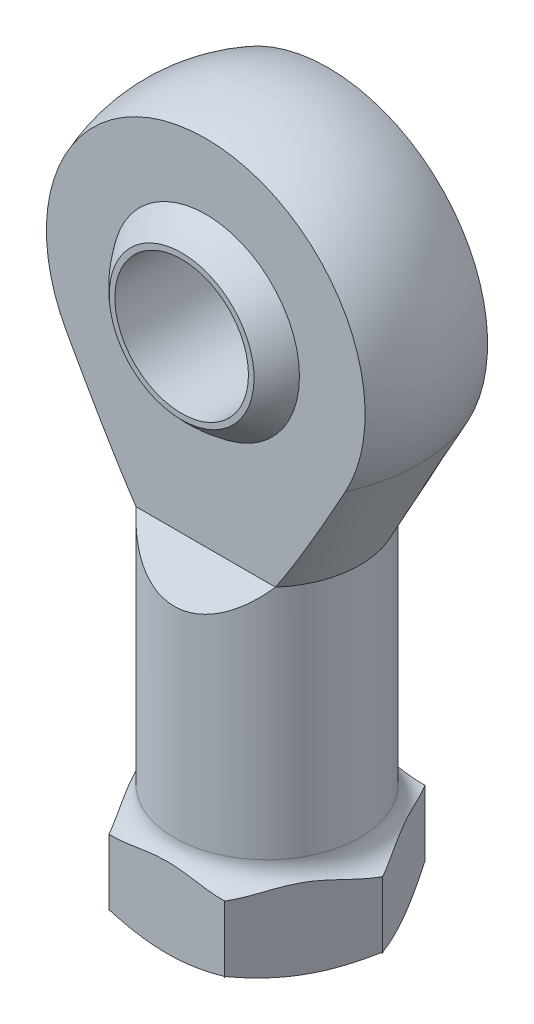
ISO-10303-21;
HEADER;
FILE_DESCRIPTION(('STEP AP214'),'2;1');
FILE_NAME('part.step','',(''),(''),'','','');
FILE_SCHEMA(('AUTOMOTIVE_DESIGN { 1 0 10303 214 1 1 1 1 }'));
ENDSEC;
DATA;
#1=APPLICATION_CONTEXT('core data for automotive mechanical design processes');
#2=APPLICATION_PROTOCOL_DEFINITION('international standard','automotive_design',2000,#1);
#3=PRODUCT_CONTEXT('',#1,'mechanical');
#4=PRODUCT('Part','Part','',(#3));
#5=PRODUCT_RELATED_PRODUCT_CATEGORY('part','',(#4));
#6=PRODUCT_DEFINITION_FORMATION('','',#4);
#7=PRODUCT_DEFINITION_CONTEXT('part definition',#1,'design');
#8=PRODUCT_DEFINITION('design','',#6,#7);
#9=PRODUCT_DEFINITION_SHAPE('','',#8);
#10=(LENGTH_UNIT() NAMED_UNIT(*) SI_UNIT(.MILLI.,.METRE.));
#11=(NAMED_UNIT(*) PLANE_ANGLE_UNIT() SI_UNIT($,.RADIAN.));
#12=(NAMED_UNIT(*) SI_UNIT($,.STERADIAN.) SOLID_ANGLE_UNIT());
#13=UNCERTAINTY_MEASURE_WITH_UNIT(LENGTH_MEASURE(1.E-05),#10,'distance_accuracy_value','');
#14=(GEOMETRIC_REPRESENTATION_CONTEXT(3) GLOBAL_UNCERTAINTY_ASSIGNED_CONTEXT((#13)) GLOBAL_UNIT_ASSIGNED_CONTEXT((#10,
#11,#12)) REPRESENTATION_CONTEXT('',''));
#15=CARTESIAN_POINT('',(0.,0.,0.));
#16=DIRECTION('',(0.,0.,1.));
#17=DIRECTION('',(1.,0.,0.));
#18=AXIS2_PLACEMENT_3D('',#15,#16,#17);
#19=CARTESIAN_POINT('',(0.,-31.,0.));
#20=DIRECTION('',(0.,-1.,0.));
#21=DIRECTION('',(1.,0.,0.));
#22=AXIS2_PLACEMENT_3D('',#19,#20,#21);
#23=CONICAL_SURFACE('',#22,6.75,1.0471975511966);
#24=CARTESIAN_POINT('',(0.,-28.4019237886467,0.));
#25=DIRECTION('',(0.,-1.,0.));
#26=DIRECTION('',(0.,0.,1.));
#27=AXIS2_PLACEMENT_3D('',#24,#25,#26);
#28=CIRCLE('',#27,2.25);
#29=CARTESIAN_POINT('',(2.25000000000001,-28.4019237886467,0.));
#30=VERTEX_POINT('',#29);
#31=EDGE_CURVE('P0_E767',#30,#30,#28,.T.);
#32=CARTESIAN_POINT('',(0.,-31.,0.));
#33=DIRECTION('',(0.,-1.,0.));
#34=DIRECTION('',(0.,0.,1.));
#35=AXIS2_PLACEMENT_3D('',#32,#33,#34);
#36=CIRCLE('',#35,6.75);
#37=CARTESIAN_POINT('',(6.75000000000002,-31.,0.));
#38=VERTEX_POINT('',#37);
#39=EDGE_CURVE('P0_E764',#38,#38,#36,.F.);
#40=CARTESIAN_POINT('',(2.25000000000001,-28.4019237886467,0.));
#41=CARTESIAN_POINT('',(2.29687500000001,-28.4289870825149,0.));
#42=CARTESIAN_POINT('',(2.34375000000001,-28.4560503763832,0.));
#43=CARTESIAN_POINT('',(2.43750000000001,-28.5101769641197,0.));
#44=CARTESIAN_POINT('',(2.48437500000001,-28.537240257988,0.));
#45=CARTESIAN_POINT('',(2.57812500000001,-28.5913668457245,0.));
#46=CARTESIAN_POINT('',(2.62500000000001,-28.6184301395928,0.));
#47=CARTESIAN_POINT('',(2.71875000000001,-28.6725567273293,0.));
#48=CARTESIAN_POINT('',(2.76562500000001,-28.6996200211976,0.));
#49=CARTESIAN_POINT('',(2.85937500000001,-28.7537466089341,0.));
#50=CARTESIAN_POINT('',(2.90625000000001,-28.7808099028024,0.));
#51=CARTESIAN_POINT('',(3.00000000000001,-28.8349364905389,0.));
#52=CARTESIAN_POINT('',(3.04687500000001,-28.8619997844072,0.));
#53=CARTESIAN_POINT('',(3.14062500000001,-28.9161263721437,0.));
#54=CARTESIAN_POINT('',(3.18750000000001,-28.943189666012,0.));
#55=CARTESIAN_POINT('',(3.28125000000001,-28.9973162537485,0.));
#56=CARTESIAN_POINT('',(3.32812500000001,-29.0243795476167,0.));
#57=CARTESIAN_POINT('',(3.42187500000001,-29.0785061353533,0.));
#58=CARTESIAN_POINT('',(3.46875000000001,-29.1055694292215,0.));
#59=CARTESIAN_POINT('',(3.56250000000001,-29.1596960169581,0.));
#60=CARTESIAN_POINT('',(3.60937500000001,-29.1867593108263,0.));
#61=CARTESIAN_POINT('',(3.70312500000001,-29.2408858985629,0.));
#62=CARTESIAN_POINT('',(3.75000000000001,-29.2679491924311,0.));
#63=CARTESIAN_POINT('',(3.84375000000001,-29.3220757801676,0.));
#64=CARTESIAN_POINT('',(3.89062500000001,-29.3491390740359,0.));
#65=CARTESIAN_POINT('',(3.98437500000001,-29.4032656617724,0.));
#66=CARTESIAN_POINT('',(4.03125000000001,-29.4303289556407,0.));
#67=CARTESIAN_POINT('',(4.12500000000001,-29.4844555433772,0.));
#68=CARTESIAN_POINT('',(4.17187500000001,-29.5115188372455,0.));
#69=CARTESIAN_POINT('',(4.26562500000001,-29.565645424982,0.));
#70=CARTESIAN_POINT('',(4.31250000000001,-29.5927087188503,0.));
#71=CARTESIAN_POINT('',(4.40625000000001,-29.6468353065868,0.));
#72=CARTESIAN_POINT('',(4.45312500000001,-29.6738986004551,0.));
#73=CARTESIAN_POINT('',(4.54687500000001,-29.7280251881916,0.));
#74=CARTESIAN_POINT('',(4.59375000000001,-29.7550884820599,0.));
#75=CARTESIAN_POINT('',(4.68750000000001,-29.8092150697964,0.));
#76=CARTESIAN_POINT('',(4.73437500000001,-29.8362783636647,0.));
#77=CARTESIAN_POINT('',(4.82812500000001,-29.8904049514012,0.));
#78=CARTESIAN_POINT('',(4.87500000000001,-29.9174682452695,0.));
#79=CARTESIAN_POINT('',(4.96875000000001,-29.971594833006,0.));
#80=CARTESIAN_POINT('',(5.01562500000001,-29.9986581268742,0.));
#81=CARTESIAN_POINT('',(5.10937500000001,-30.0527847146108,0.));
#82=CARTESIAN_POINT('',(5.15625000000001,-30.079848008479,0.));
#83=CARTESIAN_POINT('',(5.25000000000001,-30.1339745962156,0.));
#84=CARTESIAN_POINT('',(5.29687500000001,-30.1610378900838,0.));
#85=CARTESIAN_POINT('',(5.39062500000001,-30.2151644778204,0.));
#86=CARTESIAN_POINT('',(5.43750000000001,-30.2422277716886,0.));
#87=CARTESIAN_POINT('',(5.53125000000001,-30.2963543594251,0.));
#88=CARTESIAN_POINT('',(5.57812500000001,-30.3234176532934,0.));
#89=CARTESIAN_POINT('',(5.67187500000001,-30.3775442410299,0.));
#90=CARTESIAN_POINT('',(5.71875000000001,-30.4046075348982,0.));
#91=CARTESIAN_POINT('',(5.81250000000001,-30.4587341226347,0.));
#92=CARTESIAN_POINT('',(5.85937500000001,-30.485797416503,0.));
#93=CARTESIAN_POINT('',(5.95312500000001,-30.5399240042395,0.));
#94=CARTESIAN_POINT('',(6.00000000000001,-30.5669872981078,0.));
#95=CARTESIAN_POINT('',(6.09375000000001,-30.6211138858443,0.));
#96=CARTESIAN_POINT('',(6.14062500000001,-30.6481771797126,0.));
#97=CARTESIAN_POINT('',(6.23437500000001,-30.7023037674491,0.));
#98=CARTESIAN_POINT('',(6.28125000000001,-30.7293670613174,0.));
#99=CARTESIAN_POINT('',(6.37500000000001,-30.7834936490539,0.));
#100=CARTESIAN_POINT('',(6.42187500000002,-30.8105569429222,0.));
#101=CARTESIAN_POINT('',(6.51562500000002,-30.8646835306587,0.));
#102=CARTESIAN_POINT('',(6.56250000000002,-30.8917468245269,0.));
#103=CARTESIAN_POINT('',(6.65625000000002,-30.9458734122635,0.));
#104=CARTESIAN_POINT('',(6.70312500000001,-30.9729367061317,0.));
#105=CARTESIAN_POINT('',(6.75000000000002,-31.,0.));
#106=B_SPLINE_CURVE_WITH_KNOTS('',3,(#40,#41,#42,#43,#44,#45,#46,#47,#48,#49,#50,#51,#52,#53,
#54,#55,#56,#57,#58,#59,#60,#61,#62,#63,#64,#65,#66,#67,#68,#69,#70,#71,#72,#73,#74,#75,#76,#77,
#78,#79,#80,#81,#82,#83,#84,#85,#86,#87,#88,#89,#90,#91,#92,#93,#94,#95,#96,#97,#98,#99,#100,
#101,#102,#103,#104,#105),.UNSPECIFIED.,.F.,.F.,(4,2,2,2,2,2,2,2,2,2,2,2,2,2,2,2,2,2,2,2,2,2,2,
2,2,2,2,2,2,2,2,2,4),(0.,0.162379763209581,0.324759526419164,0.487139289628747,0.64951905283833,
0.811898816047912,0.974278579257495,1.13665834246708,1.29903810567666,1.46141786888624,
1.62379763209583,1.78617739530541,1.94855715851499,2.11093692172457,2.27331668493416,
2.43569644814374,2.59807621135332,2.7604559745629,2.92283573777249,3.08521550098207,
3.24759526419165,3.40997502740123,3.57235479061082,3.7347345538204,3.89711431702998,
4.05949408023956,4.22187384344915,4.38425360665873,4.54663336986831,4.70901313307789,
4.87139289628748,5.03377265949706,5.19615242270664),.UNSPECIFIED.);
#107=EDGE_CURVE('P0_BSEAM16',#30,#38,#106,.T.);
#108=ORIENTED_EDGE('',*,*,#31,.F.);
#109=ORIENTED_EDGE('',*,*,#39,.F.);
#110=ORIENTED_EDGE('',*,*,#107,.T.);
#111=ORIENTED_EDGE('',*,*,#107,.F.);
#112=EDGE_LOOP('',(#108,#110,#109,#111));
#113=FACE_BOUND('',#112,.T.);
#114=ADVANCED_FACE('P0_F16',(#113),#23,.F.);
#115=CARTESIAN_POINT('',(0.,-31.,0.));
#116=DIRECTION('',(0.,-1.,0.));
#117=DIRECTION('',(0.,0.,-1.));
#118=AXIS2_PLACEMENT_3D('',#115,#116,#117);
#119=CYLINDRICAL_SURFACE('',#118,6.75);
#120=CARTESIAN_POINT('',(0.,-71.,0.));
#121=DIRECTION('',(0.,-1.,0.));
#122=DIRECTION('',(0.,0.,-1.));
#123=AXIS2_PLACEMENT_3D('',#120,#121,#122);
#124=CIRCLE('',#123,6.75);
#125=CARTESIAN_POINT('',(0.,-71.,-6.75));
#126=VERTEX_POINT('',#125);
#127=EDGE_CURVE('P0_E165',#126,#126,#124,.F.);
#128=ORIENTED_EDGE('',*,*,#127,.F.);
#129=EDGE_LOOP('',(#128));
#130=FACE_BOUND('',#129,.T.);
#131=ORIENTED_EDGE('',*,*,#39,.T.);
#132=EDGE_LOOP('',(#131));
#133=FACE_BOUND('',#132,.T.);
#134=ADVANCED_FACE('P0_F908',(#130,#133),#119,.F.);
#135=CARTESIAN_POINT('',(0.,-14.9124646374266,0.));
#136=DIRECTION('',(0.,-1.,0.));
#137=DIRECTION('',(1.,0.,0.));
#138=AXIS2_PLACEMENT_3D('',#135,#136,#137);
#139=CYLINDRICAL_SURFACE('',#138,2.25);
#140=CARTESIAN_POINT('',(0.,-14.9124646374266,0.));
#141=DIRECTION('',(0.,-1.,0.));
#142=DIRECTION('',(1.,0.,0.));
#143=AXIS2_PLACEMENT_3D('',#140,#141,#142);
#144=CIRCLE('',#143,2.25);
#145=CARTESIAN_POINT('',(2.25,-14.9124646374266,0.));
#146=VERTEX_POINT('',#145);
#147=EDGE_CURVE('P0_E177',#146,#146,#144,.T.);
#148=ORIENTED_EDGE('',*,*,#147,.F.);
#149=EDGE_LOOP('',(#148));
#150=FACE_BOUND('',#149,.T.);
#151=ORIENTED_EDGE('',*,*,#31,.T.);
#152=EDGE_LOOP('',(#151));
#153=FACE_BOUND('',#152,.T.);
#154=ADVANCED_FACE('P0_F214',(#150,#153),#139,.F.);
#155=CARTESIAN_POINT('',(0.,-71.,0.));
#156=DIRECTION('',(0.,1.,0.));
#157=DIRECTION('',(0.,0.,1.));
#158=AXIS2_PLACEMENT_3D('',#155,#156,#157);
#159=CONICAL_SURFACE('',#158,13.5,1.0471975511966);
#160=CARTESIAN_POINT('',(15.4992296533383,-69.845299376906,-0.154546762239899));
#161=CARTESIAN_POINT('',(15.188904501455,-70.0213533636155,-0.692045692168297));
#162=CARTESIAN_POINT('',(14.876349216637,-70.1823831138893,-1.23340732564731));
#163=CARTESIAN_POINT('',(14.4051168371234,-70.395315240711,-2.0496057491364));
#164=CARTESIAN_POINT('',(14.2480161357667,-70.4614003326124,-2.32171214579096));
#165=CARTESIAN_POINT('',(13.9328193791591,-70.5832871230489,-2.86764894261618));
#166=CARTESIAN_POINT('',(13.7747233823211,-70.639089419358,-3.14147924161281));
#167=CARTESIAN_POINT('',(13.4574637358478,-70.7395494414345,-3.69098906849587));
#168=CARTESIAN_POINT('',(13.2982990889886,-70.7841946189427,-3.96667032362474));
#169=CARTESIAN_POINT('',(12.9792398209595,-70.8614409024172,-4.51929718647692));
#170=CARTESIAN_POINT('',(12.8193452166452,-70.8940422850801,-4.79624276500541));
#171=CARTESIAN_POINT('',(12.4982532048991,-70.9466580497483,-5.35239044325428));
#172=CARTESIAN_POINT('',(12.3370532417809,-70.9666105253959,-5.6315969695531));
#173=CARTESIAN_POINT('',(12.0143522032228,-70.9933079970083,-6.19053156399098));
#174=CARTESIAN_POINT('',(11.8528510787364,-71.0000506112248,-6.47025971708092));
#175=CARTESIAN_POINT('',(11.6913429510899,-71.,-6.75));
#176=B_SPLINE_CURVE_WITH_KNOTS('',3,(#160,#161,#162,#163,#164,#165,#166,#167,#168,#169,#170,
#171,#172,#173,#174,#175),.UNSPECIFIED.,.F.,.F.,(4,2,2,2,2,2,2,4),(0.,1.93534233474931,
2.89844067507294,3.86148300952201,4.82560363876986,5.78970211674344,6.75848338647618,
7.7274393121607),.UNSPECIFIED.);
#177=CARTESIAN_POINT('',(15.4992295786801,-69.8452994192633,-0.154546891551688));
#178=VERTEX_POINT('',#177);
#179=CARTESIAN_POINT('',(11.6913429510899,-71.,-6.75));
#180=VERTEX_POINT('',#179);
#181=EDGE_CURVE('P0_E159',#178,#180,#176,.T.);
#182=ORIENTED_EDGE('',*,*,#181,.F.);
#183=CARTESIAN_POINT('',(0.,-69.8452994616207,0.));
#184=DIRECTION('',(0.,1.,0.));
#185=DIRECTION('',(0.,0.,1.));
#186=AXIS2_PLACEMENT_3D('',#183,#184,#185);
#187=CIRCLE('',#186,15.5);
#188=CARTESIAN_POINT('',(15.4992294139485,-69.8452994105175,0.154547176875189));
#189=VERTEX_POINT('',#188);
#190=EDGE_CURVE('P0_E166',#189,#178,#187,.T.);
#191=ORIENTED_EDGE('',*,*,#190,.F.);
#192=CARTESIAN_POINT('',(11.6913429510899,-71.,6.74999999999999));
#193=CARTESIAN_POINT('',(11.852851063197,-71.0000506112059,6.47025974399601));
#194=CARTESIAN_POINT('',(12.0143521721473,-70.9933079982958,6.19053161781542));
#195=CARTESIAN_POINT('',(12.3370531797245,-70.9666105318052,5.63159707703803));
#196=CARTESIAN_POINT('',(12.4982531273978,-70.9466580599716,5.35239057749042));
#197=CARTESIAN_POINT('',(12.8193451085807,-70.8940423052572,4.7962429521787));
#198=CARTESIAN_POINT('',(12.9792396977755,-70.8614409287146,4.51929739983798));
#199=CARTESIAN_POINT('',(13.2982989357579,-70.7841946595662,3.96667058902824));
#200=CARTESIAN_POINT('',(13.4574635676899,-70.7395494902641,3.69098935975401));
#201=CARTESIAN_POINT('',(13.7747231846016,-70.6390894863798,3.14147958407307));
#202=CARTESIAN_POINT('',(13.9328191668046,-70.5832872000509,2.86764931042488));
#203=CARTESIAN_POINT('',(14.2480158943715,-70.4614004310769,2.32171256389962));
#204=CARTESIAN_POINT('',(14.4051165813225,-70.3953153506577,2.04960619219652));
#205=CARTESIAN_POINT('',(14.876348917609,-70.1823832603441,1.23340784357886));
#206=CARTESIAN_POINT('',(15.1889041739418,-70.0213535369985,0.692046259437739));
#207=CARTESIAN_POINT('',(15.4992292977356,-69.8452995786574,0.154547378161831));
#208=B_SPLINE_CURVE_WITH_KNOTS('',3,(#192,#193,#194,#195,#196,#197,#198,#199,#200,#201,#202,
#203,#204,#205,#206,#207),.UNSPECIFIED.,.F.,.F.,(4,2,2,2,2,2,2,4),(0.,0.96895583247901,
1.93773700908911,2.90183539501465,3.86595593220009,4.82899817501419,5.79209642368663,
7.72743857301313),.UNSPECIFIED.);
#209=CARTESIAN_POINT('',(11.6913429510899,-71.,6.75));
#210=VERTEX_POINT('',#209);
#211=EDGE_CURVE('P0_E162',#210,#189,#208,.T.);
#212=ORIENTED_EDGE('',*,*,#211,.F.);
#213=CARTESIAN_POINT('',(0.,-71.,0.));
#214=DIRECTION('',(0.,1.,0.));
#215=DIRECTION('',(0.,0.,1.));
#216=AXIS2_PLACEMENT_3D('',#213,#214,#215);
#217=CIRCLE('',#216,13.5);
#218=EDGE_CURVE('P0_E19',#180,#210,#217,.F.);
#219=ORIENTED_EDGE('',*,*,#218,.F.);
#220=EDGE_LOOP('',(#182,#191,#212,#219));
#221=FACE_BOUND('',#220,.T.);
#222=ADVANCED_FACE('P0_F157',(#221),#159,.T.);
#223=CARTESIAN_POINT('',(0.,-69.8966767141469,0.));
#224=DIRECTION('',(0.,-1.,0.));
#225=DIRECTION('',(0.,0.,-1.));
#226=AXIS2_PLACEMENT_3D('',#223,#224,#225);
#227=CONICAL_SURFACE('',#226,15.5889880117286,1.04719755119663);
#228=ORIENTED_EDGE('',*,*,#190,.T.);
#229=CARTESIAN_POINT('',(15.5884572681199,-69.8963702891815,0.));
#230=CARTESIAN_POINT('',(15.5735958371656,-69.8877897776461,-0.0257407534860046));
#231=CARTESIAN_POINT('',(15.5587294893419,-69.8792436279,-0.0514900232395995));
#232=CARTESIAN_POINT('',(15.5289869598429,-69.8622200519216,-0.103005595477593));
#233=CARTESIAN_POINT('',(15.5141107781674,-69.8537426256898,-0.128771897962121));
#234=CARTESIAN_POINT('',(15.4992296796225,-69.8452995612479,-0.154546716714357));
#235=B_SPLINE_CURVE_WITH_KNOTS('',3,(#229,#230,#231,#232,#233,#234),.UNSPECIFIED.,.F.,.F.,(4,2,
4),(0.,0.092809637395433,0.185619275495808),.UNSPECIFIED.);
#236=CARTESIAN_POINT('',(15.5884572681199,-69.8963702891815,0.));
#237=VERTEX_POINT('',#236);
#238=EDGE_CURVE('P0_E190',#237,#178,#235,.T.);
#239=ORIENTED_EDGE('',*,*,#238,.F.);
#240=CARTESIAN_POINT('',(15.4992292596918,-69.8452994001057,0.154547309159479));
#241=CARTESIAN_POINT('',(15.5141104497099,-69.8537424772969,0.128772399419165));
#242=CARTESIAN_POINT('',(15.5289867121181,-69.862219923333,0.103006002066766));
#243=CARTESIAN_POINT('',(15.5587293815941,-69.8792435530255,0.0514902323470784));
#244=CARTESIAN_POINT('',(15.5735957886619,-69.8877897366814,0.0257408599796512));
#245=CARTESIAN_POINT('',(15.5884572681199,-69.8963702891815,0.));
#246=B_SPLINE_CURVE_WITH_KNOTS('',3,(#240,#241,#242,#243,#244,#245),.UNSPECIFIED.,.F.,.F.,(4,2,
4),(0.,0.0928100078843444,0.185620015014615),.UNSPECIFIED.);
#247=EDGE_CURVE('P0_E225',#189,#237,#246,.T.);
#248=ORIENTED_EDGE('',*,*,#247,.F.);
#249=EDGE_LOOP('',(#228,#239,#248));
#250=FACE_BOUND('',#249,.T.);
#251=ADVANCED_FACE('P0_F213',(#250),#227,.F.);
#252=CARTESIAN_POINT('',(13.6620033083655,-71.,-13.5));
#253=DIRECTION('',(0.,-1.,0.));
#254=DIRECTION('',(0.,0.,1.));
#255=AXIS2_PLACEMENT_3D('',#252,#253,#254);
#256=PLANE('',#255);
#257=ORIENTED_EDGE('',*,*,#127,.T.);
#258=EDGE_LOOP('',(#257));
#259=FACE_BOUND('',#258,.T.);
#260=ORIENTED_EDGE('',*,*,#218,.T.);
#261=CARTESIAN_POINT('',(0.,-71.,0.));
#262=DIRECTION('',(0.,1.,0.));
#263=DIRECTION('',(-1.,0.,0.));
#264=AXIS2_PLACEMENT_3D('',#261,#262,#263);
#265=CIRCLE('',#264,13.5);
#266=CARTESIAN_POINT('',(0.,-71.,13.5));
#267=VERTEX_POINT('',#266);
#268=EDGE_CURVE('P0_E268',#267,#210,#265,.T.);
#269=ORIENTED_EDGE('',*,*,#268,.F.);
#270=CARTESIAN_POINT('',(0.,-71.,0.));
#271=DIRECTION('',(0.,1.,0.));
#272=DIRECTION('',(-1.,0.,0.));
#273=AXIS2_PLACEMENT_3D('',#270,#271,#272);
#274=CIRCLE('',#273,13.5);
#275=CARTESIAN_POINT('',(-11.6913429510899,-71.,6.75));
#276=VERTEX_POINT('',#275);
#277=EDGE_CURVE('P0_E494',#276,#267,#274,.T.);
#278=ORIENTED_EDGE('',*,*,#277,.F.);
#279=CARTESIAN_POINT('',(0.,-71.,0.));
#280=DIRECTION('',(0.,1.,0.));
#281=DIRECTION('',(0.,0.,1.));
#282=AXIS2_PLACEMENT_3D('',#279,#280,#281);
#283=CIRCLE('',#282,13.5);
#284=CARTESIAN_POINT('',(-11.6913429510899,-71.,-6.75));
#285=VERTEX_POINT('',#284);
#286=EDGE_CURVE('P0_E532',#285,#276,#283,.T.);
#287=ORIENTED_EDGE('',*,*,#286,.F.);
#288=CARTESIAN_POINT('',(0.,-71.,0.));
#289=DIRECTION('',(0.,1.,0.));
#290=DIRECTION('',(-1.,0.,0.));
#291=AXIS2_PLACEMENT_3D('',#288,#289,#290);
#292=CIRCLE('',#291,13.5);
#293=CARTESIAN_POINT('',(0.,-71.,-13.5));
#294=VERTEX_POINT('',#293);
#295=EDGE_CURVE('P0_E172',#294,#285,#292,.T.);
#296=ORIENTED_EDGE('',*,*,#295,.F.);
#297=CARTESIAN_POINT('',(0.,-71.,0.));
#298=DIRECTION('',(0.,1.,0.));
#299=DIRECTION('',(-1.,0.,0.));
#300=AXIS2_PLACEMENT_3D('',#297,#298,#299);
#301=CIRCLE('',#300,13.5);
#302=EDGE_CURVE('P0_E168',#180,#294,#301,.T.);
#303=ORIENTED_EDGE('',*,*,#302,.F.);
#304=EDGE_LOOP('',(#260,#269,#278,#287,#296,#303));
#305=FACE_BOUND('',#304,.T.);
#306=ADVANCED_FACE('P0_F170',(#259,#305),#256,.T.);
#307=CARTESIAN_POINT('',(0.,0.,0.));
#308=DIRECTION('',(0.,0.,1.));
#309=DIRECTION('',(-1.,0.,0.));
#310=AXIS2_PLACEMENT_3D('',#307,#308,#309);
#311=SPHERICAL_SURFACE('',#310,15.08125);
#312=CARTESIAN_POINT('',(0.,0.,-8.25));
#313=DIRECTION('',(0.,0.,1.));
#314=DIRECTION('',(1.,0.,0.));
#315=AXIS2_PLACEMENT_3D('',#312,#313,#314);
#316=CIRCLE('',#315,12.6246426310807);
#317=CARTESIAN_POINT('',(12.6246426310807,0.,-8.25));
#318=VERTEX_POINT('',#317);
#319=EDGE_CURVE('P0_E470',#318,#318,#316,.T.);
#320=ORIENTED_EDGE('',*,*,#319,.F.);
#321=EDGE_LOOP('',(#320));
#322=FACE_BOUND('',#321,.T.);
#323=CARTESIAN_POINT('',(0.,0.,8.25));
#324=DIRECTION('',(0.,0.,1.));
#325=DIRECTION('',(1.,0.,0.));
#326=AXIS2_PLACEMENT_3D('',#323,#324,#325);
#327=CIRCLE('',#326,12.6246426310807);
#328=CARTESIAN_POINT('',(12.6246426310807,0.,8.25));
#329=VERTEX_POINT('',#328);
#330=EDGE_CURVE('P0_E269',#329,#329,#327,.F.);
#331=ORIENTED_EDGE('',*,*,#330,.F.);
#332=EDGE_LOOP('',(#331));
#333=FACE_BOUND('',#332,.T.);
#334=ORIENTED_EDGE('',*,*,#147,.T.);
#335=EDGE_LOOP('',(#334));
#336=FACE_BOUND('',#335,.T.);
#337=ADVANCED_FACE('P0_F573',(#322,#333,#336),#311,.F.);
#338=CARTESIAN_POINT('',(15.5889926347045,-61.,0.15454702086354));
#339=DIRECTION('',(0.,1.,0.));
#340=DIRECTION('',(0.,0.,-1.));
#341=AXIS2_PLACEMENT_3D('',#338,#339,#340);
#342=PLANE('',#341);
#343=DIRECTION('',(0.499999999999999,0.,0.866025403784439));
#344=VECTOR('',#343,1.);
#345=CARTESIAN_POINT('',(11.6913429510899,-61.,-6.74999999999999));
#346=LINE('',#345,#344);
#347=CARTESIAN_POINT('',(15.4992295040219,-61.,-0.154547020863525));
#348=VERTEX_POINT('',#347);
#349=CARTESIAN_POINT('',(15.5884572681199,-61.,0.));
#350=VERTEX_POINT('',#349);
#351=EDGE_CURVE('P0_E540',#348,#350,#346,.T.);
#352=ORIENTED_EDGE('',*,*,#351,.F.);
#353=DIRECTION('',(0.,0.,-1.));
#354=VECTOR('',#353,1.);
#355=CARTESIAN_POINT('',(15.4992295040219,-61.,0.15454702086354));
#356=LINE('',#355,#354);
#357=CARTESIAN_POINT('',(15.4992295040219,-61.,0.15454702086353));
#358=VERTEX_POINT('',#357);
#359=EDGE_CURVE('P0_E731',#358,#348,#356,.T.);
#360=ORIENTED_EDGE('',*,*,#359,.F.);
#361=DIRECTION('',(-0.5,0.,0.866025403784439));
#362=VECTOR('',#361,1.);
#363=CARTESIAN_POINT('',(11.6913429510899,-61.,6.75));
#364=LINE('',#363,#362);
#365=EDGE_CURVE('P0_E564',#350,#358,#364,.T.);
#366=ORIENTED_EDGE('',*,*,#365,.F.);
#367=EDGE_LOOP('',(#352,#360,#366));
#368=FACE_BOUND('',#367,.T.);
#369=ADVANCED_FACE('P0_F576',(#368),#342,.T.);
#370=CARTESIAN_POINT('',(0.,-69.8966767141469,0.));
#371=DIRECTION('',(0.,-1.,0.));
#372=DIRECTION('',(0.,0.,-1.));
#373=AXIS2_PLACEMENT_3D('',#370,#371,#372);
#374=CONICAL_SURFACE('',#373,15.5889880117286,1.04719755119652);
#375=CARTESIAN_POINT('',(0.,-69.8452994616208,0.));
#376=DIRECTION('',(0.,-1.,0.));
#377=DIRECTION('',(0.,0.,1.));
#378=AXIS2_PLACEMENT_3D('',#375,#376,#377);
#379=CIRCLE('',#378,15.5);
#380=CARTESIAN_POINT('',(7.61577321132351,-69.8452994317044,-13.5));
#381=VERTEX_POINT('',#380);
#382=CARTESIAN_POINT('',(7.88345643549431,-69.845299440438,-13.345452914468));
#383=VERTEX_POINT('',#382);
#384=EDGE_CURVE('P0_E176',#381,#383,#379,.T.);
#385=ORIENTED_EDGE('',*,*,#384,.F.);
#386=CARTESIAN_POINT('',(7.79422863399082,-69.8963702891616,-13.5));
#387=CARTESIAN_POINT('',(7.76450575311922,-69.8877897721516,-13.5));
#388=CARTESIAN_POINT('',(7.7347730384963,-69.8792436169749,-13.5));
#389=CARTESIAN_POINT('',(7.67528794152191,-69.8622200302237,-13.5));
#390=CARTESIAN_POINT('',(7.64553555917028,-69.8537425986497,-13.5));
#391=CARTESIAN_POINT('',(7.61577334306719,-69.8452995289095,-13.5));
#392=B_SPLINE_CURVE_WITH_KNOTS('',3,(#386,#387,#388,#389,#390,#391),.UNSPECIFIED.,.F.,.F.,(4,2,
4),(0.,0.0928096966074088,0.185619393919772),.UNSPECIFIED.);
#393=CARTESIAN_POINT('',(7.79422863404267,-69.8963702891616,-13.4999999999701));
#394=VERTEX_POINT('',#393);
#395=EDGE_CURVE('P0_E797',#394,#381,#392,.T.);
#396=ORIENTED_EDGE('',*,*,#395,.F.);
#397=CARTESIAN_POINT('',(7.88345643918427,-69.8452994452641,-13.3454528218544));
#398=CARTESIAN_POINT('',(7.86857531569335,-69.8537425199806,-13.3712277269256));
#399=CARTESIAN_POINT('',(7.85369910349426,-69.8622199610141,-13.3969941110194));
#400=CARTESIAN_POINT('',(7.82395650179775,-69.8792435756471,-13.4485098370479));
#401=CARTESIAN_POINT('',(7.80909011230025,-69.8877897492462,-13.4742591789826));
#402=CARTESIAN_POINT('',(7.79422863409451,-69.8963702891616,-13.4999999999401));
#403=B_SPLINE_CURVE_WITH_KNOTS('',3,(#397,#398,#399,#400,#401,#402),.UNSPECIFIED.,.F.,.F.,(4,2,
4),(0.,0.0928098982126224,0.185619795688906),.UNSPECIFIED.);
#404=EDGE_CURVE('P0_E185',#383,#394,#403,.T.);
#405=ORIENTED_EDGE('',*,*,#404,.F.);
#406=EDGE_LOOP('',(#385,#396,#405));
#407=FACE_BOUND('',#406,.T.);
#408=ADVANCED_FACE('P0_F791',(#407),#374,.F.);
#409=CARTESIAN_POINT('',(0.,-71.,0.));
#410=DIRECTION('',(0.,1.,0.));
#411=DIRECTION('',(-1.,0.,0.));
#412=AXIS2_PLACEMENT_3D('',#409,#410,#411);
#413=CONICAL_SURFACE('',#412,13.5,1.0471975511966);
#414=CARTESIAN_POINT('',(7.61577332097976,-69.8452994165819,-13.5000000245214));
#415=CARTESIAN_POINT('',(6.99512302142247,-70.0213533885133,-13.5000000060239));
#416=CARTESIAN_POINT('',(6.37001245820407,-70.182383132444,-13.5000000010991));
#417=CARTESIAN_POINT('',(5.42754770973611,-70.3953152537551,-13.499999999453));
#418=CARTESIAN_POINT('',(5.11334631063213,-70.4614003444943,-13.4999999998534));
#419=CARTESIAN_POINT('',(4.48295280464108,-70.5832871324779,-13.5000000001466));
#420=CARTESIAN_POINT('',(4.16676081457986,-70.6390894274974,-13.5000000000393));
#421=CARTESIAN_POINT('',(3.53224152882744,-70.7395494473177,-13.4999999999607));
#422=CARTESIAN_POINT('',(3.21391223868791,-70.7841946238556,-13.4999999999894));
#423=CARTESIAN_POINT('',(2.57579370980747,-70.8614409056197,-13.5000000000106));
#424=CARTESIAN_POINT('',(2.25600450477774,-70.8940422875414,-13.500000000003));
#425=CARTESIAN_POINT('',(1.61382048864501,-70.9466580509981,-13.499999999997));
#426=CARTESIAN_POINT('',(1.29142056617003,-70.9666105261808,-13.4999999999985));
#427=CARTESIAN_POINT('',(0.646018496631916,-70.9933079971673,-13.5000000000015));
#428=CARTESIAN_POINT('',(0.32301625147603,-71.0000506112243,-13.5000000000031));
#429=CARTESIAN_POINT('',(0.,-71.,-13.5));
#430=B_SPLINE_CURVE_WITH_KNOTS('',3,(#414,#415,#416,#417,#418,#419,#420,#421,#422,#423,#424,
#425,#426,#427,#428,#429),.UNSPECIFIED.,.F.,.F.,(4,2,2,2,2,2,2,4),(0.,1.9353423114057,
2.89844064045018,3.86148296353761,4.82560358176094,5.78970204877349,6.75848330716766,
7.72743922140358),.UNSPECIFIED.);
#431=EDGE_CURVE('P0_E664',#381,#294,#430,.T.);
#432=ORIENTED_EDGE('',*,*,#431,.F.);
#433=ORIENTED_EDGE('',*,*,#384,.T.);
#434=CARTESIAN_POINT('',(11.6913429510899,-71.,-6.75));
#435=CARTESIAN_POINT('',(11.5298348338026,-71.0000506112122,-7.02974026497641));
#436=CARTESIAN_POINT('',(11.3683337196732,-70.9933079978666,-7.30946840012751));
#437=CARTESIAN_POINT('',(11.0456327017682,-70.9666105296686,-7.86840295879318));
#438=CARTESIAN_POINT('',(10.8844327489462,-70.9466580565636,-8.14760946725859));
#439=CARTESIAN_POINT('',(10.5633407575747,-70.8940422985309,-8.70375711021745));
#440=CARTESIAN_POINT('',(10.4034461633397,-70.8614409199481,-8.98070267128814));
#441=CARTESIAN_POINT('',(10.0843869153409,-70.7841946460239,-9.53332949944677));
#442=CARTESIAN_POINT('',(9.92522227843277,-70.7395494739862,-9.80901073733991));
#443=CARTESIAN_POINT('',(9.6079626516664,-70.6390894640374,-10.3585205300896));
#444=CARTESIAN_POINT('',(9.44986666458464,-70.5832871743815,-10.632350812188));
#445=CARTESIAN_POINT('',(9.13466992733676,-70.4614003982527,-11.1782875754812));
#446=CARTESIAN_POINT('',(8.97756923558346,-70.3953153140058,-11.4503939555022));
#447=CARTESIAN_POINT('',(8.50633688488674,-70.1823832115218,-12.266592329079));
#448=CARTESIAN_POINT('',(8.19378161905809,-70.0213534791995,-12.8079539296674));
#449=CARTESIAN_POINT('',(7.8834564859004,-69.8452995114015,-13.3454528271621));
#450=B_SPLINE_CURVE_WITH_KNOTS('',3,(#434,#435,#436,#437,#438,#439,#440,#441,#442,#443,#444,
#445,#446,#447,#448,#449),.UNSPECIFIED.,.F.,.F.,(4,2,2,2,2,2,2,4),(0.,0.968955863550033,
1.93773707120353,2.90183548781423,3.86595605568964,4.8289983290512,5.79209660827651,
7.72743881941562),.UNSPECIFIED.);
#451=EDGE_CURVE('P0_E180',#180,#383,#450,.T.);
#452=ORIENTED_EDGE('',*,*,#451,.F.);
#453=ORIENTED_EDGE('',*,*,#302,.T.);
#454=EDGE_LOOP('',(#432,#433,#452,#453));
#455=FACE_BOUND('',#454,.T.);
#456=ADVANCED_FACE('P0_F181',(#455),#413,.T.);
#457=CARTESIAN_POINT('',(7.88506224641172,-61.,-13.3454529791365));
#458=DIRECTION('',(0.,1.,0.));
#459=DIRECTION('',(0.,0.,-1.));
#460=AXIS2_PLACEMENT_3D('',#457,#458,#459);
#461=PLANE('',#460);
#462=DIRECTION('',(1.,0.,0.));
#463=VECTOR('',#462,1.);
#464=CARTESIAN_POINT('',(0.,-61.,-13.5));
#465=LINE('',#464,#463);
#466=CARTESIAN_POINT('',(7.61577310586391,-61.,-13.5));
#467=VERTEX_POINT('',#466);
#468=CARTESIAN_POINT('',(7.79422863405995,-61.,-13.5));
#469=VERTEX_POINT('',#468);
#470=EDGE_CURVE('P0_E546',#467,#469,#465,.T.);
#471=ORIENTED_EDGE('',*,*,#470,.F.);
#472=DIRECTION('',(0.866025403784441,0.,0.499999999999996));
#473=VECTOR('',#472,1.);
#474=CARTESIAN_POINT('',(7.6157731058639,-61.,-13.5));
#475=LINE('',#474,#473);
#476=CARTESIAN_POINT('',(7.88345639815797,-61.,-13.3454529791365));
#477=VERTEX_POINT('',#476);
#478=EDGE_CURVE('P0_E803',#477,#467,#475,.F.);
#479=ORIENTED_EDGE('',*,*,#478,.F.);
#480=DIRECTION('',(0.499999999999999,0.,0.866025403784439));
#481=VECTOR('',#480,1.);
#482=CARTESIAN_POINT('',(11.6913429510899,-61.,-6.74999999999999));
#483=LINE('',#482,#481);
#484=EDGE_CURVE('P0_E558',#469,#477,#483,.T.);
#485=ORIENTED_EDGE('',*,*,#484,.F.);
#486=EDGE_LOOP('',(#471,#479,#485));
#487=FACE_BOUND('',#486,.T.);
#488=ADVANCED_FACE('P0_F819',(#487),#461,.T.);
#489=CARTESIAN_POINT('',(15.5884572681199,-71.0645836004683,0.));
#490=DIRECTION('',(0.866025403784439,0.,-0.499999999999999));
#491=DIRECTION('',(-0.499999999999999,0.,-0.866025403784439));
#492=AXIS2_PLACEMENT_3D('',#489,#490,#491);
#493=PLANE('',#492);
#494=ORIENTED_EDGE('',*,*,#351,.T.);
#495=DIRECTION('',(0.,1.,0.));
#496=VECTOR('',#495,1.);
#497=CARTESIAN_POINT('',(15.5884572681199,-71.,0.));
#498=LINE('',#497,#496);
#499=EDGE_CURVE('P0_E566',#237,#350,#498,.T.);
#500=ORIENTED_EDGE('',*,*,#499,.F.);
#501=ORIENTED_EDGE('',*,*,#238,.T.);
#502=ORIENTED_EDGE('',*,*,#181,.T.);
#503=ORIENTED_EDGE('',*,*,#451,.T.);
#504=ORIENTED_EDGE('',*,*,#404,.T.);
#505=DIRECTION('',(0.,1.,0.));
#506=VECTOR('',#505,1.);
#507=CARTESIAN_POINT('',(7.79422863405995,-71.,-13.5));
#508=LINE('',#507,#506);
#509=EDGE_CURVE('P0_E429',#469,#394,#508,.F.);
#510=ORIENTED_EDGE('',*,*,#509,.F.);
#511=ORIENTED_EDGE('',*,*,#484,.T.);
#512=CARTESIAN_POINT('',(15.4992295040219,-61.,-0.154547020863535));
#513=CARTESIAN_POINT('',(15.4147805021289,-60.9999888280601,-0.300816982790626));
#514=CARTESIAN_POINT('',(15.3303503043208,-60.9965575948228,-0.447054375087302));
#515=CARTESIAN_POINT('',(15.161847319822,-60.9838286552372,-0.738910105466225));
#516=CARTESIAN_POINT('',(15.0777742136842,-60.9745482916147,-0.884528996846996));
#517=CARTESIAN_POINT('',(14.9099350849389,-60.9511014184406,-1.17523489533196));
#518=CARTESIAN_POINT('',(14.8261687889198,-60.9369424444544,-1.32032237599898));
#519=CARTESIAN_POINT('',(14.6588833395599,-60.9046292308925,-1.61006927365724));
#520=CARTESIAN_POINT('',(14.5753640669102,-60.8864774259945,-1.75472889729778));
#521=CARTESIAN_POINT('',(14.4085180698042,-60.8470375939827,-2.04371464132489));
#522=CARTESIAN_POINT('',(14.3251913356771,-60.8257497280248,-2.18804077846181));
#523=CARTESIAN_POINT('',(14.1586754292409,-60.7808867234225,-2.47645478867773));
#524=CARTESIAN_POINT('',(14.0754862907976,-60.7573110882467,-2.62054260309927));
#525=CARTESIAN_POINT('',(13.9094782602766,-60.7088174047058,-2.90807694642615));
#526=CARTESIAN_POINT('',(13.8266590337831,-60.6839038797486,-3.0515240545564));
#527=CARTESIAN_POINT('',(13.6610488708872,-60.6335379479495,-3.33836927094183));
#528=CARTESIAN_POINT('',(13.5782579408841,-60.6080854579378,-3.48176736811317));
#529=CARTESIAN_POINT('',(13.4126473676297,-60.5575508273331,-3.76861329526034));
#530=CARTESIAN_POINT('',(13.3298277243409,-60.5324686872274,-3.91206112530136));
#531=CARTESIAN_POINT('',(13.1641005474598,-60.483613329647,-4.19910901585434));
#532=CARTESIAN_POINT('',(13.0811930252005,-60.4598399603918,-4.34270905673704));
#533=CARTESIAN_POINT('',(12.9152298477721,-60.414555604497,-4.63016571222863));
#534=CARTESIAN_POINT('',(12.8321742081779,-60.3930443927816,-4.77402229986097));
#535=CARTESIAN_POINT('',(12.665856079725,-60.3532223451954,-5.06209374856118));
#536=CARTESIAN_POINT('',(12.5825935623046,-60.3349119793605,-5.2063086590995));
#537=CARTESIAN_POINT('',(12.4133775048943,-60.3018927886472,-5.49939946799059));
#538=CARTESIAN_POINT('',(12.3274178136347,-60.2873077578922,-5.64828602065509));
#539=CARTESIAN_POINT('',(12.155307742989,-60.2632849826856,-5.94638940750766));
#540=CARTESIAN_POINT('',(12.0691573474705,-60.2538476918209,-6.09560626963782));
#541=CARTESIAN_POINT('',(11.8967666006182,-60.2406880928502,-6.39419580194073));
#542=CARTESIAN_POINT('',(11.81052627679,-60.2369643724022,-6.5435684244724));
#543=CARTESIAN_POINT('',(11.6380641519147,-60.2354593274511,-6.84228158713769));
#544=CARTESIAN_POINT('',(11.5518423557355,-60.2376758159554,-6.9916221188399));
#545=CARTESIAN_POINT('',(11.3794326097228,-60.2479113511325,-7.29024455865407));
#546=CARTESIAN_POINT('',(11.293244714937,-60.2559340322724,-7.43952637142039));
#547=CARTESIAN_POINT('',(11.1210142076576,-60.2773028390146,-7.73783836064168));
#548=CARTESIAN_POINT('',(11.0349716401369,-60.2906503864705,-7.88686845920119));
#549=CARTESIAN_POINT('',(10.8630616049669,-60.3219155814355,-8.18462537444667));
#550=CARTESIAN_POINT('',(10.777194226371,-60.3398351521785,-8.33335203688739));
#551=CARTESIAN_POINT('',(10.6056546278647,-60.3793077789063,-8.63046733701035));
#552=CARTESIAN_POINT('',(10.5199824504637,-60.4008615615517,-8.77885590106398));
#553=CARTESIAN_POINT('',(10.3494073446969,-60.4464163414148,-9.07430065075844));
#554=CARTESIAN_POINT('',(10.2645031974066,-60.47039936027,-9.22135894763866));
#555=CARTESIAN_POINT('',(10.0948299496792,-60.5199037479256,-9.51524163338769));
#556=CARTESIAN_POINT('',(10.0100608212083,-60.5454247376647,-9.66206607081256));
#557=CARTESIAN_POINT('',(9.84058667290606,-60.5969958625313,-9.95560390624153));
#558=CARTESIAN_POINT('',(9.7558816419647,-60.6230458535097,-10.1023173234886));
#559=CARTESIAN_POINT('',(9.58646725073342,-60.6746980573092,-10.3957516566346));
#560=CARTESIAN_POINT('',(9.50175790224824,-60.7003004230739,-10.542472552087));
#561=CARTESIAN_POINT('',(9.33226921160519,-60.7501162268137,-10.8360355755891));
#562=CARTESIAN_POINT('',(9.24748990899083,-60.7743301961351,-10.9828776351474));
#563=CARTESIAN_POINT('',(9.07795149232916,-60.8204154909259,-11.2765267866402));
#564=CARTESIAN_POINT('',(8.99319270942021,-60.842291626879,-11.4233333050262));
#565=CARTESIAN_POINT('',(8.82347846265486,-60.882860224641,-11.717287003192));
#566=CARTESIAN_POINT('',(8.73852299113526,-60.9015525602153,-11.864434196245));
#567=CARTESIAN_POINT('',(8.5683515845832,-60.9348559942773,-12.1591797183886));
#568=CARTESIAN_POINT('',(8.4831355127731,-60.9494643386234,-12.3067782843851));
#569=CARTESIAN_POINT('',(8.31237366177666,-60.9736741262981,-12.6025464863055));
#570=CARTESIAN_POINT('',(8.22682756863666,-60.9832670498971,-12.750716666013));
#571=CARTESIAN_POINT('',(8.05534672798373,-60.9964337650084,-13.0477301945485));
#572=CARTESIAN_POINT('',(7.96941161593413,-60.9999880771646,-13.1965741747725));
#573=CARTESIAN_POINT('',(7.88345639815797,-61.,-13.3454529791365));
#574=B_SPLINE_CURVE_WITH_KNOTS('',3,(#512,#513,#514,#515,#516,#517,#518,#519,#520,#521,#522,
#523,#524,#525,#526,#527,#528,#529,#530,#531,#532,#533,#534,#535,#536,#537,#538,#539,#540,#541,
#542,#543,#544,#545,#546,#547,#548,#549,#550,#551,#552,#553,#554,#555,#556,#557,#558,#559,#560,
#561,#562,#563,#564,#565,#566,#567,#568,#569,#570,#571,#572,#573),.UNSPECIFIED.,.F.,.F.,(4,2,2,
2,2,2,2,2,2,2,2,2,2,2,2,2,2,2,2,2,2,2,2,2,2,2,2,2,2,2,4),(0.,0.506605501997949,1.01171593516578,
1.51604963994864,2.02007666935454,2.52407780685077,3.02818857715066,3.53069082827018,
4.03327119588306,4.53585222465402,5.03837484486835,5.54084741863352,6.04339371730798,
6.56093815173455,7.07852818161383,7.595990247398,8.11326182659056,8.63085747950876,
9.14859143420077,9.6665435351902,10.1845993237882,10.6990679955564,11.2134103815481,
11.7276144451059,12.2416392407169,12.7554659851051,13.26821421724,13.780982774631,
14.2940963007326,14.8080786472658,15.323715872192),.UNSPECIFIED.);
#575=EDGE_CURVE('P0_E805',#348,#477,#574,.T.);
#576=ORIENTED_EDGE('',*,*,#575,.F.);
#577=EDGE_LOOP('',(#494,#500,#501,#502,#503,#504,#510,#511,#576));
#578=FACE_BOUND('',#577,.T.);
#579=ADVANCED_FACE('P0_F188',(#578),#493,.T.);
#580=CARTESIAN_POINT('',(0.,-69.8966767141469,0.));
#581=DIRECTION('',(0.,-1.,0.));
#582=DIRECTION('',(0.,0.,-1.));
#583=AXIS2_PLACEMENT_3D('',#580,#581,#582);
#584=CONICAL_SURFACE('',#583,15.5889880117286,1.04719755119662);
#585=CARTESIAN_POINT('',(-7.61577294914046,-69.8452994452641,-13.4999999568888));
#586=CARTESIAN_POINT('',(-7.64553523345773,-69.8537425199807,-13.4999999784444));
#587=CARTESIAN_POINT('',(-7.67528768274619,-69.8622199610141,-13.4999999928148));
#588=CARTESIAN_POINT('',(-7.73477291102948,-69.8792435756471,-13.5000000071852));
#589=CARTESIAN_POINT('',(-7.76450569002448,-69.8877897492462,-13.5000000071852));
#590=CARTESIAN_POINT('',(-7.79422863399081,-69.8963702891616,-13.5));
#591=B_SPLINE_CURVE_WITH_KNOTS('',3,(#585,#586,#587,#588,#589,#590),.UNSPECIFIED.,.F.,.F.,(4,2,
4),(0.,0.0928098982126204,0.185619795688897),.UNSPECIFIED.);
#592=CARTESIAN_POINT('',(-7.61577303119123,-69.845299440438,-13.5));
#593=VERTEX_POINT('',#592);
#594=CARTESIAN_POINT('',(-7.79422863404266,-69.8963702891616,-13.4999999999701));
#595=VERTEX_POINT('',#594);
#596=EDGE_CURVE('P0_E549',#593,#595,#591,.T.);
#597=ORIENTED_EDGE('',*,*,#596,.F.);
#598=CARTESIAN_POINT('',(0.,-69.8452994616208,0.));
#599=DIRECTION('',(0.,-1.,0.));
#600=DIRECTION('',(0.,0.,1.));
#601=AXIS2_PLACEMENT_3D('',#598,#599,#600);
#602=CIRCLE('',#601,15.5);
#603=CARTESIAN_POINT('',(-7.88345634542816,-69.8452994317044,-13.3454530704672));
#604=VERTEX_POINT('',#603);
#605=EDGE_CURVE('P0_E538',#604,#593,#602,.T.);
#606=ORIENTED_EDGE('',*,*,#605,.F.);
#607=CARTESIAN_POINT('',(-7.79422863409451,-69.8963702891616,-13.4999999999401));
#608=CARTESIAN_POINT('',(-7.8090900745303,-69.8877897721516,-13.4742592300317));
#609=CARTESIAN_POINT('',(-7.82395643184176,-69.8792436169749,-13.4485099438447));
#610=CARTESIAN_POINT('',(-7.85369898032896,-69.8622200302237,-13.3969943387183));
#611=CARTESIAN_POINT('',(-7.86857517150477,-69.8537425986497,-13.3712280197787));
#612=CARTESIAN_POINT('',(-7.88345627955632,-69.8452995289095,-13.3454531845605));
#613=B_SPLINE_CURVE_WITH_KNOTS('',3,(#607,#608,#609,#610,#611,#612),.UNSPECIFIED.,.F.,.F.,(4,2,
4),(0.,0.0928096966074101,0.185619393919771),.UNSPECIFIED.);
#614=EDGE_CURVE('P0_E543',#595,#604,#613,.T.);
#615=ORIENTED_EDGE('',*,*,#614,.F.);
#616=EDGE_LOOP('',(#597,#606,#615));
#617=FACE_BOUND('',#616,.T.);
#618=ADVANCED_FACE('P0_F651',(#617),#584,.F.);
#619=CARTESIAN_POINT('',(0.,-71.,0.));
#620=DIRECTION('',(0.,1.,0.));
#621=DIRECTION('',(-1.,0.,0.));
#622=AXIS2_PLACEMENT_3D('',#619,#620,#621);
#623=CONICAL_SURFACE('',#622,13.5,1.0471975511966);
#624=CARTESIAN_POINT('',(0.,-71.,-13.5));
#625=CARTESIAN_POINT('',(-0.323016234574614,-71.0000506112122,-13.5));
#626=CARTESIAN_POINT('',(-0.64601846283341,-70.9933079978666,-13.5));
#627=CARTESIAN_POINT('',(-1.29142049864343,-70.9666105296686,-13.5));
#628=CARTESIAN_POINT('',(-1.61382040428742,-70.9466580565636,-13.5));
#629=CARTESIAN_POINT('',(-2.25600438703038,-70.8940422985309,-13.5));
#630=CARTESIAN_POINT('',(-2.57579357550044,-70.8614409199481,-13.5));
#631=CARTESIAN_POINT('',(-3.21391207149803,-70.7841946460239,-13.5));
#632=CARTESIAN_POINT('',(-3.53224134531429,-70.7395494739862,-13.5));
#633=CARTESIAN_POINT('',(-4.16676059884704,-70.6390894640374,-13.5));
#634=CARTESIAN_POINT('',(-4.48295257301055,-70.5832871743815,-13.5));
#635=CARTESIAN_POINT('',(-5.11334604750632,-70.4614003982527,-13.5));
#636=CARTESIAN_POINT('',(-5.42754743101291,-70.3953153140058,-13.5));
#637=CARTESIAN_POINT('',(-6.37001213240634,-70.1823832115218,-13.5));
#638=CARTESIAN_POINT('',(-6.99512266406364,-70.0213534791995,-13.5));
#639=CARTESIAN_POINT('',(-7.61577293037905,-69.8452995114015,-13.5));
#640=B_SPLINE_CURVE_WITH_KNOTS('',3,(#624,#625,#626,#627,#628,#629,#630,#631,#632,#633,#634,
#635,#636,#637,#638,#639),.UNSPECIFIED.,.F.,.F.,(4,2,2,2,2,2,2,4),(0.,0.968955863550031,
1.93773707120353,2.90183548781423,3.86595605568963,4.8289983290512,5.79209660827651,
7.72743881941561),.UNSPECIFIED.);
#641=EDGE_CURVE('P0_E657',#294,#593,#640,.T.);
#642=ORIENTED_EDGE('',*,*,#641,.F.);
#643=ORIENTED_EDGE('',*,*,#295,.T.);
#644=CARTESIAN_POINT('',(-7.88345631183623,-69.8452994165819,-13.345453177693));
#645=CARTESIAN_POINT('',(-8.1937814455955,-70.0213533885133,-12.8079542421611));
#646=CARTESIAN_POINT('',(-8.50633672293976,-70.182383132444,-12.2665926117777));
#647=CARTESIAN_POINT('',(-8.97756909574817,-70.3953152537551,-11.45039419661));
#648=CARTESIAN_POINT('',(-9.13466979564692,-70.4614003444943,-11.1782878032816));
#649=CARTESIAN_POINT('',(-9.4498665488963,-70.5832871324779,-10.6323510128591));
#650=CARTESIAN_POINT('',(-9.60796254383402,-70.6390894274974,-10.3585207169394));
#651=CARTESIAN_POINT('',(-9.92522218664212,-70.7395494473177,-9.80901089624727));
#652=CARTESIAN_POINT('',(-10.0843868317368,-70.7841946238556,-9.53332964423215));
#653=CARTESIAN_POINT('',(-10.4034460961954,-70.8614409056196,-8.98070278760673));
#654=CARTESIAN_POINT('',(-10.5633406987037,-70.8940422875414,-8.70375721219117));
#655=CARTESIAN_POINT('',(-10.8844327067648,-70.9466580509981,-8.14760954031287));
#656=CARTESIAN_POINT('',(-11.0456326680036,-70.9666105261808,-7.86840301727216));
#657=CARTESIAN_POINT('',(-11.3683337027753,-70.9933079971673,-7.30946842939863));
#658=CARTESIAN_POINT('',(-11.5298348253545,-71.0000506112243,-7.02974027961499));
#659=CARTESIAN_POINT('',(-11.6913429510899,-71.,-6.75));
#660=B_SPLINE_CURVE_WITH_KNOTS('',3,(#644,#645,#646,#647,#648,#649,#650,#651,#652,#653,#654,
#655,#656,#657,#658,#659),.UNSPECIFIED.,.F.,.F.,(4,2,2,2,2,2,2,4),(0.,1.9353423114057,
2.89844064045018,3.86148296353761,4.82560358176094,5.78970204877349,6.75848330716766,
7.72743922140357),.UNSPECIFIED.);
#661=EDGE_CURVE('P0_E640',#604,#285,#660,.T.);
#662=ORIENTED_EDGE('',*,*,#661,.F.);
#663=ORIENTED_EDGE('',*,*,#605,.T.);
#664=EDGE_LOOP('',(#642,#643,#662,#663));
#665=FACE_BOUND('',#664,.T.);
#666=ADVANCED_FACE('P0_F646',(#665),#623,.T.);
#667=CARTESIAN_POINT('',(0.,-69.8966767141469,0.));
#668=DIRECTION('',(0.,-1.,0.));
#669=DIRECTION('',(0.,0.,-1.));
#670=AXIS2_PLACEMENT_3D('',#667,#668,#669);
#671=CONICAL_SURFACE('',#670,15.5889880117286,1.04719755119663);
#672=CARTESIAN_POINT('',(-15.49922967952,-69.8452995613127,-0.154546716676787));
#673=CARTESIAN_POINT('',(-15.5141107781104,-69.853742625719,-0.128771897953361));
#674=CARTESIAN_POINT('',(-15.5289869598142,-69.8622200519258,-0.103005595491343));
#675=CARTESIAN_POINT('',(-15.558729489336,-69.879243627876,-0.0514900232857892));
#676=CARTESIAN_POINT('',(-15.5735958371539,-69.8877897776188,-0.0257407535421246));
#677=CARTESIAN_POINT('',(-15.5884572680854,-69.8963702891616,-5.9738066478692E-11));
#678=B_SPLINE_CURVE_WITH_KNOTS('',3,(#672,#673,#674,#675,#676,#677),.UNSPECIFIED.,.F.,.F.,(4,2,
4),(0.,0.0928096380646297,0.185619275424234),.UNSPECIFIED.);
#679=CARTESIAN_POINT('',(-15.4992295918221,-69.8452995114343,-0.154546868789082));
#680=VERTEX_POINT('',#679);
#681=CARTESIAN_POINT('',(-15.5884572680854,-69.8963702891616,0.));
#682=VERTEX_POINT('',#681);
#683=EDGE_CURVE('P0_E423',#680,#682,#678,.T.);
#684=ORIENTED_EDGE('',*,*,#683,.F.);
#685=CARTESIAN_POINT('',(0.,-69.8452994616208,0.));
#686=DIRECTION('',(0.,-1.,0.));
#687=DIRECTION('',(0.,0.,1.));
#688=AXIS2_PLACEMENT_3D('',#685,#686,#687);
#689=CIRCLE('',#688,15.5);
#690=CARTESIAN_POINT('',(-15.4992295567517,-69.8452994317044,0.154546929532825));
#691=VERTEX_POINT('',#690);
#692=EDGE_CURVE('P0_E529',#691,#680,#689,.T.);
#693=ORIENTED_EDGE('',*,*,#692,.F.);
#694=CARTESIAN_POINT('',(-15.5884572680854,-69.8963702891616,5.97393063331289E-11));
#695=CARTESIAN_POINT('',(-15.5735958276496,-69.8877897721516,0.0257407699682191));
#696=CARTESIAN_POINT('',(-15.5587294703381,-69.879243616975,0.051490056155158));
#697=CARTESIAN_POINT('',(-15.5289869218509,-69.8622200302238,0.103005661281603));
#698=CARTESIAN_POINT('',(-15.5141107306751,-69.8537425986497,0.128771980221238));
#699=CARTESIAN_POINT('',(-15.4992296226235,-69.8452995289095,0.154546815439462));
#700=B_SPLINE_CURVE_WITH_KNOTS('',3,(#694,#695,#696,#697,#698,#699),.UNSPECIFIED.,.F.,.F.,(4,2,
4),(0.,0.0928096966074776,0.185619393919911),.UNSPECIFIED.);
#701=EDGE_CURVE('P0_E535',#682,#691,#700,.T.);
#702=ORIENTED_EDGE('',*,*,#701,.F.);
#703=EDGE_LOOP('',(#684,#693,#702));
#704=FACE_BOUND('',#703,.T.);
#705=ADVANCED_FACE('P0_F650',(#704),#671,.F.);
#706=CARTESIAN_POINT('',(0.,-71.,0.));
#707=DIRECTION('',(0.,1.,0.));
#708=DIRECTION('',(0.,0.,1.));
#709=AXIS2_PLACEMENT_3D('',#706,#707,#708);
#710=CONICAL_SURFACE('',#709,13.5,1.0471975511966);
#711=CARTESIAN_POINT('',(-11.6913429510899,-71.,-6.75));
#712=CARTESIAN_POINT('',(-11.8528510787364,-71.0000506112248,-6.47025971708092));
#713=CARTESIAN_POINT('',(-12.0143522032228,-70.9933079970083,-6.19053156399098));
#714=CARTESIAN_POINT('',(-12.3370532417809,-70.9666105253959,-5.6315969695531));
#715=CARTESIAN_POINT('',(-12.498253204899,-70.9466580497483,-5.35239044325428));
#716=CARTESIAN_POINT('',(-12.8193452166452,-70.8940422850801,-4.79624276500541));
#717=CARTESIAN_POINT('',(-12.9792398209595,-70.8614409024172,-4.51929718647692));
#718=CARTESIAN_POINT('',(-13.2982990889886,-70.7841946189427,-3.96667032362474));
#719=CARTESIAN_POINT('',(-13.4574637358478,-70.7395494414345,-3.69098906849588));
#720=CARTESIAN_POINT('',(-13.7747233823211,-70.639089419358,-3.14147924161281));
#721=CARTESIAN_POINT('',(-13.9328193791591,-70.5832871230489,-2.86764894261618));
#722=CARTESIAN_POINT('',(-14.2480161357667,-70.4614003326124,-2.32171214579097));
#723=CARTESIAN_POINT('',(-14.4051168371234,-70.395315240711,-2.04960574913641));
#724=CARTESIAN_POINT('',(-14.876349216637,-70.1823831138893,-1.23340732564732));
#725=CARTESIAN_POINT('',(-15.188904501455,-70.0213533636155,-0.692045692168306));
#726=CARTESIAN_POINT('',(-15.4992296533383,-69.845299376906,-0.154546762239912));
#727=B_SPLINE_CURVE_WITH_KNOTS('',3,(#711,#712,#713,#714,#715,#716,#717,#718,#719,#720,#721,
#722,#723,#724,#725,#726),.UNSPECIFIED.,.F.,.F.,(4,2,2,2,2,2,2,4),(0.,0.968955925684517,
1.93773719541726,2.90183567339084,3.86595630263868,4.82899863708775,5.79209697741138,
7.72743931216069),.UNSPECIFIED.);
#728=EDGE_CURVE('P0_E635',#285,#680,#727,.T.);
#729=ORIENTED_EDGE('',*,*,#728,.F.);
#730=ORIENTED_EDGE('',*,*,#286,.T.);
#731=CARTESIAN_POINT('',(-15.499229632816,-69.8452994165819,0.154546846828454));
#732=CARTESIAN_POINT('',(-15.188904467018,-70.0213533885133,0.692045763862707));
#733=CARTESIAN_POINT('',(-14.8763491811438,-70.182383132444,1.23340738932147));
#734=CARTESIAN_POINT('',(-14.4051168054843,-70.3953152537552,2.04960580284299));
#735=CARTESIAN_POINT('',(-14.2480161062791,-70.4614003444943,2.32171219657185));
#736=CARTESIAN_POINT('',(-13.9328193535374,-70.5832871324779,2.8676489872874));
#737=CARTESIAN_POINT('',(-13.7747233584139,-70.6390894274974,3.14147928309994));
#738=CARTESIAN_POINT('',(-13.4574637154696,-70.7395494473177,3.69098910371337));
#739=CARTESIAN_POINT('',(-13.2982990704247,-70.7841946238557,3.96667035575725));
#740=CARTESIAN_POINT('',(-12.9792398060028,-70.8614409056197,4.51929721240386));
#741=CARTESIAN_POINT('',(-12.8193452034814,-70.8940422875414,4.79624278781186));
#742=CARTESIAN_POINT('',(-12.4982531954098,-70.9466580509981,5.35239045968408));
#743=CARTESIAN_POINT('',(-12.3370532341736,-70.9666105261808,5.63159698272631));
#744=CARTESIAN_POINT('',(-12.0143521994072,-70.9933079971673,6.19053157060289));
#745=CARTESIAN_POINT('',(-11.8528510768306,-71.0000506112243,6.47025972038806));
#746=CARTESIAN_POINT('',(-11.6913429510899,-71.,6.75));
#747=B_SPLINE_CURVE_WITH_KNOTS('',3,(#731,#732,#733,#734,#735,#736,#737,#738,#739,#740,#741,
#742,#743,#744,#745,#746),.UNSPECIFIED.,.F.,.F.,(4,2,2,2,2,2,2,4),(0.,1.93534231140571,
2.89844064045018,3.86148296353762,4.82560358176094,5.7897020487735,6.75848330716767,
7.72743922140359),.UNSPECIFIED.);
#748=EDGE_CURVE('P0_E784',#691,#276,#747,.T.);
#749=ORIENTED_EDGE('',*,*,#748,.F.);
#750=ORIENTED_EDGE('',*,*,#692,.T.);
#751=EDGE_LOOP('',(#729,#730,#749,#750));
#752=FACE_BOUND('',#751,.T.);
#753=ADVANCED_FACE('P0_F783',(#752),#710,.T.);
#754=CARTESIAN_POINT('',(0.,-69.8966767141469,0.));
#755=DIRECTION('',(0.,-1.,0.));
#756=DIRECTION('',(0.,0.,-1.));
#757=AXIS2_PLACEMENT_3D('',#754,#755,#756);
#758=CONICAL_SURFACE('',#757,15.5889880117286,1.04719755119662);
#759=CARTESIAN_POINT('',(0.,-69.8452994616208,0.));
#760=DIRECTION('',(0.,-1.,0.));
#761=DIRECTION('',(0.,0.,1.));
#762=AXIS2_PLACEMENT_3D('',#759,#760,#761);
#763=CIRCLE('',#762,15.5);
#764=CARTESIAN_POINT('',(7.88345631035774,-69.8452995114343,13.3454531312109));
#765=VERTEX_POINT('',#764);
#766=CARTESIAN_POINT('',(7.61577322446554,-69.8452994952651,13.5));
#767=VERTEX_POINT('',#766);
#768=EDGE_CURVE('P0_E267',#765,#767,#763,.T.);
#769=ORIENTED_EDGE('',*,*,#768,.F.);
#770=CARTESIAN_POINT('',(7.79422863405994,-69.8963702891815,13.5));
#771=CARTESIAN_POINT('',(7.80909006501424,-69.8877897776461,13.474259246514));
#772=CARTESIAN_POINT('',(7.82395641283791,-69.8792436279,13.4485099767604));
#773=CARTESIAN_POINT('',(7.85369894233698,-69.8622200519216,13.3969944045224));
#774=CARTESIAN_POINT('',(7.86857512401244,-69.8537426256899,13.3712281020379));
#775=CARTESIAN_POINT('',(7.88345622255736,-69.8452995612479,13.3454532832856));
#776=B_SPLINE_CURVE_WITH_KNOTS('',3,(#770,#771,#772,#773,#774,#775),.UNSPECIFIED.,.F.,.F.,(4,2,
4),(0.,0.0928096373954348,0.185619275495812),.UNSPECIFIED.);
#777=CARTESIAN_POINT('',(7.79422863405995,-69.8963702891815,13.5));
#778=VERTEX_POINT('',#777);
#779=EDGE_CURVE('P0_E226',#778,#765,#776,.T.);
#780=ORIENTED_EDGE('',*,*,#779,.F.);
#781=CARTESIAN_POINT('',(7.61577334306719,-69.8452995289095,13.5));
#782=CARTESIAN_POINT('',(7.64553555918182,-69.8537425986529,13.5));
#783=CARTESIAN_POINT('',(7.67528794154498,-69.8622200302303,13.5));
#784=CARTESIAN_POINT('',(7.73477303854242,-69.8792436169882,13.5));
#785=CARTESIAN_POINT('',(7.76450575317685,-69.8877897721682,13.5));
#786=CARTESIAN_POINT('',(7.79422863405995,-69.8963702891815,13.5));
#787=B_SPLINE_CURVE_WITH_KNOTS('',3,(#781,#782,#783,#784,#785,#786),.UNSPECIFIED.,.F.,.F.,(4,2,
4),(0.,0.0928096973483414,0.185619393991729),.UNSPECIFIED.);
#788=EDGE_CURVE('P0_E320',#767,#778,#787,.T.);
#789=ORIENTED_EDGE('',*,*,#788,.F.);
#790=EDGE_LOOP('',(#769,#780,#789));
#791=FACE_BOUND('',#790,.T.);
#792=ADVANCED_FACE('P0_F241',(#791),#758,.F.);
#793=CARTESIAN_POINT('',(7.79422863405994,-71.0645836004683,13.5));
#794=DIRECTION('',(0.866025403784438,0.,0.5));
#795=DIRECTION('',(0.5,0.,-0.866025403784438));
#796=AXIS2_PLACEMENT_3D('',#793,#794,#795);
#797=PLANE('',#796);
#798=CARTESIAN_POINT('',(7.79422863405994,-61.,13.5));
#799=CARTESIAN_POINT('',(7.79794645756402,-61.,13.4935605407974));
#800=CARTESIAN_POINT('',(7.80166428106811,-61.,13.4871210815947));
#801=CARTESIAN_POINT('',(7.80909992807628,-61.,13.4742421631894));
#802=CARTESIAN_POINT('',(7.81281775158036,-61.,13.4678027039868));
#803=CARTESIAN_POINT('',(7.82025339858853,-61.,13.4549237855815));
#804=CARTESIAN_POINT('',(7.82397122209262,-61.,13.4484843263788));
#805=CARTESIAN_POINT('',(7.83140686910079,-61.,13.4356054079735));
#806=CARTESIAN_POINT('',(7.83512469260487,-61.,13.4291659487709));
#807=CARTESIAN_POINT('',(7.84256033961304,-61.,13.4162870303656));
#808=CARTESIAN_POINT('',(7.84627816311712,-61.,13.4098475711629));
#809=CARTESIAN_POINT('',(7.85371381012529,-61.,13.3969686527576));
#810=CARTESIAN_POINT('',(7.85743163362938,-61.,13.390529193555));
#811=CARTESIAN_POINT('',(7.86486728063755,-61.,13.3776502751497));
#812=CARTESIAN_POINT('',(7.86858510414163,-61.,13.3712108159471));
#813=CARTESIAN_POINT('',(7.8760207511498,-61.,13.3583318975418));
#814=CARTESIAN_POINT('',(7.87973857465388,-61.,13.3518924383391));
#815=CARTESIAN_POINT('',(7.88345639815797,-61.,13.3454529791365));
#816=B_SPLINE_CURVE_WITH_KNOTS('',3,(#798,#799,#800,#801,#802,#803,#804,#805,#806,#807,#808,
#809,#810,#811,#812,#813,#814,#815),.UNSPECIFIED.,.F.,.F.,(4,2,2,2,2,2,2,2,4),(0.,
0.0223069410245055,0.0446138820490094,0.066920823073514,0.0892277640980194,0.111534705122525,
0.133841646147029,0.156148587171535,0.17845552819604),.UNSPECIFIED.);
#817=CARTESIAN_POINT('',(7.79422863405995,-61.,13.5));
#818=VERTEX_POINT('',#817);
#819=CARTESIAN_POINT('',(7.88345624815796,-61.,13.3454532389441));
#820=VERTEX_POINT('',#819);
#821=EDGE_CURVE('P0_E495',#818,#820,#816,.T.);
#822=ORIENTED_EDGE('',*,*,#821,.F.);
#823=DIRECTION('',(0.,1.,0.));
#824=VECTOR('',#823,1.);
#825=CARTESIAN_POINT('',(7.79422863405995,-71.,13.5));
#826=LINE('',#825,#824);
#827=EDGE_CURVE('P0_E503',#778,#818,#826,.T.);
#828=ORIENTED_EDGE('',*,*,#827,.F.);
#829=ORIENTED_EDGE('',*,*,#779,.T.);
#830=CARTESIAN_POINT('',(11.6913429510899,-71.,6.74999999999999));
#831=CARTESIAN_POINT('',(11.5298348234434,-71.0000506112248,7.02974028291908));
#832=CARTESIAN_POINT('',(11.368333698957,-70.9933079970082,7.30946843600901));
#833=CARTESIAN_POINT('',(11.0456326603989,-70.9666105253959,7.86840303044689));
#834=CARTESIAN_POINT('',(10.8844326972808,-70.9466580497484,8.14760955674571));
#835=CARTESIAN_POINT('',(10.5633406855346,-70.8940422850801,8.70375723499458));
#836=CARTESIAN_POINT('',(10.4034460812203,-70.8614409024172,8.98070281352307));
#837=CARTESIAN_POINT('',(10.0843868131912,-70.7841946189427,9.53332967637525));
#838=CARTESIAN_POINT('',(9.92522216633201,-70.7395494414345,9.80901093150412));
#839=CARTESIAN_POINT('',(9.60796251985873,-70.639089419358,10.3585207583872));
#840=CARTESIAN_POINT('',(9.44986652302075,-70.5832871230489,10.6323510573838));
#841=CARTESIAN_POINT('',(9.13466976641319,-70.4614003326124,11.178287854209));
#842=CARTESIAN_POINT('',(8.97756906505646,-70.395315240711,11.4503942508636));
#843=CARTESIAN_POINT('',(8.50633668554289,-70.1823831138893,12.2665926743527));
#844=CARTESIAN_POINT('',(8.19378140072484,-70.0213533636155,12.8079543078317));
#845=CARTESIAN_POINT('',(7.88345624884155,-69.845299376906,13.3454532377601));
#846=B_SPLINE_CURVE_WITH_KNOTS('',3,(#830,#831,#832,#833,#834,#835,#836,#837,#838,#839,#840,
#841,#842,#843,#844,#845),.UNSPECIFIED.,.F.,.F.,(4,2,2,2,2,2,2,4),(0.,0.968955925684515,
1.93773719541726,2.90183567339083,3.86595630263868,4.82899863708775,5.79209697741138,
7.72743931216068),.UNSPECIFIED.);
#847=EDGE_CURVE('P0_E259',#210,#765,#846,.T.);
#848=ORIENTED_EDGE('',*,*,#847,.F.);
#849=ORIENTED_EDGE('',*,*,#211,.T.);
#850=ORIENTED_EDGE('',*,*,#247,.T.);
#851=ORIENTED_EDGE('',*,*,#499,.T.);
#852=ORIENTED_EDGE('',*,*,#365,.T.);
#853=CARTESIAN_POINT('',(7.88345634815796,-61.,13.345453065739));
#854=CARTESIAN_POINT('',(7.96790535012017,-60.9999888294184,13.199183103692));
#855=CARTESIAN_POINT('',(8.05233554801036,-60.9965575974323,13.0529457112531));
#856=CARTESIAN_POINT('',(8.22083853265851,-60.9838286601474,12.7610899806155));
#857=CARTESIAN_POINT('',(8.30491163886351,-60.9745482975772,12.6154710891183));
#858=CARTESIAN_POINT('',(8.47275076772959,-60.9511014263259,12.3247651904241));
#859=CARTESIAN_POINT('',(8.55651706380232,-60.9369424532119,12.1796777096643));
#860=CARTESIAN_POINT('',(8.72380251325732,-60.904629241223,11.8899308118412));
#861=CARTESIAN_POINT('',(8.80732178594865,-60.8864774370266,11.7452711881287));
#862=CARTESIAN_POINT('',(8.97416778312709,-60.8470376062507,11.4562854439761));
#863=CARTESIAN_POINT('',(9.05749451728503,-60.8257497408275,11.3119593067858));
#864=CARTESIAN_POINT('',(9.22401042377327,-60.7808867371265,11.0235452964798));
#865=CARTESIAN_POINT('',(9.30719956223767,-60.7573111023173,10.8794574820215));
#866=CARTESIAN_POINT('',(9.47320759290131,-60.7088174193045,10.5919231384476));
#867=CARTESIAN_POINT('',(9.55602681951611,-60.6839038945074,10.4484760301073));
#868=CARTESIAN_POINT('',(9.72163698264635,-60.6335379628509,10.1616308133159));
#869=CARTESIAN_POINT('',(9.80442791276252,-60.6080854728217,10.0182327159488));
#870=CARTESIAN_POINT('',(9.97003848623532,-60.5575508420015,9.73138678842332));
#871=CARTESIAN_POINT('',(10.0528581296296,-60.5324687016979,9.58793895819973));
#872=CARTESIAN_POINT('',(10.2185853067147,-60.4836133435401,9.30089106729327));
#873=CARTESIAN_POINT('',(10.3014928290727,-60.4598399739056,9.15729102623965));
#874=CARTESIAN_POINT('',(10.467456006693,-60.4145556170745,8.86983437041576));
#875=CARTESIAN_POINT('',(10.5505116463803,-60.3930444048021,8.72597778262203));
#876=CARTESIAN_POINT('',(10.7168297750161,-60.3532223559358,8.43790633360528));
#877=CARTESIAN_POINT('',(10.8000922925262,-60.3349119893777,8.29369142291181));
#878=CARTESIAN_POINT('',(10.9693083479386,-60.3018927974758,8.00060061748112));
#879=CARTESIAN_POINT('',(11.0552680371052,-60.2873077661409,7.85171406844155));
#880=CARTESIAN_POINT('',(11.2273781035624,-60.2632849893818,7.55361068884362));
#881=CARTESIAN_POINT('',(11.3135284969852,-60.2538476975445,7.40439383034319));
#882=CARTESIAN_POINT('',(11.4859192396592,-60.2406880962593,7.10580430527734));
#883=CARTESIAN_POINT('',(11.5721595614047,-60.2369643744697,6.95643168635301));
#884=CARTESIAN_POINT('',(11.7446216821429,-60.2354593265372,6.65771853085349));
#885=CARTESIAN_POINT('',(11.8308434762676,-60.2376758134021,6.50837800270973));
#886=CARTESIAN_POINT('',(12.0032532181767,-60.2479113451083,6.2097555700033));
#887=CARTESIAN_POINT('',(12.0894411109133,-60.255934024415,6.06047376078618));
#888=CARTESIAN_POINT('',(12.2616716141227,-60.2773028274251,5.76216177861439));
#889=CARTESIAN_POINT('',(12.3477141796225,-60.2906503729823,5.61313168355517));
#890=CARTESIAN_POINT('',(12.519624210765,-60.32191556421,5.31537477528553));
#891=CARTESIAN_POINT('',(12.6054915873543,-60.3398351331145,5.16664811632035));
#892=CARTESIAN_POINT('',(12.7770311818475,-60.3793077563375,4.8695328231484));
#893=CARTESIAN_POINT('',(12.8627033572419,-60.4008615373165,4.72114426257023));
#894=CARTESIAN_POINT('',(13.0332784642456,-60.4464163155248,4.42569951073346));
#895=CARTESIAN_POINT('',(13.1181826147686,-60.4703993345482,4.27864120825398));
#896=CARTESIAN_POINT('',(13.2878558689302,-60.5199037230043,3.9847585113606));
#897=CARTESIAN_POINT('',(13.3726250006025,-60.5454247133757,3.83793406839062));
#898=CARTESIAN_POINT('',(13.5420991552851,-60.5969958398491,3.54439622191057));
#899=CARTESIAN_POINT('',(13.6268041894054,-60.623045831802,3.39768279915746));
#900=CARTESIAN_POINT('',(13.7962185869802,-60.674698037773,3.10424845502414));
#901=CARTESIAN_POINT('',(13.8809279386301,-60.7003004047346,2.95752755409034));
#902=CARTESIAN_POINT('',(14.0504166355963,-60.7501162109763,2.66396451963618));
#903=CARTESIAN_POINT('',(14.1351959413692,-60.7743301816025,2.51712245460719));
#904=CARTESIAN_POINT('',(14.3047343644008,-60.8204154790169,2.22347329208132));
#905=CARTESIAN_POINT('',(14.3894931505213,-60.8422916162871,2.07666676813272));
#906=CARTESIAN_POINT('',(14.5592074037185,-60.8828602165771,1.78271305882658));
#907=CARTESIAN_POINT('',(14.6441628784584,-60.9015525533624,1.63556586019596));
#908=CARTESIAN_POINT('',(14.814334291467,-60.9348559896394,1.3408203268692));
#909=CARTESIAN_POINT('',(14.8995503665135,-60.9494643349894,1.19322175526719));
#910=CARTESIAN_POINT('',(15.0703122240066,-60.9736741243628,0.89745354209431));
#911=CARTESIAN_POINT('',(15.1558583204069,-60.9832670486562,0.749283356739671));
#912=CARTESIAN_POINT('',(15.3273391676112,-60.9964337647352,0.452269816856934));
#913=CARTESIAN_POINT('',(15.4132742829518,-60.999988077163,0.303425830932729));
#914=CARTESIAN_POINT('',(15.4992295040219,-61.,0.154547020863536));
#915=B_SPLINE_CURVE_WITH_KNOTS('',3,(#853,#854,#855,#856,#857,#858,#859,#860,#861,#862,#863,
#864,#865,#866,#867,#868,#869,#870,#871,#872,#873,#874,#875,#876,#877,#878,#879,#880,#881,#882,
#883,#884,#885,#886,#887,#888,#889,#890,#891,#892,#893,#894,#895,#896,#897,#898,#899,#900,#901,
#902,#903,#904,#905,#906,#907,#908,#909,#910,#911,#912,#913,#914),.UNSPECIFIED.,.F.,.F.,(4,2,2,
2,2,2,2,2,2,2,2,2,2,2,2,2,2,2,2,2,2,2,2,2,2,2,2,2,2,2,4),(0.,0.50660550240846,1.01171593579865,
1.51604964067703,2.02007667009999,2.52407780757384,3.02818857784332,3.53069082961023,
4.03327119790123,4.53585222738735,5.0383748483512,5.54084742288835,6.04339372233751,
6.56093814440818,7.07852816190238,7.59599021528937,8.11326178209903,8.63085742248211,
9.14859136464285,9.66654345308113,10.1845992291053,10.6990679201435,11.2134103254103,
11.727614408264,12.2416392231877,12.755465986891,13.2682142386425,13.7809828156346,
14.2940963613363,14.8080787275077,15.323715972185),.UNSPECIFIED.);
#916=EDGE_CURVE('P0_E251',#820,#358,#915,.T.);
#917=ORIENTED_EDGE('',*,*,#916,.F.);
#918=EDGE_LOOP('',(#822,#828,#829,#848,#849,#850,#851,#852,#917));
#919=FACE_BOUND('',#918,.T.);
#920=ADVANCED_FACE('P0_F236',(#919),#797,.T.);
#921=CARTESIAN_POINT('',(7.88506224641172,-61.,13.5));
#922=DIRECTION('',(0.,1.,0.));
#923=DIRECTION('',(0.,0.,-1.));
#924=AXIS2_PLACEMENT_3D('',#921,#922,#923);
#925=PLANE('',#924);
#926=DIRECTION('',(-0.866025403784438,0.,0.500000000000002));
#927=VECTOR('',#926,1.);
#928=CARTESIAN_POINT('',(7.88345639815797,-61.,13.3454529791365));
#929=LINE('',#928,#927);
#930=CARTESIAN_POINT('',(7.61577310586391,-61.,13.5));
#931=VERTEX_POINT('',#930);
#932=EDGE_CURVE('P0_E728',#931,#820,#929,.F.);
#933=ORIENTED_EDGE('',*,*,#932,.F.);
#934=DIRECTION('',(-1.,0.,0.));
#935=VECTOR('',#934,1.);
#936=CARTESIAN_POINT('',(0.,-61.,13.5));
#937=LINE('',#936,#935);
#938=EDGE_CURVE('P0_E366',#818,#931,#937,.T.);
#939=ORIENTED_EDGE('',*,*,#938,.F.);
#940=ORIENTED_EDGE('',*,*,#821,.T.);
#941=EDGE_LOOP('',(#933,#939,#940));
#942=FACE_BOUND('',#941,.T.);
#943=ADVANCED_FACE('P0_F240',(#942),#925,.T.);
#944=CARTESIAN_POINT('',(0.,-69.8966767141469,0.));
#945=DIRECTION('',(0.,-1.,0.));
#946=DIRECTION('',(0.,0.,-1.));
#947=AXIS2_PLACEMENT_3D('',#944,#945,#946);
#948=CONICAL_SURFACE('',#947,15.5889880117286,1.04719755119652);
#949=CARTESIAN_POINT('',(-7.88345622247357,-69.8452995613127,13.3454532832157));
#950=CARTESIAN_POINT('',(-7.86857512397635,-69.853742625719,13.3712281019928));
#951=CARTESIAN_POINT('',(-7.85369894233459,-69.8622200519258,13.3969944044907));
#952=CARTESIAN_POINT('',(-7.82395641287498,-69.879243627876,13.448509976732));
#953=CARTESIAN_POINT('',(-7.80909006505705,-69.8877897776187,13.4742592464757));
#954=CARTESIAN_POINT('',(-7.79422863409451,-69.8963702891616,13.4999999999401));
#955=B_SPLINE_CURVE_WITH_KNOTS('',3,(#949,#950,#951,#952,#953,#954),.UNSPECIFIED.,.F.,.F.,(4,2,
4),(0.,0.092809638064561,0.185619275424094),.UNSPECIFIED.);
#956=CARTESIAN_POINT('',(-7.88345631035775,-69.8452995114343,13.3454531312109));
#957=VERTEX_POINT('',#956);
#958=CARTESIAN_POINT('',(-7.79422863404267,-69.8963702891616,13.4999999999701));
#959=VERTEX_POINT('',#958);
#960=EDGE_CURVE('P0_E391',#957,#959,#955,.T.);
#961=ORIENTED_EDGE('',*,*,#960,.F.);
#962=CARTESIAN_POINT('',(0.,-69.8452994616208,0.));
#963=DIRECTION('',(0.,-1.,0.));
#964=DIRECTION('',(0.,0.,1.));
#965=AXIS2_PLACEMENT_3D('',#962,#963,#964);
#966=CIRCLE('',#965,15.5);
#967=CARTESIAN_POINT('',(-7.61577321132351,-69.8452994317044,13.5));
#968=VERTEX_POINT('',#967);
#969=EDGE_CURVE('P0_E491',#968,#957,#966,.T.);
#970=ORIENTED_EDGE('',*,*,#969,.F.);
#971=CARTESIAN_POINT('',(-7.79422863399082,-69.8963702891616,13.5));
#972=CARTESIAN_POINT('',(-7.76450575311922,-69.8877897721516,13.5));
#973=CARTESIAN_POINT('',(-7.7347730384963,-69.8792436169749,13.5));
#974=CARTESIAN_POINT('',(-7.67528794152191,-69.8622200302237,13.5));
#975=CARTESIAN_POINT('',(-7.64553555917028,-69.8537425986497,13.5));
#976=CARTESIAN_POINT('',(-7.61577334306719,-69.8452995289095,13.5));
#977=B_SPLINE_CURVE_WITH_KNOTS('',3,(#971,#972,#973,#974,#975,#976),.UNSPECIFIED.,.F.,.F.,(4,2,
4),(0.,0.092809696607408,0.18561939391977),.UNSPECIFIED.);
#978=EDGE_CURVE('P0_E498',#959,#968,#977,.T.);
#979=ORIENTED_EDGE('',*,*,#978,.F.);
#980=EDGE_LOOP('',(#961,#970,#979));
#981=FACE_BOUND('',#980,.T.);
#982=ADVANCED_FACE('P0_F515',(#981),#948,.F.);
#983=CARTESIAN_POINT('',(0.,-71.,0.));
#984=DIRECTION('',(0.,1.,0.));
#985=DIRECTION('',(-1.,0.,0.));
#986=AXIS2_PLACEMENT_3D('',#983,#984,#985);
#987=CONICAL_SURFACE('',#986,13.5,1.0471975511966);
#988=CARTESIAN_POINT('',(-11.6913429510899,-71.,6.75));
#989=CARTESIAN_POINT('',(-11.5298348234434,-71.0000506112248,7.02974028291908));
#990=CARTESIAN_POINT('',(-11.368333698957,-70.9933079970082,7.30946843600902));
#991=CARTESIAN_POINT('',(-11.0456326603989,-70.9666105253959,7.8684030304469));
#992=CARTESIAN_POINT('',(-10.8844326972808,-70.9466580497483,8.14760955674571));
#993=CARTESIAN_POINT('',(-10.5633406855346,-70.89404228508,8.70375723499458));
#994=CARTESIAN_POINT('',(-10.4034460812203,-70.8614409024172,8.98070281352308));
#995=CARTESIAN_POINT('',(-10.0843868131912,-70.7841946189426,9.53332967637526));
#996=CARTESIAN_POINT('',(-9.92522216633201,-70.7395494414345,9.80901093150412));
#997=CARTESIAN_POINT('',(-9.60796251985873,-70.639089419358,10.3585207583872));
#998=CARTESIAN_POINT('',(-9.44986652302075,-70.5832871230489,10.6323510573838));
#999=CARTESIAN_POINT('',(-9.13466976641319,-70.4614003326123,11.178287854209));
#1000=CARTESIAN_POINT('',(-8.97756906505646,-70.3953152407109,11.4503942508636));
#1001=CARTESIAN_POINT('',(-8.50633668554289,-70.1823831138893,12.2665926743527));
#1002=CARTESIAN_POINT('',(-8.19378140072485,-70.0213533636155,12.8079543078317));
#1003=CARTESIAN_POINT('',(-7.88345624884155,-69.845299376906,13.3454532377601));
#1004=B_SPLINE_CURVE_WITH_KNOTS('',3,(#988,#989,#990,#991,#992,#993,#994,#995,#996,#997,#998,
#999,#1000,#1001,#1002,#1003),.UNSPECIFIED.,.F.,.F.,(4,2,2,2,2,2,2,4),(0.,0.968955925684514,
1.93773719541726,2.90183567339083,3.86595630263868,4.82899863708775,5.79209697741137,
7.72743931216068),.UNSPECIFIED.);
#1005=EDGE_CURVE('P0_E378',#276,#957,#1004,.T.);
#1006=ORIENTED_EDGE('',*,*,#1005,.F.);
#1007=ORIENTED_EDGE('',*,*,#277,.T.);
#1008=CARTESIAN_POINT('',(-7.61577332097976,-69.8452994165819,13.5000000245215));
#1009=CARTESIAN_POINT('',(-6.99512302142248,-70.0213533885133,13.5000000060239));
#1010=CARTESIAN_POINT('',(-6.37001245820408,-70.182383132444,13.5000000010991));
#1011=CARTESIAN_POINT('',(-5.42754770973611,-70.3953152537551,13.499999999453));
#1012=CARTESIAN_POINT('',(-5.11334631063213,-70.4614003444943,13.4999999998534));
#1013=CARTESIAN_POINT('',(-4.48295280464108,-70.5832871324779,13.5000000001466));
#1014=CARTESIAN_POINT('',(-4.16676081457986,-70.6390894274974,13.5000000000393));
#1015=CARTESIAN_POINT('',(-3.53224152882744,-70.7395494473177,13.4999999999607));
#1016=CARTESIAN_POINT('',(-3.21391223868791,-70.7841946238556,13.4999999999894));
#1017=CARTESIAN_POINT('',(-2.57579370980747,-70.8614409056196,13.5000000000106));
#1018=CARTESIAN_POINT('',(-2.25600450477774,-70.8940422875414,13.500000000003));
#1019=CARTESIAN_POINT('',(-1.61382048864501,-70.9466580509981,13.499999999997));
#1020=CARTESIAN_POINT('',(-1.29142056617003,-70.9666105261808,13.4999999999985));
#1021=CARTESIAN_POINT('',(-0.646018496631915,-70.9933079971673,13.5000000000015));
#1022=CARTESIAN_POINT('',(-0.323016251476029,-71.0000506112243,13.5000000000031));
#1023=CARTESIAN_POINT('',(0.,-71.,13.5));
#1024=B_SPLINE_CURVE_WITH_KNOTS('',3,(#1008,#1009,#1010,#1011,#1012,#1013,#1014,#1015,#1016,
#1017,#1018,#1019,#1020,#1021,#1022,#1023),.UNSPECIFIED.,.F.,.F.,(4,2,2,2,2,2,2,4),(0.,
1.9353423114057,2.89844064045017,3.86148296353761,4.82560358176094,5.78970204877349,
6.75848330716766,7.72743922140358),.UNSPECIFIED.);
#1025=EDGE_CURVE('P0_E295',#968,#267,#1024,.T.);
#1026=ORIENTED_EDGE('',*,*,#1025,.F.);
#1027=ORIENTED_EDGE('',*,*,#969,.T.);
#1028=EDGE_LOOP('',(#1006,#1007,#1026,#1027));
#1029=FACE_BOUND('',#1028,.T.);
#1030=ADVANCED_FACE('P0_F277',(#1029),#987,.T.);
#1031=CARTESIAN_POINT('',(0.,-71.,0.));
#1032=DIRECTION('',(0.,1.,0.));
#1033=DIRECTION('',(-1.,0.,0.));
#1034=AXIS2_PLACEMENT_3D('',#1031,#1032,#1033);
#1035=CONICAL_SURFACE('',#1034,13.5,1.0471975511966);
#1036=ORIENTED_EDGE('',*,*,#847,.T.);
#1037=ORIENTED_EDGE('',*,*,#768,.T.);
#1038=CARTESIAN_POINT('',(0.,-71.,13.5));
#1039=CARTESIAN_POINT('',(0.323016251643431,-71.0000506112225,13.5));
#1040=CARTESIAN_POINT('',(0.646018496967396,-70.9933079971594,13.5));
#1041=CARTESIAN_POINT('',(1.29142056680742,-70.9666105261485,13.5));
#1042=CARTESIAN_POINT('',(1.61382048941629,-70.9466580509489,13.5));
#1043=CARTESIAN_POINT('',(2.25600450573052,-70.8940422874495,13.5));
#1044=CARTESIAN_POINT('',(2.57579371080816,-70.8614409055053,13.5));
#1045=CARTESIAN_POINT('',(3.21391223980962,-70.7841946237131,13.5));
#1046=CARTESIAN_POINT('',(3.53224153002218,-70.7395494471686,13.5));
#1047=CARTESIAN_POINT('',(4.16676081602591,-70.6390894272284,13.5));
#1048=CARTESIAN_POINT('',(4.4829528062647,-70.5832871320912,13.5));
#1049=CARTESIAN_POINT('',(5.11334631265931,-70.4614003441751,13.5));
#1050=CARTESIAN_POINT('',(5.42754771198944,-70.395315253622,13.5));
#1051=CARTESIAN_POINT('',(6.37001246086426,-70.1823831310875,13.5));
#1052=CARTESIAN_POINT('',(6.99512302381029,-70.0213533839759,13.5));
#1053=CARTESIAN_POINT('',(7.61577332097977,-69.8452994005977,13.5));
#1054=B_SPLINE_CURVE_WITH_KNOTS('',3,(#1038,#1039,#1040,#1041,#1042,#1043,#1044,#1045,#1046,
#1047,#1048,#1049,#1050,#1051,#1052,#1053),.UNSPECIFIED.,.F.,.F.,(4,2,2,2,2,2,2,4),(0.,
0.968955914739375,1.93773717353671,2.90183564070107,3.86595625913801,4.82899858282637,
5.79209691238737,7.72743922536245),.UNSPECIFIED.);
#1055=EDGE_CURVE('P0_E286',#267,#767,#1054,.T.);
#1056=ORIENTED_EDGE('',*,*,#1055,.F.);
#1057=ORIENTED_EDGE('',*,*,#268,.T.);
#1058=EDGE_LOOP('',(#1036,#1037,#1056,#1057));
#1059=FACE_BOUND('',#1058,.T.);
#1060=ADVANCED_FACE('P0_F271',(#1059),#1035,.T.);
#1061=CARTESIAN_POINT('',(21.4694550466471,-26.2,8.25));
#1062=CARTESIAN_POINT('',(21.4694550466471,21.4694550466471,8.25));
#1063=CARTESIAN_POINT('',(21.4694550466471,21.9461495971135,8.25));
#1064=B_SPLINE_CURVE_WITH_KNOTS('',1,(#1061,#1062,#1063),.UNSPECIFIED.,.F.,.F.,(2,1,2),(0.,1.,
1.01),.UNSPECIFIED.);
#1065=DIRECTION('',(-1.,0.,0.));
#1066=VECTOR('',#1065,1.);
#1067=SURFACE_OF_LINEAR_EXTRUSION('',#1064,#1066);
#1068=ORIENTED_EDGE('',*,*,#330,.T.);
#1069=EDGE_LOOP('',(#1068));
#1070=FACE_BOUND('',#1069,.T.);
#1071=CARTESIAN_POINT('',(18.7798570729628,-10.4045407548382,8.25));
#1072=CARTESIAN_POINT('',(18.4828494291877,-10.9406059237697,8.25));
#1073=CARTESIAN_POINT('',(18.1849886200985,-11.4761999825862,8.25));
#1074=CARTESIAN_POINT('',(17.5873139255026,-12.546168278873,8.25));
#1075=CARTESIAN_POINT('',(17.2875004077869,-13.0805427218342,8.25));
#1076=CARTESIAN_POINT('',(16.6856160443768,-14.1479001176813,8.25));
#1077=CARTESIAN_POINT('',(16.3835455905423,-14.6808832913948,8.25));
#1078=CARTESIAN_POINT('',(15.7767553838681,-15.7452358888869,8.25));
#1079=CARTESIAN_POINT('',(15.4720360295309,-16.2766055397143,8.25));
#1080=CARTESIAN_POINT('',(14.8594637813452,-17.3374569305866,8.25));
#1081=CARTESIAN_POINT('',(14.5516112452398,-17.8669388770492,8.25));
#1082=CARTESIAN_POINT('',(13.9320818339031,-18.9237986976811,8.25));
#1083=CARTESIAN_POINT('',(13.6204042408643,-19.4511761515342,8.25));
#1084=CARTESIAN_POINT('',(12.992516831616,-20.5032307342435,8.25));
#1085=CARTESIAN_POINT('',(12.6763070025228,-21.0279078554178,8.25));
#1086=CARTESIAN_POINT('',(12.0383424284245,-22.0739400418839,8.25));
#1087=CARTESIAN_POINT('',(11.7165872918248,-22.5952948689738,8.25));
#1088=CARTESIAN_POINT('',(11.2287808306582,-23.3741644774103,8.25));
#1089=CARTESIAN_POINT('',(11.0652981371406,-23.6332888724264,8.25));
#1090=CARTESIAN_POINT('',(10.7364051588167,-24.1503099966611,8.25));
#1091=CARTESIAN_POINT('',(10.570994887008,-24.4082067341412,8.25));
#1092=CARTESIAN_POINT('',(10.2379266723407,-24.9227217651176,8.25));
#1093=CARTESIAN_POINT('',(10.0702676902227,-25.1793393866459,8.25));
#1094=CARTESIAN_POINT('',(9.73247459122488,-25.690948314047,8.25));
#1095=CARTESIAN_POINT('',(9.56234041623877,-25.9459395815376,8.25));
#1096=CARTESIAN_POINT('',(9.39081998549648,-26.2,8.25));
#1097=B_SPLINE_CURVE_WITH_KNOTS('',3,(#1071,#1072,#1073,#1074,#1075,#1076,#1077,#1078,#1079,
#1080,#1081,#1082,#1083,#1084,#1085,#1086,#1087,#1088,#1089,#1090,#1091,#1092,#1093,#1094,#1095,
#1096),.UNSPECIFIED.,.F.,.F.,(4,2,2,2,2,2,2,2,2,2,2,2,4),(0.,1.83853730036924,3.67673778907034,
5.51462621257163,7.35224276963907,9.1896518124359,11.0274111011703,12.8651756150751,
14.7030704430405,15.6222198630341,16.5413630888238,17.4609468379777,18.380552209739),.UNSPECIFIED.);
#1098=CARTESIAN_POINT('',(18.7798570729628,-10.4045407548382,8.25));
#1099=VERTEX_POINT('',#1098);
#1100=CARTESIAN_POINT('',(9.39081998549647,-26.2,8.25));
#1101=VERTEX_POINT('',#1100);
#1102=EDGE_CURVE('P0_E730',#1099,#1101,#1097,.T.);
#1103=ORIENTED_EDGE('',*,*,#1102,.F.);
#1104=CARTESIAN_POINT('',(0.,0.,8.25));
#1105=DIRECTION('',(0.,0.,1.));
#1106=DIRECTION('',(1.,0.,0.));
#1107=AXIS2_PLACEMENT_3D('',#1104,#1105,#1106);
#1108=CIRCLE('',#1107,21.4694550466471);
#1109=CARTESIAN_POINT('',(-18.7798570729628,-10.4045407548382,8.25));
#1110=VERTEX_POINT('',#1109);
#1111=EDGE_CURVE('P0_E476',#1110,#1099,#1108,.F.);
#1112=ORIENTED_EDGE('',*,*,#1111,.F.);
#1113=CARTESIAN_POINT('',(-9.39081998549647,-26.2,8.25));
#1114=CARTESIAN_POINT('',(-9.56234041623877,-25.9459395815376,8.25));
#1115=CARTESIAN_POINT('',(-9.73247459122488,-25.690948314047,8.25));
#1116=CARTESIAN_POINT('',(-10.0702676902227,-25.1793393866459,8.25));
#1117=CARTESIAN_POINT('',(-10.2379266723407,-24.9227217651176,8.25));
#1118=CARTESIAN_POINT('',(-10.570994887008,-24.4082067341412,8.25));
#1119=CARTESIAN_POINT('',(-10.7364051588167,-24.1503099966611,8.25));
#1120=CARTESIAN_POINT('',(-11.0652981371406,-23.6332888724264,8.25));
#1121=CARTESIAN_POINT('',(-11.2287808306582,-23.3741644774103,8.25));
#1122=CARTESIAN_POINT('',(-11.7165872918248,-22.5952948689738,8.25));
#1123=CARTESIAN_POINT('',(-12.0383424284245,-22.0739400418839,8.25));
#1124=CARTESIAN_POINT('',(-12.6763070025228,-21.0279078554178,8.25));
#1125=CARTESIAN_POINT('',(-12.992516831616,-20.5032307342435,8.25));
#1126=CARTESIAN_POINT('',(-13.6204042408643,-19.4511761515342,8.25));
#1127=CARTESIAN_POINT('',(-13.9320818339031,-18.9237986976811,8.25));
#1128=CARTESIAN_POINT('',(-14.5516112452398,-17.8669388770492,8.25));
#1129=CARTESIAN_POINT('',(-14.8594637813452,-17.3374569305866,8.25));
#1130=CARTESIAN_POINT('',(-15.4720360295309,-16.2766055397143,8.25));
#1131=CARTESIAN_POINT('',(-15.7767553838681,-15.7452358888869,8.25));
#1132=CARTESIAN_POINT('',(-16.3835455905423,-14.6808832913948,8.25));
#1133=CARTESIAN_POINT('',(-16.6856160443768,-14.1479001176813,8.25));
#1134=CARTESIAN_POINT('',(-17.2875004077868,-13.0805427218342,8.25));
#1135=CARTESIAN_POINT('',(-17.5873139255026,-12.546168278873,8.25));
#1136=CARTESIAN_POINT('',(-18.1849886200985,-11.4761999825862,8.25));
#1137=CARTESIAN_POINT('',(-18.4828494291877,-10.9406059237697,8.25));
#1138=CARTESIAN_POINT('',(-18.7798570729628,-10.4045407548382,8.25));
#1139=B_SPLINE_CURVE_WITH_KNOTS('',3,(#1113,#1114,#1115,#1116,#1117,#1118,#1119,#1120,#1121,
#1122,#1123,#1124,#1125,#1126,#1127,#1128,#1129,#1130,#1131,#1132,#1133,#1134,#1135,#1136,#1137,
#1138),.UNSPECIFIED.,.F.,.F.,(4,2,2,2,2,2,2,2,2,2,2,2,4),(0.,0.919605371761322,1.83918912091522,
2.7583323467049,3.67748176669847,5.51537659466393,7.35314110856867,9.19090039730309,
11.0283094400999,12.8659259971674,14.7038144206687,16.5420149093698,18.380552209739),.UNSPECIFIED.);
#1140=CARTESIAN_POINT('',(-9.39081998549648,-26.2,8.25));
#1141=VERTEX_POINT('',#1140);
#1142=EDGE_CURVE('P0_E296',#1141,#1110,#1139,.T.);
#1143=ORIENTED_EDGE('',*,*,#1142,.F.);
#1144=DIRECTION('',(-1.,0.,0.));
#1145=VECTOR('',#1144,1.);
#1146=CARTESIAN_POINT('',(9.39081998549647,-26.2,8.25));
#1147=LINE('',#1146,#1145);
#1148=EDGE_CURVE('P0_E294',#1101,#1141,#1147,.T.);
#1149=ORIENTED_EDGE('',*,*,#1148,.F.);
#1150=EDGE_LOOP('',(#1103,#1112,#1143,#1149));
#1151=FACE_BOUND('',#1150,.T.);
#1152=ADVANCED_FACE('P0_F276',(#1070,#1151),#1067,.T.);
#1153=CARTESIAN_POINT('',(0.,0.,0.));
#1154=DIRECTION('',(0.,0.,1.));
#1155=DIRECTION('',(1.,0.,0.));
#1156=AXIS2_PLACEMENT_3D('',#1153,#1154,#1155);
#1157=SPHERICAL_SURFACE('',#1156,23.);
#1158=CARTESIAN_POINT('',(0.,-10.4045407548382,0.));
#1159=DIRECTION('',(0.,1.,0.));
#1160=DIRECTION('',(0.,0.,1.));
#1161=AXIS2_PLACEMENT_3D('',#1158,#1159,#1160);
#1162=CIRCLE('',#1161,20.5120825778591);
#1163=CARTESIAN_POINT('',(-18.7798570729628,-10.4045407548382,-8.25));
#1164=VERTEX_POINT('',#1163);
#1165=EDGE_CURVE('P0_E745',#1110,#1164,#1162,.F.);
#1166=ORIENTED_EDGE('',*,*,#1165,.F.);
#1167=ORIENTED_EDGE('',*,*,#1111,.T.);
#1168=CARTESIAN_POINT('',(0.,-10.4045407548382,0.));
#1169=DIRECTION('',(0.,1.,0.));
#1170=DIRECTION('',(0.,0.,1.));
#1171=AXIS2_PLACEMENT_3D('',#1168,#1169,#1170);
#1172=CIRCLE('',#1171,20.5120825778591);
#1173=CARTESIAN_POINT('',(18.7798570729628,-10.4045407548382,-8.25));
#1174=VERTEX_POINT('',#1173);
#1175=EDGE_CURVE('P0_E469',#1174,#1099,#1172,.F.);
#1176=ORIENTED_EDGE('',*,*,#1175,.F.);
#1177=CARTESIAN_POINT('',(0.,0.,-8.25));
#1178=DIRECTION('',(0.,0.,1.));
#1179=DIRECTION('',(1.,0.,0.));
#1180=AXIS2_PLACEMENT_3D('',#1177,#1178,#1179);
#1181=CIRCLE('',#1180,21.4694550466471);
#1182=EDGE_CURVE('P0_E474',#1164,#1174,#1181,.F.);
#1183=ORIENTED_EDGE('',*,*,#1182,.F.);
#1184=EDGE_LOOP('',(#1166,#1167,#1176,#1183));
#1185=FACE_BOUND('',#1184,.T.);
#1186=ADVANCED_FACE('P0_F451',(#1185),#1157,.T.);
#1187=CARTESIAN_POINT('',(21.4694550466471,21.9461495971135,-8.25));
#1188=CARTESIAN_POINT('',(21.4694550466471,21.4694550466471,-8.25));
#1189=CARTESIAN_POINT('',(21.4694550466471,-26.2,-8.25));
#1190=B_SPLINE_CURVE_WITH_KNOTS('',1,(#1187,#1188,#1189),.UNSPECIFIED.,.F.,.F.,(2,1,2),(-0.01,
0.,1.),.UNSPECIFIED.);
#1191=DIRECTION('',(-1.,0.,0.));
#1192=VECTOR('',#1191,1.);
#1193=SURFACE_OF_LINEAR_EXTRUSION('',#1190,#1192);
#1194=ORIENTED_EDGE('',*,*,#319,.T.);
#1195=EDGE_LOOP('',(#1194));
#1196=FACE_BOUND('',#1195,.T.);
#1197=CARTESIAN_POINT('',(-18.7798570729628,-10.4045407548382,-8.25));
#1198=CARTESIAN_POINT('',(-18.4828494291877,-10.9406059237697,-8.25));
#1199=CARTESIAN_POINT('',(-18.1849886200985,-11.4761999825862,-8.25));
#1200=CARTESIAN_POINT('',(-17.5873139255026,-12.546168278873,-8.25));
#1201=CARTESIAN_POINT('',(-17.2875004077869,-13.0805427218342,-8.25));
#1202=CARTESIAN_POINT('',(-16.6856160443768,-14.1479001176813,-8.25));
#1203=CARTESIAN_POINT('',(-16.3835455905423,-14.6808832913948,-8.25));
#1204=CARTESIAN_POINT('',(-15.7767553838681,-15.7452358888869,-8.25));
#1205=CARTESIAN_POINT('',(-15.4720360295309,-16.2766055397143,-8.25));
#1206=CARTESIAN_POINT('',(-14.8594637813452,-17.3374569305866,-8.25));
#1207=CARTESIAN_POINT('',(-14.5516112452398,-17.8669388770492,-8.25));
#1208=CARTESIAN_POINT('',(-13.9320818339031,-18.9237986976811,-8.25));
#1209=CARTESIAN_POINT('',(-13.6204042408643,-19.4511761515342,-8.25));
#1210=CARTESIAN_POINT('',(-12.992516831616,-20.5032307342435,-8.25));
#1211=CARTESIAN_POINT('',(-12.6763070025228,-21.0279078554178,-8.25));
#1212=CARTESIAN_POINT('',(-12.0383424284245,-22.0739400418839,-8.25));
#1213=CARTESIAN_POINT('',(-11.7165872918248,-22.5952948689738,-8.25));
#1214=CARTESIAN_POINT('',(-11.2287808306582,-23.3741644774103,-8.25));
#1215=CARTESIAN_POINT('',(-11.0652981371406,-23.6332888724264,-8.25));
#1216=CARTESIAN_POINT('',(-10.7364051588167,-24.1503099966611,-8.25));
#1217=CARTESIAN_POINT('',(-10.570994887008,-24.4082067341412,-8.25));
#1218=CARTESIAN_POINT('',(-10.2379266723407,-24.9227217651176,-8.25));
#1219=CARTESIAN_POINT('',(-10.0702676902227,-25.1793393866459,-8.25));
#1220=CARTESIAN_POINT('',(-9.73247459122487,-25.690948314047,-8.25));
#1221=CARTESIAN_POINT('',(-9.56234041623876,-25.9459395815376,-8.25));
#1222=CARTESIAN_POINT('',(-9.39081998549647,-26.2,-8.25));
#1223=B_SPLINE_CURVE_WITH_KNOTS('',3,(#1197,#1198,#1199,#1200,#1201,#1202,#1203,#1204,#1205,
#1206,#1207,#1208,#1209,#1210,#1211,#1212,#1213,#1214,#1215,#1216,#1217,#1218,#1219,#1220,#1221,
#1222),.UNSPECIFIED.,.F.,.F.,(4,2,2,2,2,2,2,2,2,2,2,2,4),(0.,1.83853730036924,3.67673778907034,
5.51462621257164,7.35224276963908,9.18965181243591,11.0274111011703,12.8651756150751,
14.7030704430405,15.6222198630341,16.5413630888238,17.4609468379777,18.380552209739),.UNSPECIFIED.);
#1224=CARTESIAN_POINT('',(-9.39081998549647,-26.2,-8.25));
#1225=VERTEX_POINT('',#1224);
#1226=EDGE_CURVE('P0_E356',#1164,#1225,#1223,.T.);
#1227=ORIENTED_EDGE('',*,*,#1226,.F.);
#1228=ORIENTED_EDGE('',*,*,#1182,.T.);
#1229=CARTESIAN_POINT('',(9.39081998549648,-26.2,-8.25));
#1230=CARTESIAN_POINT('',(9.56234041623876,-25.9459395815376,-8.25));
#1231=CARTESIAN_POINT('',(9.73247459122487,-25.690948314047,-8.25));
#1232=CARTESIAN_POINT('',(10.0702676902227,-25.1793393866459,-8.25));
#1233=CARTESIAN_POINT('',(10.2379266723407,-24.9227217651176,-8.25));
#1234=CARTESIAN_POINT('',(10.570994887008,-24.4082067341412,-8.25));
#1235=CARTESIAN_POINT('',(10.7364051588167,-24.1503099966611,-8.25));
#1236=CARTESIAN_POINT('',(11.0652981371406,-23.6332888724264,-8.25));
#1237=CARTESIAN_POINT('',(11.2287808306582,-23.3741644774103,-8.25));
#1238=CARTESIAN_POINT('',(11.7165872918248,-22.5952948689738,-8.25));
#1239=CARTESIAN_POINT('',(12.0383424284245,-22.0739400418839,-8.25));
#1240=CARTESIAN_POINT('',(12.6763070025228,-21.0279078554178,-8.25));
#1241=CARTESIAN_POINT('',(12.992516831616,-20.5032307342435,-8.25));
#1242=CARTESIAN_POINT('',(13.6204042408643,-19.4511761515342,-8.25));
#1243=CARTESIAN_POINT('',(13.9320818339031,-18.9237986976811,-8.25));
#1244=CARTESIAN_POINT('',(14.5516112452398,-17.8669388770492,-8.25));
#1245=CARTESIAN_POINT('',(14.8594637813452,-17.3374569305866,-8.25));
#1246=CARTESIAN_POINT('',(15.4720360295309,-16.2766055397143,-8.25));
#1247=CARTESIAN_POINT('',(15.7767553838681,-15.7452358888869,-8.25));
#1248=CARTESIAN_POINT('',(16.3835455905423,-14.6808832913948,-8.25));
#1249=CARTESIAN_POINT('',(16.6856160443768,-14.1479001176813,-8.25));
#1250=CARTESIAN_POINT('',(17.2875004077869,-13.0805427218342,-8.25));
#1251=CARTESIAN_POINT('',(17.5873139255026,-12.546168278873,-8.25));
#1252=CARTESIAN_POINT('',(18.1849886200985,-11.4761999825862,-8.25));
#1253=CARTESIAN_POINT('',(18.4828494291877,-10.9406059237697,-8.25));
#1254=CARTESIAN_POINT('',(18.7798570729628,-10.4045407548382,-8.25));
#1255=B_SPLINE_CURVE_WITH_KNOTS('',3,(#1229,#1230,#1231,#1232,#1233,#1234,#1235,#1236,#1237,
#1238,#1239,#1240,#1241,#1242,#1243,#1244,#1245,#1246,#1247,#1248,#1249,#1250,#1251,#1252,#1253,
#1254),.UNSPECIFIED.,.F.,.F.,(4,2,2,2,2,2,2,2,2,2,2,2,4),(0.,0.919605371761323,1.83918912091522,
2.7583323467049,3.67748176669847,5.51537659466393,7.35314110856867,9.1909003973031,
11.0283094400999,12.8659259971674,14.7038144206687,16.5420149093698,18.380552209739),.UNSPECIFIED.);
#1256=CARTESIAN_POINT('',(9.39081998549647,-26.2,-8.25));
#1257=VERTEX_POINT('',#1256);
#1258=EDGE_CURVE('P0_E462',#1257,#1174,#1255,.T.);
#1259=ORIENTED_EDGE('',*,*,#1258,.F.);
#1260=DIRECTION('',(-1.,0.,0.));
#1261=VECTOR('',#1260,1.);
#1262=CARTESIAN_POINT('',(9.39081998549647,-26.2,-8.25));
#1263=LINE('',#1262,#1261);
#1264=EDGE_CURVE('P0_E352',#1225,#1257,#1263,.F.);
#1265=ORIENTED_EDGE('',*,*,#1264,.F.);
#1266=EDGE_LOOP('',(#1227,#1228,#1259,#1265));
#1267=FACE_BOUND('',#1266,.T.);
#1268=ADVANCED_FACE('P0_F446',(#1196,#1267),#1193,.T.);
#1269=CARTESIAN_POINT('',(0.,-26.2,0.));
#1270=DIRECTION('',(0.,1.,0.));
#1271=DIRECTION('',(0.,0.,1.));
#1272=AXIS2_PLACEMENT_3D('',#1269,#1270,#1271);
#1273=CONICAL_SURFACE('',#1272,12.5,0.469422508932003);
#1274=ORIENTED_EDGE('',*,*,#1102,.T.);
#1275=CARTESIAN_POINT('',(0.,-26.2,0.));
#1276=DIRECTION('',(0.,-1.,0.));
#1277=DIRECTION('',(0.,0.,1.));
#1278=AXIS2_PLACEMENT_3D('',#1275,#1276,#1277);
#1279=CIRCLE('',#1278,12.5);
#1280=EDGE_CURVE('P0_E355',#1257,#1101,#1279,.T.);
#1281=ORIENTED_EDGE('',*,*,#1280,.F.);
#1282=ORIENTED_EDGE('',*,*,#1258,.T.);
#1283=ORIENTED_EDGE('',*,*,#1175,.T.);
#1284=EDGE_LOOP('',(#1274,#1281,#1282,#1283));
#1285=FACE_BOUND('',#1284,.T.);
#1286=ADVANCED_FACE('P0_F450',(#1285),#1273,.T.);
#1287=CARTESIAN_POINT('',(7.79422863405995,-71.064583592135,-13.5));
#1288=DIRECTION('',(0.,0.,-1.));
#1289=DIRECTION('',(-1.,0.,0.));
#1290=AXIS2_PLACEMENT_3D('',#1287,#1288,#1289);
#1291=PLANE('',#1290);
#1292=ORIENTED_EDGE('',*,*,#470,.T.);
#1293=ORIENTED_EDGE('',*,*,#509,.T.);
#1294=ORIENTED_EDGE('',*,*,#395,.T.);
#1295=ORIENTED_EDGE('',*,*,#431,.T.);
#1296=ORIENTED_EDGE('',*,*,#641,.T.);
#1297=ORIENTED_EDGE('',*,*,#596,.T.);
#1298=DIRECTION('',(0.,1.,0.));
#1299=VECTOR('',#1298,1.);
#1300=CARTESIAN_POINT('',(-7.79422863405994,-71.,-13.5));
#1301=LINE('',#1300,#1299);
#1302=CARTESIAN_POINT('',(-7.79422863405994,-61.,-13.5));
#1303=VERTEX_POINT('',#1302);
#1304=EDGE_CURVE('P0_E422',#1303,#595,#1301,.F.);
#1305=ORIENTED_EDGE('',*,*,#1304,.F.);
#1306=DIRECTION('',(-1.,0.,0.));
#1307=VECTOR('',#1306,1.);
#1308=CARTESIAN_POINT('',(-7.6157731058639,-61.,-13.5));
#1309=LINE('',#1308,#1307);
#1310=CARTESIAN_POINT('',(-7.61577310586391,-61.,-13.5));
#1311=VERTEX_POINT('',#1310);
#1312=EDGE_CURVE('P0_E426',#1311,#1303,#1309,.T.);
#1313=ORIENTED_EDGE('',*,*,#1312,.F.);
#1314=CARTESIAN_POINT('',(7.61577310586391,-61.,-13.5));
#1315=CARTESIAN_POINT('',(7.44871132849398,-60.9999900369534,-13.5));
#1316=CARTESIAN_POINT('',(7.28168881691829,-60.9966324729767,-13.5));
#1317=CARTESIAN_POINT('',(6.94792322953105,-60.9841517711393,-13.5));
#1318=CARTESIAN_POINT('',(6.78118006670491,-60.9750310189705,-13.5));
#1319=CARTESIAN_POINT('',(6.28238641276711,-60.9404764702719,-13.5));
#1320=CARTESIAN_POINT('',(5.95084498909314,-60.9078399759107,-13.5));
#1321=CARTESIAN_POINT('',(5.28933987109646,-60.8301281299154,-13.5));
#1322=CARTESIAN_POINT('',(4.95937616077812,-60.7850529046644,-13.5));
#1323=CARTESIAN_POINT('',(4.29514109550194,-60.6883614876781,-13.5));
#1324=CARTESIAN_POINT('',(3.96088358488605,-60.6366535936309,-13.5));
#1325=CARTESIAN_POINT('',(3.29221541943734,-60.5345774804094,-13.5));
#1326=CARTESIAN_POINT('',(2.95780479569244,-60.4842090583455,-13.5));
#1327=CARTESIAN_POINT('',(2.28779422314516,-60.39266159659,-13.5));
#1328=CARTESIAN_POINT('',(1.95219493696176,-60.3514780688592,-13.5000000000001));
#1329=CARTESIAN_POINT('',(1.48128279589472,-60.3055195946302,-13.5000000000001));
#1330=CARTESIAN_POINT('',(1.34666103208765,-60.2937286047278,-13.5));
#1331=CARTESIAN_POINT('',(1.07715881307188,-60.2731982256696,-13.5));
#1332=CARTESIAN_POINT('',(0.942278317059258,-60.2644593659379,-13.5));
#1333=CARTESIAN_POINT('',(0.672861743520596,-60.2503823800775,-13.5));
#1334=CARTESIAN_POINT('',(0.53832635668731,-60.2450312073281,-13.5));
#1335=CARTESIAN_POINT('',(0.269194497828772,-60.2378739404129,-13.5));
#1336=CARTESIAN_POINT('',(0.134598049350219,-60.2360669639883,-13.5));
#1337=CARTESIAN_POINT('',(-0.167339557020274,-60.236069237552,-13.5));
#1338=CARTESIAN_POINT('',(-0.334681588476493,-60.2388650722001,-13.5));
#1339=CARTESIAN_POINT('',(-0.669192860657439,-60.2498874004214,-13.5));
#1340=CARTESIAN_POINT('',(-0.836362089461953,-60.2581142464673,-13.5));
#1341=CARTESIAN_POINT('',(-1.17054347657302,-60.2795417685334,-13.5));
#1342=CARTESIAN_POINT('',(-1.33755531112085,-60.2927474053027,-13.5));
#1343=CARTESIAN_POINT('',(-1.67119114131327,-60.3234254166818,-13.5));
#1344=CARTESIAN_POINT('',(-1.8378151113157,-60.34089806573,-13.5));
#1345=CARTESIAN_POINT('',(-2.33738826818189,-60.3984736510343,-13.5));
#1346=CARTESIAN_POINT('',(-2.66973344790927,-60.4437116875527,-13.5));
#1347=CARTESIAN_POINT('',(-3.33482354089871,-60.5404508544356,-13.5));
#1348=CARTESIAN_POINT('',(-3.66756460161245,-60.5919766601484,-13.5));
#1349=CARTESIAN_POINT('',(-4.33291716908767,-60.6935346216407,-13.5));
#1350=CARTESIAN_POINT('',(-4.66552842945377,-60.743568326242,-13.5));
#1351=CARTESIAN_POINT('',(-5.33183241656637,-60.8351661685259,-13.5));
#1352=CARTESIAN_POINT('',(-5.66552453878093,-60.876734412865,-13.5));
#1353=CARTESIAN_POINT('',(-6.1342074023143,-60.9242595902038,-13.5));
#1354=CARTESIAN_POINT('',(-6.26854092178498,-60.9366364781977,-13.5));
#1355=CARTESIAN_POINT('',(-6.53747392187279,-60.9584736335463,-13.5));
#1356=CARTESIAN_POINT('',(-6.67207344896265,-60.9679333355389,-13.5));
#1357=CARTESIAN_POINT('',(-6.9414645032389,-60.9834655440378,-13.5));
#1358=CARTESIAN_POINT('',(-7.07625601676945,-60.9895382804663,-13.5));
#1359=CARTESIAN_POINT('',(-7.34595072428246,-60.9978030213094,-13.5));
#1360=CARTESIAN_POINT('',(-7.48085391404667,-60.9999951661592,-13.5));
#1361=CARTESIAN_POINT('',(-7.61577310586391,-61.,-13.5));
#1362=B_SPLINE_CURVE_WITH_KNOTS('',3,(#1314,#1315,#1316,#1317,#1318,#1319,#1320,#1321,#1322,
#1323,#1324,#1325,#1326,#1327,#1328,#1329,#1330,#1331,#1332,#1333,#1334,#1335,#1336,#1337,#1338,
#1339,#1340,#1341,#1342,#1343,#1344,#1345,#1346,#1347,#1348,#1349,#1350,#1351,#1352,#1353,#1354,
#1355,#1356,#1357,#1358,#1359,#1360,#1361),.UNSPECIFIED.,.F.,.F.,(4,2,2,2,2,2,2,2,2,2,2,2,2,2,2,
2,2,2,2,2,2,2,2,4),(0.,0.501093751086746,1.00198020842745,2.00097769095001,2.9999650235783,
4.01465979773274,5.02919999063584,6.04324335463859,6.44862431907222,6.85407556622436,
7.25795569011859,7.66173526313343,8.16373581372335,8.66576894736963,9.1683036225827,
9.67087062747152,10.6769220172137,11.6870567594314,12.6961036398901,13.7046598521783,
14.1093403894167,14.5140993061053,14.9188307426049,15.3235475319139),.UNSPECIFIED.);
#1363=EDGE_CURVE('P0_E434',#467,#1311,#1362,.T.);
#1364=ORIENTED_EDGE('',*,*,#1363,.F.);
#1365=EDGE_LOOP('',(#1292,#1293,#1294,#1295,#1296,#1297,#1305,#1313,#1364));
#1366=FACE_BOUND('',#1365,.T.);
#1367=ADVANCED_FACE('P0_F672',(#1366),#1291,.T.);
#1368=CARTESIAN_POINT('',(-7.61416700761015,-61.,-13.3454529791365));
#1369=DIRECTION('',(0.,1.,0.));
#1370=DIRECTION('',(0.,0.,-1.));
#1371=AXIS2_PLACEMENT_3D('',#1368,#1369,#1370);
#1372=PLANE('',#1371);
#1373=DIRECTION('',(0.5,0.,-0.866025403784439));
#1374=VECTOR('',#1373,1.);
#1375=CARTESIAN_POINT('',(-11.6913429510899,-61.,-6.75));
#1376=LINE('',#1375,#1374);
#1377=CARTESIAN_POINT('',(-7.88345639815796,-61.,-13.3454529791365));
#1378=VERTEX_POINT('',#1377);
#1379=EDGE_CURVE('P0_E414',#1378,#1303,#1376,.T.);
#1380=ORIENTED_EDGE('',*,*,#1379,.F.);
#1381=DIRECTION('',(0.866025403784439,0.,-0.499999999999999));
#1382=VECTOR('',#1381,1.);
#1383=CARTESIAN_POINT('',(-7.88345639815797,-61.,-13.3454529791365));
#1384=LINE('',#1383,#1382);
#1385=EDGE_CURVE('P0_E617',#1311,#1378,#1384,.F.);
#1386=ORIENTED_EDGE('',*,*,#1385,.F.);
#1387=ORIENTED_EDGE('',*,*,#1312,.T.);
#1388=EDGE_LOOP('',(#1380,#1386,#1387));
#1389=FACE_BOUND('',#1388,.T.);
#1390=ADVANCED_FACE('P0_F622',(#1389),#1372,.T.);
#1391=CARTESIAN_POINT('',(-7.79422863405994,-71.0645836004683,-13.5));
#1392=DIRECTION('',(-0.866025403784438,0.,-0.5));
#1393=DIRECTION('',(-0.5,0.,0.866025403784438));
#1394=AXIS2_PLACEMENT_3D('',#1391,#1392,#1393);
#1395=PLANE('',#1394);
#1396=ORIENTED_EDGE('',*,*,#661,.T.);
#1397=ORIENTED_EDGE('',*,*,#728,.T.);
#1398=ORIENTED_EDGE('',*,*,#683,.T.);
#1399=DIRECTION('',(0.,1.,0.));
#1400=VECTOR('',#1399,1.);
#1401=CARTESIAN_POINT('',(-15.5884572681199,-71.,0.));
#1402=LINE('',#1401,#1400);
#1403=CARTESIAN_POINT('',(-15.5884572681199,-61.,0.));
#1404=VERTEX_POINT('',#1403);
#1405=EDGE_CURVE('P0_E390',#1404,#682,#1402,.F.);
#1406=ORIENTED_EDGE('',*,*,#1405,.F.);
#1407=CARTESIAN_POINT('',(-15.4992295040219,-61.,-0.15454702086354));
#1408=CARTESIAN_POINT('',(-15.502947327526,-61.,-0.148107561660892));
#1409=CARTESIAN_POINT('',(-15.50666515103,-61.,-0.141668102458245));
#1410=CARTESIAN_POINT('',(-15.5141007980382,-61.,-0.12878918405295));
#1411=CARTESIAN_POINT('',(-15.5178186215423,-61.,-0.122349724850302));
#1412=CARTESIAN_POINT('',(-15.5252542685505,-61.,-0.109470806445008));
#1413=CARTESIAN_POINT('',(-15.5289720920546,-61.,-0.10303134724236));
#1414=CARTESIAN_POINT('',(-15.5364077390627,-61.,-0.0901524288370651));
#1415=CARTESIAN_POINT('',(-15.5401255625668,-61.,-0.0837129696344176));
#1416=CARTESIAN_POINT('',(-15.547561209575,-61.,-0.0708340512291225));
#1417=CARTESIAN_POINT('',(-15.5512790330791,-61.,-0.0643945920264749));
#1418=CARTESIAN_POINT('',(-15.5587146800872,-61.,-0.0515156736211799));
#1419=CARTESIAN_POINT('',(-15.5624325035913,-61.,-0.0450762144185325));
#1420=CARTESIAN_POINT('',(-15.5698681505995,-61.,-0.0321972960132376));
#1421=CARTESIAN_POINT('',(-15.5735859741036,-61.,-0.0257578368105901));
#1422=CARTESIAN_POINT('',(-15.5810216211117,-61.,-0.0128789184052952));
#1423=CARTESIAN_POINT('',(-15.5847394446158,-61.,-0.0064394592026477));
#1424=CARTESIAN_POINT('',(-15.5884572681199,-61.,0.));
#1425=B_SPLINE_CURVE_WITH_KNOTS('',3,(#1407,#1408,#1409,#1410,#1411,#1412,#1413,#1414,#1415,
#1416,#1417,#1418,#1419,#1420,#1421,#1422,#1423,#1424),.UNSPECIFIED.,.F.,.F.,(4,2,2,2,2,2,2,2,
4),(0.,0.022306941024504,0.0446138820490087,0.0669208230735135,0.0892277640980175,
0.111534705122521,0.133841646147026,0.156148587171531,0.178455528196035),.UNSPECIFIED.);
#1426=CARTESIAN_POINT('',(-15.4992295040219,-61.,-0.154547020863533));
#1427=VERTEX_POINT('',#1426);
#1428=EDGE_CURVE('P0_E398',#1427,#1404,#1425,.T.);
#1429=ORIENTED_EDGE('',*,*,#1428,.F.);
#1430=CARTESIAN_POINT('',(-7.88345639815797,-61.,-13.3454529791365));
#1431=CARTESIAN_POINT('',(-7.96790540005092,-60.9999888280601,-13.1991830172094));
#1432=CARTESIAN_POINT('',(-8.052335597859,-60.9965575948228,-13.0529456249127));
#1433=CARTESIAN_POINT('',(-8.22083858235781,-60.9838286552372,-12.7610898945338));
#1434=CARTESIAN_POINT('',(-8.30491168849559,-60.9745482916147,-12.615471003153));
#1435=CARTESIAN_POINT('',(-8.4727508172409,-60.9511014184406,-12.324765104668));
#1436=CARTESIAN_POINT('',(-8.55651711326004,-60.9369424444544,-12.179677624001));
#1437=CARTESIAN_POINT('',(-8.7238025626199,-60.9046292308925,-11.8899307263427));
#1438=CARTESIAN_POINT('',(-8.80732183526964,-60.8864774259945,-11.7452711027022));
#1439=CARTESIAN_POINT('',(-8.97416783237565,-60.8470375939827,-11.4562853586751));
#1440=CARTESIAN_POINT('',(-9.05749456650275,-60.8257497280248,-11.3119592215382));
#1441=CARTESIAN_POINT('',(-9.22401047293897,-60.7808867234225,-11.0235452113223));
#1442=CARTESIAN_POINT('',(-9.30719961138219,-60.7573110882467,-10.8794573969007));
#1443=CARTESIAN_POINT('',(-9.47320764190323,-60.7088174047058,-10.5919230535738));
#1444=CARTESIAN_POINT('',(-9.5560268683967,-60.6839038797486,-10.4484759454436));
#1445=CARTESIAN_POINT('',(-9.72163703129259,-60.6335379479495,-10.1616307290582));
#1446=CARTESIAN_POINT('',(-9.80442796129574,-60.6080854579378,-10.0182326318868));
#1447=CARTESIAN_POINT('',(-9.97003853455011,-60.5575508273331,-9.73138670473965));
#1448=CARTESIAN_POINT('',(-10.052858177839,-60.5324686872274,-9.58793887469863));
#1449=CARTESIAN_POINT('',(-10.21858535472,-60.483613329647,-9.30089098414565));
#1450=CARTESIAN_POINT('',(-10.3014928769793,-60.4598399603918,-9.15729094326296));
#1451=CARTESIAN_POINT('',(-10.4674560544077,-60.414555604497,-8.86983428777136));
#1452=CARTESIAN_POINT('',(-10.5505116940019,-60.3930443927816,-8.725977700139));
#1453=CARTESIAN_POINT('',(-10.7168298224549,-60.3532223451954,-8.43790625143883));
#1454=CARTESIAN_POINT('',(-10.8000923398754,-60.3349119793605,-8.29369134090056));
#1455=CARTESIAN_POINT('',(-10.9693083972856,-60.3018927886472,-8.00060053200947));
#1456=CARTESIAN_POINT('',(-11.0552680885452,-60.2873077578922,-7.85171397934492));
#1457=CARTESIAN_POINT('',(-11.2273781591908,-60.2632849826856,-7.55361059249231));
#1458=CARTESIAN_POINT('',(-11.3135285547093,-60.2538476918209,-7.40439373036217));
#1459=CARTESIAN_POINT('',(-11.4859193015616,-60.2406880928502,-7.10580419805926));
#1460=CARTESIAN_POINT('',(-11.5721596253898,-60.2369643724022,-6.9564315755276));
#1461=CARTESIAN_POINT('',(-11.7446217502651,-60.2354593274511,-6.6577184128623));
#1462=CARTESIAN_POINT('',(-11.8308435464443,-60.2376758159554,-6.50837788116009));
#1463=CARTESIAN_POINT('',(-12.0032532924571,-60.2479113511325,-6.20975544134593));
#1464=CARTESIAN_POINT('',(-12.0894411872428,-60.2559340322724,-6.06047362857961));
#1465=CARTESIAN_POINT('',(-12.2616716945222,-60.2773028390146,-5.76216163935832));
#1466=CARTESIAN_POINT('',(-12.3477142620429,-60.2906503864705,-5.61313154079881));
#1467=CARTESIAN_POINT('',(-12.519624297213,-60.3219155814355,-5.31537462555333));
#1468=CARTESIAN_POINT('',(-12.6054916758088,-60.3398351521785,-5.1666479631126));
#1469=CARTESIAN_POINT('',(-12.7770312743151,-60.3793077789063,-4.86953266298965));
#1470=CARTESIAN_POINT('',(-12.8627034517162,-60.4008615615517,-4.72114409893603));
#1471=CARTESIAN_POINT('',(-13.0332785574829,-60.4464163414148,-4.42569934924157));
#1472=CARTESIAN_POINT('',(-13.1181827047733,-60.47039936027,-4.27864105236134));
#1473=CARTESIAN_POINT('',(-13.2878559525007,-60.5199037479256,-3.98475836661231));
#1474=CARTESIAN_POINT('',(-13.3726250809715,-60.5454247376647,-3.83793392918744));
#1475=CARTESIAN_POINT('',(-13.5420992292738,-60.5969958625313,-3.54439609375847));
#1476=CARTESIAN_POINT('',(-13.6268042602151,-60.6230458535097,-3.39768267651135));
#1477=CARTESIAN_POINT('',(-13.7962186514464,-60.6746980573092,-3.10424834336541));
#1478=CARTESIAN_POINT('',(-13.8809279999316,-60.7003004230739,-2.95752744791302));
#1479=CARTESIAN_POINT('',(-14.0504166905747,-60.7501162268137,-2.66396442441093));
#1480=CARTESIAN_POINT('',(-14.135195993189,-60.7743301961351,-2.5171223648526));
#1481=CARTESIAN_POINT('',(-14.3047344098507,-60.8204154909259,-2.22347321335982));
#1482=CARTESIAN_POINT('',(-14.3894931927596,-60.842291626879,-2.07666669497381));
#1483=CARTESIAN_POINT('',(-14.559207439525,-60.882860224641,-1.78271299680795));
#1484=CARTESIAN_POINT('',(-14.6441629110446,-60.9015525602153,-1.63556580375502));
#1485=CARTESIAN_POINT('',(-14.8143343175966,-60.9348559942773,-1.3408202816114));
#1486=CARTESIAN_POINT('',(-14.8995503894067,-60.9494643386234,-1.19322171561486));
#1487=CARTESIAN_POINT('',(-15.0703122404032,-60.9736741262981,-0.897453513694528));
#1488=CARTESIAN_POINT('',(-15.1558583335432,-60.9832670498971,-0.749283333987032));
#1489=CARTESIAN_POINT('',(-15.3273391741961,-60.9964337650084,-0.452269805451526));
#1490=CARTESIAN_POINT('',(-15.4132742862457,-60.9999880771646,-0.303425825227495));
#1491=CARTESIAN_POINT('',(-15.4992295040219,-61.,-0.154547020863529));
#1492=B_SPLINE_CURVE_WITH_KNOTS('',3,(#1430,#1431,#1432,#1433,#1434,#1435,#1436,#1437,#1438,
#1439,#1440,#1441,#1442,#1443,#1444,#1445,#1446,#1447,#1448,#1449,#1450,#1451,#1452,#1453,#1454,
#1455,#1456,#1457,#1458,#1459,#1460,#1461,#1462,#1463,#1464,#1465,#1466,#1467,#1468,#1469,#1470,
#1471,#1472,#1473,#1474,#1475,#1476,#1477,#1478,#1479,#1480,#1481,#1482,#1483,#1484,#1485,#1486,
#1487,#1488,#1489,#1490,#1491),.UNSPECIFIED.,.F.,.F.,(4,2,2,2,2,2,2,2,2,2,2,2,2,2,2,2,2,2,2,2,2,
2,2,2,2,2,2,2,2,2,4),(0.,0.50660550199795,1.01171593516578,1.51604963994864,2.02007666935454,
2.52407780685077,3.02818857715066,3.53069082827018,4.03327119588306,4.53585222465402,
5.03837484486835,5.54084741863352,6.04339371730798,6.56093815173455,7.07852818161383,
7.595990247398,8.11326182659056,8.63085747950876,9.14859143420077,9.6665435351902,
10.1845993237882,10.6990679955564,11.2134103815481,11.7276144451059,12.2416392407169,
12.7554659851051,13.26821421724,13.780982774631,14.2940963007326,14.8080786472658,
15.323715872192),.UNSPECIFIED.);
#1493=EDGE_CURVE('P0_E607',#1378,#1427,#1492,.T.);
#1494=ORIENTED_EDGE('',*,*,#1493,.F.);
#1495=ORIENTED_EDGE('',*,*,#1379,.T.);
#1496=ORIENTED_EDGE('',*,*,#1304,.T.);
#1497=ORIENTED_EDGE('',*,*,#614,.T.);
#1498=EDGE_LOOP('',(#1396,#1397,#1398,#1406,#1429,#1494,#1495,#1496,#1497));
#1499=FACE_BOUND('',#1498,.T.);
#1500=ADVANCED_FACE('P0_F618',(#1499),#1395,.T.);
#1501=CARTESIAN_POINT('',(-15.4992295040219,-61.,0.15454702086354));
#1502=DIRECTION('',(0.,1.,0.));
#1503=DIRECTION('',(0.,0.,-1.));
#1504=AXIS2_PLACEMENT_3D('',#1501,#1502,#1503);
#1505=PLANE('',#1504);
#1506=DIRECTION('',(0.,0.,-1.));
#1507=VECTOR('',#1506,1.);
#1508=CARTESIAN_POINT('',(-15.4992295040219,-61.,0.15454702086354));
#1509=LINE('',#1508,#1507);
#1510=CARTESIAN_POINT('',(-15.4992295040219,-61.,0.154547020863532));
#1511=VERTEX_POINT('',#1510);
#1512=EDGE_CURVE('P0_E606',#1427,#1511,#1509,.F.);
#1513=ORIENTED_EDGE('',*,*,#1512,.F.);
#1514=ORIENTED_EDGE('',*,*,#1428,.T.);
#1515=DIRECTION('',(-0.5,0.,-0.866025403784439));
#1516=VECTOR('',#1515,1.);
#1517=CARTESIAN_POINT('',(-11.6913429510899,-61.,6.75));
#1518=LINE('',#1517,#1516);
#1519=EDGE_CURVE('P0_E382',#1511,#1404,#1518,.T.);
#1520=ORIENTED_EDGE('',*,*,#1519,.F.);
#1521=EDGE_LOOP('',(#1513,#1514,#1520));
#1522=FACE_BOUND('',#1521,.T.);
#1523=ADVANCED_FACE('P0_F409',(#1522),#1505,.T.);
#1524=CARTESIAN_POINT('',(-15.5884572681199,-71.0645836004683,0.));
#1525=DIRECTION('',(-0.866025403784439,0.,0.5));
#1526=DIRECTION('',(0.5,0.,0.866025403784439));
#1527=AXIS2_PLACEMENT_3D('',#1524,#1525,#1526);
#1528=PLANE('',#1527);
#1529=ORIENTED_EDGE('',*,*,#748,.T.);
#1530=ORIENTED_EDGE('',*,*,#1005,.T.);
#1531=ORIENTED_EDGE('',*,*,#960,.T.);
#1532=DIRECTION('',(0.,1.,0.));
#1533=VECTOR('',#1532,1.);
#1534=CARTESIAN_POINT('',(-7.79422863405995,-71.,13.5));
#1535=LINE('',#1534,#1533);
#1536=CARTESIAN_POINT('',(-7.79422863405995,-61.,13.5));
#1537=VERTEX_POINT('',#1536);
#1538=EDGE_CURVE('P0_E365',#1537,#959,#1535,.F.);
#1539=ORIENTED_EDGE('',*,*,#1538,.F.);
#1540=CARTESIAN_POINT('',(-7.88345639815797,-61.,13.3454529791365));
#1541=CARTESIAN_POINT('',(-7.87973857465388,-61.,13.3518924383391));
#1542=CARTESIAN_POINT('',(-7.8760207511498,-61.,13.3583318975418));
#1543=CARTESIAN_POINT('',(-7.86858510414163,-61.,13.3712108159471));
#1544=CARTESIAN_POINT('',(-7.86486728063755,-61.,13.3776502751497));
#1545=CARTESIAN_POINT('',(-7.85743163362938,-61.,13.390529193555));
#1546=CARTESIAN_POINT('',(-7.8537138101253,-61.,13.3969686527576));
#1547=CARTESIAN_POINT('',(-7.84627816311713,-61.,13.4098475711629));
#1548=CARTESIAN_POINT('',(-7.84256033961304,-61.,13.4162870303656));
#1549=CARTESIAN_POINT('',(-7.83512469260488,-61.,13.4291659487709));
#1550=CARTESIAN_POINT('',(-7.83140686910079,-61.,13.4356054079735));
#1551=CARTESIAN_POINT('',(-7.82397122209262,-61.,13.4484843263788));
#1552=CARTESIAN_POINT('',(-7.82025339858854,-61.,13.4549237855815));
#1553=CARTESIAN_POINT('',(-7.81281775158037,-61.,13.4678027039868));
#1554=CARTESIAN_POINT('',(-7.80909992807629,-61.,13.4742421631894));
#1555=CARTESIAN_POINT('',(-7.80166428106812,-61.,13.4871210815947));
#1556=CARTESIAN_POINT('',(-7.79794645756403,-61.,13.4935605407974));
#1557=CARTESIAN_POINT('',(-7.79422863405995,-61.,13.5));
#1558=B_SPLINE_CURVE_WITH_KNOTS('',3,(#1540,#1541,#1542,#1543,#1544,#1545,#1546,#1547,#1548,
#1549,#1550,#1551,#1552,#1553,#1554,#1555,#1556,#1557),.UNSPECIFIED.,.F.,.F.,(4,2,2,2,2,2,2,2,
4),(0.,0.0223069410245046,0.0446138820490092,0.0669208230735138,0.0892277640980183,
0.111534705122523,0.133841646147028,0.156148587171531,0.178455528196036),.UNSPECIFIED.);
#1559=CARTESIAN_POINT('',(-7.88345621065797,-61.,13.345453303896));
#1560=VERTEX_POINT('',#1559);
#1561=EDGE_CURVE('P0_E372',#1560,#1537,#1558,.T.);
#1562=ORIENTED_EDGE('',*,*,#1561,.F.);
#1563=CARTESIAN_POINT('',(-15.4992295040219,-61.,0.154547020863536));
#1564=CARTESIAN_POINT('',(-15.4147805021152,-60.9999888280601,0.300816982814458));
#1565=CARTESIAN_POINT('',(-15.3303503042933,-60.9965575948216,0.447054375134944));
#1566=CARTESIAN_POINT('',(-15.1618473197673,-60.9838286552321,0.73891010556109));
#1567=CARTESIAN_POINT('',(-15.077774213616,-60.9745482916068,0.884528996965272));
#1568=CARTESIAN_POINT('',(-14.9099350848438,-60.9511014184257,1.17523489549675));
#1569=CARTESIAN_POINT('',(-14.8261687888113,-60.9369424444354,1.32032237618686));
#1570=CARTESIAN_POINT('',(-14.6588833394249,-60.9046292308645,1.61006927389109));
#1571=CARTESIAN_POINT('',(-14.575364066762,-60.8864774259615,1.75472889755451));
#1572=CARTESIAN_POINT('',(-14.4085180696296,-60.8470375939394,2.04371464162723));
#1573=CARTESIAN_POINT('',(-14.3251913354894,-60.8257497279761,2.18804077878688));
#1574=CARTESIAN_POINT('',(-14.158675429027,-60.780886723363,2.47645478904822));
#1575=CARTESIAN_POINT('',(-14.0754862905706,-60.7573110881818,2.62054260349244));
#1576=CARTESIAN_POINT('',(-13.9094782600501,-60.7088174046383,2.90807694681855));
#1577=CARTESIAN_POINT('',(-13.8266590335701,-60.6839038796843,3.0515240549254));
#1578=CARTESIAN_POINT('',(-13.6610488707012,-60.6335379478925,3.33836927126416));
#1579=CARTESIAN_POINT('',(-13.5782579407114,-60.6080854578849,3.48176736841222));
#1580=CARTESIAN_POINT('',(-13.4126473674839,-60.5575508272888,3.76861329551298));
#1581=CARTESIAN_POINT('',(-13.3298277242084,-60.5324686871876,3.91206112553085));
#1582=CARTESIAN_POINT('',(-13.164100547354,-60.4836133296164,4.19910901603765));
#1583=CARTESIAN_POINT('',(-13.081193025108,-60.4598399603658,4.34270905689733));
#1584=CARTESIAN_POINT('',(-12.9152298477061,-60.4145556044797,4.63016571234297));
#1585=CARTESIAN_POINT('',(-12.8321742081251,-60.3930443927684,4.7740222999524));
#1586=CARTESIAN_POINT('',(-12.6658560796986,-60.3532223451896,5.06209374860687));
#1587=CARTESIAN_POINT('',(-12.5825935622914,-60.3349119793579,5.20630865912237));
#1588=CARTESIAN_POINT('',(-12.4133775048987,-60.3018927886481,5.49939946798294));
#1589=CARTESIAN_POINT('',(-12.3274178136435,-60.2873077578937,5.64828602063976));
#1590=CARTESIAN_POINT('',(-12.1553077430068,-60.2632849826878,5.94638940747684));
#1591=CARTESIAN_POINT('',(-12.0691573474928,-60.2538476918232,6.09560626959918));
#1592=CARTESIAN_POINT('',(-11.8967666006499,-60.240688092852,6.39419580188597));
#1593=CARTESIAN_POINT('',(-11.8105262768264,-60.2369643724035,6.54356842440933));
#1594=CARTESIAN_POINT('',(-11.6380641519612,-60.2354593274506,6.84228158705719));
#1595=CARTESIAN_POINT('',(-11.5518423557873,-60.2376758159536,6.99162211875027));
#1596=CARTESIAN_POINT('',(-11.379432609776,-60.2479113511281,7.29024455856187));
#1597=CARTESIAN_POINT('',(-11.2932447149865,-60.2559340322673,7.43952637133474));
#1598=CARTESIAN_POINT('',(-11.1210142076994,-60.2773028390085,7.73783836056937));
#1599=CARTESIAN_POINT('',(-11.0349716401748,-60.2906503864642,7.88686845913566));
#1600=CARTESIAN_POINT('',(-10.863061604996,-60.3219155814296,8.18462537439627));
#1601=CARTESIAN_POINT('',(-10.7771942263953,-60.3398351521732,8.33335203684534));
#1602=CARTESIAN_POINT('',(-10.6056546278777,-60.379307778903,8.63046733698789));
#1603=CARTESIAN_POINT('',(-10.5199824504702,-60.4008615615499,8.77885590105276));
#1604=CARTESIAN_POINT('',(-10.349407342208,-60.4464163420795,9.07430065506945));
#1605=CARTESIAN_POINT('',(-10.2645031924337,-60.4703993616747,9.22135895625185));
#1606=CARTESIAN_POINT('',(-10.0948299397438,-60.5199037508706,9.51524165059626));
#1607=CARTESIAN_POINT('',(-10.0100608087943,-60.54542474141,9.66206609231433));
#1608=CARTESIAN_POINT('',(-9.84058665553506,-60.5969958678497,9.95560393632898));
#1609=CARTESIAN_POINT('',(-9.75588162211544,-60.6230458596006,10.1023173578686));
#1610=CARTESIAN_POINT('',(-9.5864672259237,-60.6746980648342,10.3957516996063));
#1611=CARTESIAN_POINT('',(-9.50175787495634,-60.7003004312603,10.5424725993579));
#1612=CARTESIAN_POINT('',(-9.33226917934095,-60.750116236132,10.8360356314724));
#1613=CARTESIAN_POINT('',(-9.24748987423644,-60.7743302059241,10.9828776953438));
#1614=CARTESIAN_POINT('',(-9.07795145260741,-60.8204155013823,11.2765268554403));
#1615=CARTESIAN_POINT('',(-8.99319266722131,-60.8422916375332,11.4233333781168));
#1616=CARTESIAN_POINT('',(-8.82347841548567,-60.8828602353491,11.7172870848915));
#1617=CARTESIAN_POINT('',(-8.73852294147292,-60.9015525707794,11.8644342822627));
#1618=CARTESIAN_POINT('',(-8.5683515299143,-60.9348560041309,12.1591798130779));
#1619=CARTESIAN_POINT('',(-8.48313545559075,-60.9494643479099,12.3067783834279));
#1620=CARTESIAN_POINT('',(-8.31237359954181,-60.9736741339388,12.6025465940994));
#1621=CARTESIAN_POINT('',(-8.2268275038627,-60.9832670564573,12.7507167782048));
#1622=CARTESIAN_POINT('',(-8.05534665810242,-60.9964337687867,13.0477303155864));
#1623=CARTESIAN_POINT('',(-7.96941154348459,-60.9999880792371,13.1965743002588));
#1624=CARTESIAN_POINT('',(-7.88345632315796,-61.,13.3454531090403));
#1625=B_SPLINE_CURVE_WITH_KNOTS('',3,(#1563,#1564,#1565,#1566,#1567,#1568,#1569,#1570,#1571,
#1572,#1573,#1574,#1575,#1576,#1577,#1578,#1579,#1580,#1581,#1582,#1583,#1584,#1585,#1586,#1587,
#1588,#1589,#1590,#1591,#1592,#1593,#1594,#1595,#1596,#1597,#1598,#1599,#1600,#1601,#1602,#1603,
#1604,#1605,#1606,#1607,#1608,#1609,#1610,#1611,#1612,#1613,#1614,#1615,#1616,#1617,#1618,#1619,
#1620,#1621,#1622,#1623,#1624),.UNSPECIFIED.,.F.,.F.,(4,2,2,2,2,2,2,2,2,2,2,2,2,2,2,2,2,2,2,2,2,
2,2,2,2,2,2,2,2,2,4),(0.,0.506605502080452,1.01171593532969,1.51604964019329,2.02007666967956,
2.52407780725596,3.02818857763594,3.53069082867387,4.0332711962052,4.53585222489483,
5.03837484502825,5.5408474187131,6.04339371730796,6.56093815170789,7.07852818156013,
7.59599024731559,8.1132618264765,8.63085747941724,9.14859143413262,9.66654353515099,
10.1845993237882,10.6990680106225,11.2134104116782,11.7276144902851,12.2416393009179,
12.7554660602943,13.2682143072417,13.7809828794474,14.2940964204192,14.8080787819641,
15.323716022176),.UNSPECIFIED.);
#1626=EDGE_CURVE('P0_E602',#1511,#1560,#1625,.T.);
#1627=ORIENTED_EDGE('',*,*,#1626,.F.);
#1628=ORIENTED_EDGE('',*,*,#1519,.T.);
#1629=ORIENTED_EDGE('',*,*,#1405,.T.);
#1630=ORIENTED_EDGE('',*,*,#701,.T.);
#1631=EDGE_LOOP('',(#1529,#1530,#1531,#1539,#1562,#1627,#1628,#1629,#1630));
#1632=FACE_BOUND('',#1631,.T.);
#1633=ADVANCED_FACE('P0_F407',(#1632),#1528,.T.);
#1634=CARTESIAN_POINT('',(-7.61416700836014,-61.,13.5));
#1635=DIRECTION('',(0.,1.,0.));
#1636=DIRECTION('',(0.,0.,-1.));
#1637=AXIS2_PLACEMENT_3D('',#1634,#1635,#1636);
#1638=PLANE('',#1637);
#1639=DIRECTION('',(-0.866025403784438,0.,-0.5));
#1640=VECTOR('',#1639,1.);
#1641=CARTESIAN_POINT('',(-7.6157731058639,-61.,13.5));
#1642=LINE('',#1641,#1640);
#1643=CARTESIAN_POINT('',(-7.61577310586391,-61.,13.5));
#1644=VERTEX_POINT('',#1643);
#1645=EDGE_CURVE('P0_E335',#1560,#1644,#1642,.F.);
#1646=ORIENTED_EDGE('',*,*,#1645,.F.);
#1647=ORIENTED_EDGE('',*,*,#1561,.T.);
#1648=DIRECTION('',(-1.,0.,0.));
#1649=VECTOR('',#1648,1.);
#1650=CARTESIAN_POINT('',(0.,-61.,13.5));
#1651=LINE('',#1650,#1649);
#1652=EDGE_CURVE('P0_E362',#1644,#1537,#1651,.T.);
#1653=ORIENTED_EDGE('',*,*,#1652,.F.);
#1654=EDGE_LOOP('',(#1646,#1647,#1653));
#1655=FACE_BOUND('',#1654,.T.);
#1656=ADVANCED_FACE('P0_F312',(#1655),#1638,.T.);
#1657=CARTESIAN_POINT('',(-7.79422863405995,-71.064583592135,13.5));
#1658=DIRECTION('',(0.,0.,1.));
#1659=DIRECTION('',(1.,0.,0.));
#1660=AXIS2_PLACEMENT_3D('',#1657,#1658,#1659);
#1661=PLANE('',#1660);
#1662=ORIENTED_EDGE('',*,*,#1025,.T.);
#1663=ORIENTED_EDGE('',*,*,#1055,.T.);
#1664=ORIENTED_EDGE('',*,*,#788,.T.);
#1665=ORIENTED_EDGE('',*,*,#827,.T.);
#1666=ORIENTED_EDGE('',*,*,#938,.T.);
#1667=CARTESIAN_POINT('',(-7.6157731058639,-61.,13.5));
#1668=CARTESIAN_POINT('',(-7.44871132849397,-60.9999900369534,13.5));
#1669=CARTESIAN_POINT('',(-7.28168881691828,-60.9966324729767,13.5));
#1670=CARTESIAN_POINT('',(-6.94792322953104,-60.9841517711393,13.5));
#1671=CARTESIAN_POINT('',(-6.7811800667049,-60.9750310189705,13.5));
#1672=CARTESIAN_POINT('',(-6.2823864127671,-60.9404764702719,13.5));
#1673=CARTESIAN_POINT('',(-5.95084498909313,-60.9078399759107,13.5));
#1674=CARTESIAN_POINT('',(-5.28933987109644,-60.8301281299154,13.5));
#1675=CARTESIAN_POINT('',(-4.9593761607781,-60.7850529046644,13.5));
#1676=CARTESIAN_POINT('',(-4.29514109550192,-60.6883614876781,13.5));
#1677=CARTESIAN_POINT('',(-3.96088358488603,-60.6366535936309,13.5));
#1678=CARTESIAN_POINT('',(-3.29221541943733,-60.5345774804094,13.5));
#1679=CARTESIAN_POINT('',(-2.95780479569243,-60.4842090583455,13.5));
#1680=CARTESIAN_POINT('',(-2.28779422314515,-60.39266159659,13.5));
#1681=CARTESIAN_POINT('',(-1.95219493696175,-60.3514780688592,13.5000000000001));
#1682=CARTESIAN_POINT('',(-1.48128279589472,-60.3055195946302,13.5000000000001));
#1683=CARTESIAN_POINT('',(-1.34666103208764,-60.2937286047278,13.5));
#1684=CARTESIAN_POINT('',(-1.07715881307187,-60.2731982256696,13.5));
#1685=CARTESIAN_POINT('',(-0.94227831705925,-60.2644593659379,13.5));
#1686=CARTESIAN_POINT('',(-0.672861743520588,-60.2503823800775,13.5));
#1687=CARTESIAN_POINT('',(-0.5383263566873,-60.2450312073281,13.5));
#1688=CARTESIAN_POINT('',(-0.26919449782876,-60.2378739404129,13.5));
#1689=CARTESIAN_POINT('',(-0.134598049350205,-60.2360669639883,13.5000000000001));
#1690=CARTESIAN_POINT('',(0.167339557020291,-60.2360692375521,13.5000000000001));
#1691=CARTESIAN_POINT('',(0.334681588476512,-60.2388650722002,13.5));
#1692=CARTESIAN_POINT('',(0.669192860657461,-60.2498874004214,13.5));
#1693=CARTESIAN_POINT('',(0.836362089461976,-60.2581142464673,13.5));
#1694=CARTESIAN_POINT('',(1.17054347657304,-60.2795417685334,13.5));
#1695=CARTESIAN_POINT('',(1.33755531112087,-60.2927474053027,13.5));
#1696=CARTESIAN_POINT('',(1.67119114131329,-60.3234254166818,13.5));
#1697=CARTESIAN_POINT('',(1.83781511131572,-60.34089806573,13.5));
#1698=CARTESIAN_POINT('',(2.33738826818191,-60.3984736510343,13.5));
#1699=CARTESIAN_POINT('',(2.66973344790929,-60.4437116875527,13.5));
#1700=CARTESIAN_POINT('',(3.33482354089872,-60.5404508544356,13.5));
#1701=CARTESIAN_POINT('',(3.66756460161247,-60.5919766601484,13.5));
#1702=CARTESIAN_POINT('',(4.33291716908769,-60.6935346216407,13.5));
#1703=CARTESIAN_POINT('',(4.66552842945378,-60.743568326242,13.5));
#1704=CARTESIAN_POINT('',(5.33183241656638,-60.8351661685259,13.5));
#1705=CARTESIAN_POINT('',(5.66552453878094,-60.876734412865,13.5));
#1706=CARTESIAN_POINT('',(6.1342074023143,-60.9242595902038,13.5));
#1707=CARTESIAN_POINT('',(6.26854092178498,-60.9366364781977,13.5));
#1708=CARTESIAN_POINT('',(6.53747392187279,-60.9584736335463,13.5));
#1709=CARTESIAN_POINT('',(6.67207344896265,-60.9679333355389,13.5));
#1710=CARTESIAN_POINT('',(6.9414645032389,-60.9834655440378,13.5));
#1711=CARTESIAN_POINT('',(7.07625601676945,-60.9895382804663,13.5));
#1712=CARTESIAN_POINT('',(7.34595072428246,-60.9978030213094,13.5));
#1713=CARTESIAN_POINT('',(7.48085391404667,-60.9999951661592,13.5));
#1714=CARTESIAN_POINT('',(7.61577310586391,-61.,13.5));
#1715=B_SPLINE_CURVE_WITH_KNOTS('',3,(#1667,#1668,#1669,#1670,#1671,#1672,#1673,#1674,#1675,
#1676,#1677,#1678,#1679,#1680,#1681,#1682,#1683,#1684,#1685,#1686,#1687,#1688,#1689,#1690,#1691,
#1692,#1693,#1694,#1695,#1696,#1697,#1698,#1699,#1700,#1701,#1702,#1703,#1704,#1705,#1706,#1707,
#1708,#1709,#1710,#1711,#1712,#1713,#1714),.UNSPECIFIED.,.F.,.F.,(4,2,2,2,2,2,2,2,2,2,2,2,2,2,2,
2,2,2,2,2,2,2,2,4),(0.,0.501093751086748,1.00198020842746,2.00097769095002,2.99996502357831,
4.01465979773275,5.02919999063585,6.04324335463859,6.44862431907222,6.85407556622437,
7.2579556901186,7.66173526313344,8.16373581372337,8.66576894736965,9.16830362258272,
9.67087062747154,10.6769220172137,11.6870567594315,12.6961036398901,13.7046598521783,
14.1093403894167,14.5140993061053,14.9188307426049,15.3235475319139),.UNSPECIFIED.);
#1716=EDGE_CURVE('P0_E328',#1644,#931,#1715,.T.);
#1717=ORIENTED_EDGE('',*,*,#1716,.F.);
#1718=ORIENTED_EDGE('',*,*,#1652,.T.);
#1719=ORIENTED_EDGE('',*,*,#1538,.T.);
#1720=ORIENTED_EDGE('',*,*,#978,.T.);
#1721=EDGE_LOOP('',(#1662,#1663,#1664,#1665,#1666,#1717,#1718,#1719,#1720));
#1722=FACE_BOUND('',#1721,.T.);
#1723=ADVANCED_FACE('P0_F306',(#1722),#1661,.T.);
#1724=CARTESIAN_POINT('',(9.50350982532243,-31.,12.5));
#1725=DIRECTION('',(0.,0.662910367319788,0.748698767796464));
#1726=DIRECTION('',(0.,0.748698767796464,-0.662910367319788));
#1727=AXIS2_PLACEMENT_3D('',#1724,#1725,#1726);
#1728=PLANE('',#1727);
#1729=ORIENTED_EDGE('',*,*,#1148,.T.);
#1730=CARTESIAN_POINT('',(0.,-16.8823529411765,0.));
#1731=DIRECTION('',(0.,0.662910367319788,0.748698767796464));
#1732=DIRECTION('',(0.,-0.748698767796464,0.662910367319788));
#1733=AXIS2_PLACEMENT_3D('',#1730,#1731,#1732);
#1734=ELLIPSE('',#1733,18.8562445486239,12.5);
#1735=EDGE_CURVE('P0_E334',#1101,#1141,#1734,.F.);
#1736=ORIENTED_EDGE('',*,*,#1735,.F.);
#1737=EDGE_LOOP('',(#1729,#1736));
#1738=FACE_BOUND('',#1737,.T.);
#1739=ADVANCED_FACE('P0_F311',(#1738),#1728,.T.);
#1740=CARTESIAN_POINT('',(0.,-26.2,0.));
#1741=DIRECTION('',(0.,1.,0.));
#1742=DIRECTION('',(0.,0.,1.));
#1743=AXIS2_PLACEMENT_3D('',#1740,#1741,#1742);
#1744=CONICAL_SURFACE('',#1743,12.5,0.469422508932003);
#1745=ORIENTED_EDGE('',*,*,#1226,.T.);
#1746=CARTESIAN_POINT('',(0.,-26.2,0.));
#1747=DIRECTION('',(0.,-1.,0.));
#1748=DIRECTION('',(0.,0.,1.));
#1749=AXIS2_PLACEMENT_3D('',#1746,#1747,#1748);
#1750=CIRCLE('',#1749,12.5);
#1751=EDGE_CURVE('P0_E34',#1141,#1225,#1750,.T.);
#1752=ORIENTED_EDGE('',*,*,#1751,.F.);
#1753=ORIENTED_EDGE('',*,*,#1142,.T.);
#1754=ORIENTED_EDGE('',*,*,#1165,.T.);
#1755=EDGE_LOOP('',(#1745,#1752,#1753,#1754));
#1756=FACE_BOUND('',#1755,.T.);
#1757=ADVANCED_FACE('P0_F747',(#1756),#1744,.T.);
#1758=CARTESIAN_POINT('',(9.50350982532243,-26.2,-8.25));
#1759=DIRECTION('',(0.,0.662910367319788,-0.748698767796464));
#1760=DIRECTION('',(0.,-0.748698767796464,-0.662910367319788));
#1761=AXIS2_PLACEMENT_3D('',#1758,#1759,#1760);
#1762=PLANE('',#1761);
#1763=ORIENTED_EDGE('',*,*,#1264,.T.);
#1764=CARTESIAN_POINT('',(0.,-16.8823529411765,0.));
#1765=DIRECTION('',(0.,0.662910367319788,-0.748698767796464));
#1766=DIRECTION('',(0.,-0.748698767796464,-0.662910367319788));
#1767=AXIS2_PLACEMENT_3D('',#1764,#1765,#1766);
#1768=ELLIPSE('',#1767,18.8562445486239,12.5);
#1769=EDGE_CURVE('P0_E25',#1225,#1257,#1768,.F.);
#1770=ORIENTED_EDGE('',*,*,#1769,.F.);
#1771=EDGE_LOOP('',(#1763,#1770));
#1772=FACE_BOUND('',#1771,.T.);
#1773=ADVANCED_FACE('P0_F345',(#1772),#1762,.T.);
#1774=CARTESIAN_POINT('',(0.,-58.,0.));
#1775=DIRECTION('',(0.,-1.,0.));
#1776=DIRECTION('',(0.,0.,-1.));
#1777=AXIS2_PLACEMENT_3D('',#1774,#1775,#1776);
#1778=TOROIDAL_SURFACE('',#1777,15.5,2.99999999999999);
#1779=CARTESIAN_POINT('',(0.,-58.,0.));
#1780=DIRECTION('',(0.,-1.,0.));
#1781=DIRECTION('',(0.,0.,1.));
#1782=AXIS2_PLACEMENT_3D('',#1779,#1780,#1781);
#1783=CIRCLE('',#1782,12.5);
#1784=CARTESIAN_POINT('',(0.,-58.,12.5));
#1785=VERTEX_POINT('',#1784);
#1786=EDGE_CURVE('P0_E10',#1785,#1785,#1783,.F.);
#1787=ORIENTED_EDGE('',*,*,#1786,.F.);
#1788=EDGE_LOOP('',(#1787));
#1789=FACE_BOUND('',#1788,.T.);
#1790=ORIENTED_EDGE('',*,*,#1645,.T.);
#1791=ORIENTED_EDGE('',*,*,#1716,.T.);
#1792=ORIENTED_EDGE('',*,*,#932,.T.);
#1793=ORIENTED_EDGE('',*,*,#916,.T.);
#1794=ORIENTED_EDGE('',*,*,#359,.T.);
#1795=ORIENTED_EDGE('',*,*,#575,.T.);
#1796=ORIENTED_EDGE('',*,*,#478,.T.);
#1797=ORIENTED_EDGE('',*,*,#1363,.T.);
#1798=ORIENTED_EDGE('',*,*,#1385,.T.);
#1799=ORIENTED_EDGE('',*,*,#1493,.T.);
#1800=ORIENTED_EDGE('',*,*,#1512,.T.);
#1801=ORIENTED_EDGE('',*,*,#1626,.T.);
#1802=EDGE_LOOP('',(#1790,#1791,#1792,#1793,#1794,#1795,#1796,#1797,#1798,#1799,#1800,#1801));
#1803=FACE_BOUND('',#1802,.T.);
#1804=ADVANCED_FACE('P0_F338',(#1789,#1803),#1778,.F.);
#1805=CARTESIAN_POINT('',(0.,-58.,0.));
#1806=DIRECTION('',(0.,-1.,0.));
#1807=DIRECTION('',(0.,0.,-1.));
#1808=AXIS2_PLACEMENT_3D('',#1805,#1806,#1807);
#1809=CYLINDRICAL_SURFACE('',#1808,12.5);
#1810=ORIENTED_EDGE('',*,*,#1280,.T.);
#1811=ORIENTED_EDGE('',*,*,#1735,.T.);
#1812=ORIENTED_EDGE('',*,*,#1751,.T.);
#1813=ORIENTED_EDGE('',*,*,#1769,.T.);
#1814=EDGE_LOOP('',(#1810,#1811,#1812,#1813));
#1815=FACE_BOUND('',#1814,.T.);
#1816=ORIENTED_EDGE('',*,*,#1786,.T.);
#1817=EDGE_LOOP('',(#1816));
#1818=FACE_BOUND('',#1817,.T.);
#1819=ADVANCED_FACE('P0_F344',(#1815,#1818),#1809,.T.);
#1820=CLOSED_SHELL('',(#114,#134,#154,#222,#251,#306,#337,#369,#408,#456,#488,#579,#618,#666,
#705,#753,#792,#920,#943,#982,#1030,#1060,#1152,#1186,#1268,#1286,#1367,#1390,#1500,#1523,#1633,
#1656,#1723,#1739,#1757,#1773,#1804,#1819));
#1821=MANIFOLD_SOLID_BREP('P0_B1',#1820);
#1822=CARTESIAN_POINT('',(0.,0.,-11.5));
#1823=DIRECTION('',(0.,0.,1.));
#1824=DIRECTION('',(1.,0.,0.));
#1825=AXIS2_PLACEMENT_3D('',#1822,#1823,#1824);
#1826=CYLINDRICAL_SURFACE('',#1825,9.);
#1827=CARTESIAN_POINT('',(0.,0.,11.5));
#1828=DIRECTION('',(0.,0.,1.));
#1829=DIRECTION('',(1.,0.,0.));
#1830=AXIS2_PLACEMENT_3D('',#1827,#1828,#1829);
#1831=CIRCLE('',#1830,9.);
#1832=CARTESIAN_POINT('',(9.,0.,11.5));
#1833=VERTEX_POINT('',#1832);
#1834=EDGE_CURVE('P1_E19',#1833,#1833,#1831,.F.);
#1835=ORIENTED_EDGE('',*,*,#1834,.F.);
#1836=EDGE_LOOP('',(#1835));
#1837=FACE_BOUND('',#1836,.T.);
#1838=CARTESIAN_POINT('',(0.,0.,-11.5));
#1839=DIRECTION('',(0.,0.,1.));
#1840=DIRECTION('',(1.,0.,0.));
#1841=AXIS2_PLACEMENT_3D('',#1838,#1839,#1840);
#1842=CIRCLE('',#1841,9.);
#1843=CARTESIAN_POINT('',(9.,0.,-11.5));
#1844=VERTEX_POINT('',#1843);
#1845=EDGE_CURVE('P1_E71',#1844,#1844,#1842,.T.);
#1846=ORIENTED_EDGE('',*,*,#1845,.F.);
#1847=EDGE_LOOP('',(#1846));
#1848=FACE_BOUND('',#1847,.T.);
#1849=ADVANCED_FACE('P1_F16',(#1837,#1848),#1826,.F.);
#1850=CARTESIAN_POINT('',(-9.75674646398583,9.95383274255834,11.5));
#1851=CARTESIAN_POINT('',(-9.75674646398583,9.75674646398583,11.5));
#1852=CARTESIAN_POINT('',(-9.75674646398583,-9.75674646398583,11.5));
#1853=CARTESIAN_POINT('',(-9.75674646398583,-9.95188139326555,11.5));
#1854=B_SPLINE_CURVE_WITH_KNOTS('',1,(#1850,#1851,#1852,#1853),.UNSPECIFIED.,.F.,.F.,(2,1,1,2),
(-0.0101,0.,1.,1.01),.UNSPECIFIED.);
#1855=DIRECTION('',(1.,0.,0.));
#1856=VECTOR('',#1855,1.);
#1857=SURFACE_OF_LINEAR_EXTRUSION('',#1854,#1856);
#1858=ORIENTED_EDGE('',*,*,#1834,.T.);
#1859=EDGE_LOOP('',(#1858));
#1860=FACE_BOUND('',#1859,.T.);
#1861=CARTESIAN_POINT('',(9.75674646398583,0.,11.5));
#1862=CARTESIAN_POINT('',(9.75674495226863,-0.273911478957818,11.5));
#1863=CARTESIAN_POINT('',(9.745202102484,-0.54787259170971,11.5));
#1864=CARTESIAN_POINT('',(9.69909759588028,-1.09396038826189,11.5));
#1865=CARTESIAN_POINT('',(9.66452459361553,-1.36608610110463,11.5));
#1866=CARTESIAN_POINT('',(9.57250877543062,-1.90697876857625,11.5));
#1867=CARTESIAN_POINT('',(9.51502295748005,-2.17573842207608,11.5));
#1868=CARTESIAN_POINT('',(9.37758937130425,-2.70745783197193,11.5));
#1869=CARTESIAN_POINT('',(9.29764098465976,-2.970417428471,11.5));
#1870=CARTESIAN_POINT('',(9.11593123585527,-3.4884342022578,11.5));
#1871=CARTESIAN_POINT('',(9.01418875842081,-3.74349800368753,11.5));
#1872=CARTESIAN_POINT('',(8.78957026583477,-4.2441531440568,11.5));
#1873=CARTESIAN_POINT('',(8.66669361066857,-4.48974419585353,11.5));
#1874=CARTESIAN_POINT('',(8.40074663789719,-4.96958398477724,11.5));
#1875=CARTESIAN_POINT('',(8.25768600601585,-5.20383809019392,11.5));
#1876=CARTESIAN_POINT('',(7.95234669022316,-5.65946003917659,11.5));
#1877=CARTESIAN_POINT('',(7.79006842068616,-5.88082816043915,11.5));
#1878=CARTESIAN_POINT('',(7.44740956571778,-6.30915423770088,11.5));
#1879=CARTESIAN_POINT('',(7.26702529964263,-6.51610924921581,11.5));
#1880=CARTESIAN_POINT('',(6.88946396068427,-6.91408874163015,11.5));
#1881=CARTESIAN_POINT('',(6.69228685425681,-7.10511319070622,11.5));
#1882=CARTESIAN_POINT('',(6.28252429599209,-7.46988876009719,11.5));
#1883=CARTESIAN_POINT('',(6.06993752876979,-7.64363840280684,11.5));
#1884=CARTESIAN_POINT('',(5.63088212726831,-7.97261036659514,11.5));
#1885=CARTESIAN_POINT('',(5.40441349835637,-8.12783269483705,11.5));
#1886=CARTESIAN_POINT('',(4.9392132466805,-8.41864100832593,11.5));
#1887=CARTESIAN_POINT('',(4.70048208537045,-8.55422773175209,11.5));
#1888=CARTESIAN_POINT('',(4.21244618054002,-8.80480783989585,11.5));
#1889=CARTESIAN_POINT('',(3.96314143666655,-8.91980122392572,11.5));
#1890=CARTESIAN_POINT('',(3.45573352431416,-9.12837598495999,11.5));
#1891=CARTESIAN_POINT('',(3.1976304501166,-9.22195759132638,11.5));
#1892=CARTESIAN_POINT('',(2.67445828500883,-9.38704507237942,11.5));
#1893=CARTESIAN_POINT('',(2.40938919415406,-9.45855094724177,11.5));
#1894=CARTESIAN_POINT('',(1.87416802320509,-9.57897892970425,11.5));
#1895=CARTESIAN_POINT('',(1.60401591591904,-9.62790091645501,11.5));
#1896=CARTESIAN_POINT('',(1.06055070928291,-9.70281275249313,11.5));
#1897=CARTESIAN_POINT('',(0.787237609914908,-9.7288026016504,11.5));
#1898=CARTESIAN_POINT('',(0.239393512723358,-9.75766538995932,11.5));
#1899=CARTESIAN_POINT('',(-0.0351374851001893,-9.76053832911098,11.5));
#1900=CARTESIAN_POINT('',(-0.5834656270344,-9.74314687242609,11.5));
#1901=CARTESIAN_POINT('',(-0.857262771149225,-9.72288247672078,11.5));
#1902=CARTESIAN_POINT('',(-1.40217521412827,-9.65936058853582,11.5));
#1903=CARTESIAN_POINT('',(-1.67329052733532,-9.61610321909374,11.5));
#1904=CARTESIAN_POINT('',(-2.21091335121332,-9.50690299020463,11.5));
#1905=CARTESIAN_POINT('',(-2.4774208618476,-9.44096013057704,11.5));
#1906=CARTESIAN_POINT('',(-3.00393621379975,-9.28685690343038,11.5));
#1907=CARTESIAN_POINT('',(-3.26394398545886,-9.19869629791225,11.5));
#1908=CARTESIAN_POINT('',(-3.77560836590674,-9.00078470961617,11.5));
#1909=CARTESIAN_POINT('',(-4.02726497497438,-8.89103372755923,11.5));
#1910=CARTESIAN_POINT('',(-4.52044717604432,-8.65071713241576,11.5));
#1911=CARTESIAN_POINT('',(-4.76197238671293,-8.52015073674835,11.5));
#1912=CARTESIAN_POINT('',(-5.23316459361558,-8.23913454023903,11.5));
#1913=CARTESIAN_POINT('',(-5.46283158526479,-8.08868473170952,11.5));
#1914=CARTESIAN_POINT('',(-5.90865524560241,-7.7689851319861,11.5));
#1915=CARTESIAN_POINT('',(-6.12481306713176,-7.59973694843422,11.5));
#1916=CARTESIAN_POINT('',(-6.54210273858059,-7.24363363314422,11.5));
#1917=CARTESIAN_POINT('',(-6.74323461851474,-7.05677853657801,11.5));
#1918=CARTESIAN_POINT('',(-7.12900374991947,-6.6668291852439,11.5));
#1919=CARTESIAN_POINT('',(-7.31364435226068,-6.46373824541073,11.5));
#1920=CARTESIAN_POINT('',(-7.66516870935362,-6.04272270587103,11.5));
#1921=CARTESIAN_POINT('',(-7.83205208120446,-5.82479778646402,11.5));
#1922=CARTESIAN_POINT('',(-8.14694690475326,-5.37555924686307,11.5));
#1923=CARTESIAN_POINT('',(-8.29494928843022,-5.14423927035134,11.5));
#1924=CARTESIAN_POINT('',(-8.57093163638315,-4.66995793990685,11.5));
#1925=CARTESIAN_POINT('',(-8.69891220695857,-4.42699693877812,11.5));
#1926=CARTESIAN_POINT('',(-8.93404765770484,-3.93094136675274,11.5));
#1927=CARTESIAN_POINT('',(-9.04118445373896,-3.67783822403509,11.5));
#1928=CARTESIAN_POINT('',(-9.23372868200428,-3.163503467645,11.5));
#1929=CARTESIAN_POINT('',(-9.31913671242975,-2.90227207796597,11.5));
#1930=CARTESIAN_POINT('',(-9.46747849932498,-2.37404248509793,11.5));
#1931=CARTESIAN_POINT('',(-9.53045425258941,-2.10705606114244,11.5));
#1932=CARTESIAN_POINT('',(-9.63368477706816,-1.56883587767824,11.5));
#1933=CARTESIAN_POINT('',(-9.67395072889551,-1.29760427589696,11.5));
#1934=CARTESIAN_POINT('',(-9.72072383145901,-0.854960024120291,11.5));
#1935=CARTESIAN_POINT('',(-9.73422810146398,-0.684256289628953,11.5));
#1936=CARTESIAN_POINT('',(-9.75223989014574,-0.34237483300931,11.5));
#1937=CARTESIAN_POINT('',(-9.75674740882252,-0.171197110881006,11.5));
#1938=CARTESIAN_POINT('',(-9.75674495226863,0.273911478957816,11.5));
#1939=CARTESIAN_POINT('',(-9.745202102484,0.547872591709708,11.5));
#1940=CARTESIAN_POINT('',(-9.69909759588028,1.09396038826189,11.5));
#1941=CARTESIAN_POINT('',(-9.66452459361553,1.36608610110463,11.5));
#1942=CARTESIAN_POINT('',(-9.57250877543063,1.90697876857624,11.5));
#1943=CARTESIAN_POINT('',(-9.51502295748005,2.17573842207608,11.5));
#1944=CARTESIAN_POINT('',(-9.37758937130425,2.70745783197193,11.5));
#1945=CARTESIAN_POINT('',(-9.29764098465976,2.970417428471,11.5));
#1946=CARTESIAN_POINT('',(-9.11593123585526,3.4884342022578,11.5));
#1947=CARTESIAN_POINT('',(-9.01418875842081,3.74349800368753,11.5));
#1948=CARTESIAN_POINT('',(-8.78957026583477,4.2441531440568,11.5));
#1949=CARTESIAN_POINT('',(-8.66669361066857,4.48974419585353,11.5));
#1950=CARTESIAN_POINT('',(-8.40074663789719,4.96958398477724,11.5));
#1951=CARTESIAN_POINT('',(-8.25768600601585,5.20383809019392,11.5));
#1952=CARTESIAN_POINT('',(-7.95234669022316,5.65946003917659,11.5));
#1953=CARTESIAN_POINT('',(-7.79006842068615,5.88082816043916,11.5));
#1954=CARTESIAN_POINT('',(-7.44740956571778,6.30915423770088,11.5));
#1955=CARTESIAN_POINT('',(-7.26702529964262,6.51610924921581,11.5));
#1956=CARTESIAN_POINT('',(-6.88946396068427,6.91408874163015,11.5));
#1957=CARTESIAN_POINT('',(-6.6922868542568,7.10511319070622,11.5));
#1958=CARTESIAN_POINT('',(-6.28252429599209,7.46988876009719,11.5));
#1959=CARTESIAN_POINT('',(-6.06993752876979,7.64363840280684,11.5));
#1960=CARTESIAN_POINT('',(-5.6308821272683,7.97261036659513,11.5));
#1961=CARTESIAN_POINT('',(-5.40441349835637,8.12783269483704,11.5));
#1962=CARTESIAN_POINT('',(-4.93921324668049,8.41864100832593,11.5));
#1963=CARTESIAN_POINT('',(-4.70048208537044,8.5542277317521,11.5));
#1964=CARTESIAN_POINT('',(-4.21244618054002,8.80480783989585,11.5));
#1965=CARTESIAN_POINT('',(-3.96314143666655,8.91980122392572,11.5));
#1966=CARTESIAN_POINT('',(-3.45573352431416,9.12837598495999,11.5));
#1967=CARTESIAN_POINT('',(-3.1976304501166,9.22195759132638,11.5));
#1968=CARTESIAN_POINT('',(-2.67445828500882,9.38704507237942,11.5));
#1969=CARTESIAN_POINT('',(-2.40938919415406,9.45855094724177,11.5));
#1970=CARTESIAN_POINT('',(-1.87416802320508,9.57897892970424,11.5));
#1971=CARTESIAN_POINT('',(-1.60401591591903,9.62790091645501,11.5));
#1972=CARTESIAN_POINT('',(-1.06055070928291,9.70281275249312,11.5));
#1973=CARTESIAN_POINT('',(-0.787237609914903,9.7288026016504,11.5));
#1974=CARTESIAN_POINT('',(-0.239393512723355,9.75766538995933,11.5));
#1975=CARTESIAN_POINT('',(0.0351374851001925,9.76053832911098,11.5));
#1976=CARTESIAN_POINT('',(0.583465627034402,9.74314687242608,11.5));
#1977=CARTESIAN_POINT('',(0.857262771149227,9.72288247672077,11.5));
#1978=CARTESIAN_POINT('',(1.40217521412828,9.65936058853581,11.5));
#1979=CARTESIAN_POINT('',(1.67329052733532,9.61610321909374,11.5));
#1980=CARTESIAN_POINT('',(2.21091335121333,9.50690299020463,11.5));
#1981=CARTESIAN_POINT('',(2.47742086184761,9.44096013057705,11.5));
#1982=CARTESIAN_POINT('',(3.00393621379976,9.28685690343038,11.5));
#1983=CARTESIAN_POINT('',(3.26394398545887,9.19869629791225,11.5));
#1984=CARTESIAN_POINT('',(3.77560836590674,9.00078470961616,11.5));
#1985=CARTESIAN_POINT('',(4.02726497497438,8.89103372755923,11.5));
#1986=CARTESIAN_POINT('',(4.52044717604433,8.65071713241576,11.5));
#1987=CARTESIAN_POINT('',(4.76197238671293,8.52015073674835,11.5));
#1988=CARTESIAN_POINT('',(5.23316459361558,8.23913454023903,11.5));
#1989=CARTESIAN_POINT('',(5.46283158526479,8.08868473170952,11.5));
#1990=CARTESIAN_POINT('',(5.90865524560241,7.7689851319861,11.5));
#1991=CARTESIAN_POINT('',(6.12481306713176,7.59973694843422,11.5));
#1992=CARTESIAN_POINT('',(6.54210273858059,7.24363363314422,11.5));
#1993=CARTESIAN_POINT('',(6.74323461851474,7.05677853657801,11.5));
#1994=CARTESIAN_POINT('',(7.12900374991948,6.6668291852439,11.5));
#1995=CARTESIAN_POINT('',(7.31364435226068,6.46373824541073,11.5));
#1996=CARTESIAN_POINT('',(7.66516870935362,6.04272270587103,11.5));
#1997=CARTESIAN_POINT('',(7.83205208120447,5.82479778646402,11.5));
#1998=CARTESIAN_POINT('',(8.14694690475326,5.37555924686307,11.5));
#1999=CARTESIAN_POINT('',(8.29494928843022,5.14423927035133,11.5));
#2000=CARTESIAN_POINT('',(8.57093163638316,4.66995793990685,11.5));
#2001=CARTESIAN_POINT('',(8.69891220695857,4.42699693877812,11.5));
#2002=CARTESIAN_POINT('',(8.93404765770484,3.93094136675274,11.5));
#2003=CARTESIAN_POINT('',(9.04118445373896,3.67783822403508,11.5));
#2004=CARTESIAN_POINT('',(9.23372868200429,3.163503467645,11.5));
#2005=CARTESIAN_POINT('',(9.31913671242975,2.90227207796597,11.5));
#2006=CARTESIAN_POINT('',(9.46747849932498,2.37404248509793,11.5));
#2007=CARTESIAN_POINT('',(9.53045425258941,2.10705606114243,11.5));
#2008=CARTESIAN_POINT('',(9.63368477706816,1.56883587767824,11.5));
#2009=CARTESIAN_POINT('',(9.67395072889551,1.29760427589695,11.5));
#2010=CARTESIAN_POINT('',(9.72072383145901,0.854960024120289,11.5));
#2011=CARTESIAN_POINT('',(9.73422810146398,0.684256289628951,11.5));
#2012=CARTESIAN_POINT('',(9.75223989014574,0.342374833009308,11.5));
#2013=CARTESIAN_POINT('',(9.75674740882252,0.171197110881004,11.5));
#2014=CARTESIAN_POINT('',(9.75674646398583,0.,11.5));
#2015=B_SPLINE_CURVE_WITH_KNOTS('',3,(#1861,#1862,#1863,#1864,#1865,#1866,#1867,#1868,#1869,
#1870,#1871,#1872,#1873,#1874,#1875,#1876,#1877,#1878,#1879,#1880,#1881,#1882,#1883,#1884,#1885,
#1886,#1887,#1888,#1889,#1890,#1891,#1892,#1893,#1894,#1895,#1896,#1897,#1898,#1899,#1900,#1901,
#1902,#1903,#1904,#1905,#1906,#1907,#1908,#1909,#1910,#1911,#1912,#1913,#1914,#1915,#1916,#1917,
#1918,#1919,#1920,#1921,#1922,#1923,#1924,#1925,#1926,#1927,#1928,#1929,#1930,#1931,#1932,#1933,
#1934,#1935,#1936,#1937,#1938,#1939,#1940,#1941,#1942,#1943,#1944,#1945,#1946,#1947,#1948,#1949,
#1950,#1951,#1952,#1953,#1954,#1955,#1956,#1957,#1958,#1959,#1960,#1961,#1962,#1963,#1964,#1965,
#1966,#1967,#1968,#1969,#1970,#1971,#1972,#1973,#1974,#1975,#1976,#1977,#1978,#1979,#1980,#1981,
#1982,#1983,#1984,#1985,#1986,#1987,#1988,#1989,#1990,#1991,#1992,#1993,#1994,#1995,#1996,#1997,
#1998,#1999,#2000,#2001,#2002,#2003,#2004,#2005,#2006,#2007,#2008,#2009,#2010,#2011,#2012,#2013,
#2014),.UNSPECIFIED.,.T.,.F.,(4,2,2,2,2,2,2,2,2,2,2,2,2,2,2,2,2,2,2,2,2,2,2,2,2,2,2,2,2,2,2,2,2,
2,2,2,2,2,2,2,2,2,2,2,2,2,2,2,2,2,2,2,2,2,2,2,2,2,2,2,2,2,2,2,2,2,2,2,2,2,2,2,2,2,2,2,4),(0.,
0.821577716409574,1.64356046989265,2.46709321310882,3.29064863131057,4.11349329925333,
4.9363628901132,5.75883894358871,6.58129726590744,7.40392312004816,8.22655061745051,
9.04924841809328,9.87194590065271,10.6946124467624,11.5172790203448,12.3399367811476,
13.1625945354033,13.9852566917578,14.8079188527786,15.6305810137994,16.4532431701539,
17.2759009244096,18.0985586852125,18.9212252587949,19.7438918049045,20.5665892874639,
21.3892870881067,22.2119145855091,23.0345404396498,23.8569987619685,24.679474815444,
25.5023444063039,26.3251890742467,27.1487444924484,27.9722772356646,28.7942599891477,
29.6158377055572,30.1293310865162,30.6428244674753,31.4644021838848,32.2863849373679,
33.1099176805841,33.9334730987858,34.7563177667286,35.5791873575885,36.401663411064,
37.2241217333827,38.0467475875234,38.8693750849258,39.6920728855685,40.514770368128,
41.3374369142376,42.16010348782,42.9827612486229,43.8054190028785,44.6280811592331,
45.4507433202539,46.2734054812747,47.0960676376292,47.9187253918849,48.7413831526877,
49.5640497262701,50.3867162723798,51.2094137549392,52.032111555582,52.8547390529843,
53.677364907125,54.4998232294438,55.3222992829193,56.1451688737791,56.9680135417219,
57.7915689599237,58.6151017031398,59.4370844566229,60.2586621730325,60.7721555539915,
61.2856489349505),.UNSPECIFIED.);
#2016=CARTESIAN_POINT('',(9.75674646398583,0.,11.5));
#2017=VERTEX_POINT('',#2016);
#2018=EDGE_CURVE('P1_E25',#2017,#2017,#2015,.T.);
#2019=ORIENTED_EDGE('',*,*,#2018,.F.);
#2020=EDGE_LOOP('',(#2019));
#2021=FACE_BOUND('',#2020,.T.);
#2022=ADVANCED_FACE('P1_F40',(#1860,#2021),#1857,.T.);
#2023=CARTESIAN_POINT('',(-9.75674646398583,-9.95188139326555,-11.5));
#2024=CARTESIAN_POINT('',(-9.75674646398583,-9.75674646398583,-11.5));
#2025=CARTESIAN_POINT('',(-9.75674646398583,9.75674646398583,-11.5));
#2026=CARTESIAN_POINT('',(-9.75674646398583,9.95383274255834,-11.5));
#2027=B_SPLINE_CURVE_WITH_KNOTS('',1,(#2023,#2024,#2025,#2026),.UNSPECIFIED.,.F.,.F.,(2,1,1,2),
(-0.01,0.,1.,1.0101),.UNSPECIFIED.);
#2028=DIRECTION('',(1.,0.,0.));
#2029=VECTOR('',#2028,1.);
#2030=SURFACE_OF_LINEAR_EXTRUSION('',#2027,#2029);
#2031=ORIENTED_EDGE('',*,*,#1845,.T.);
#2032=EDGE_LOOP('',(#2031));
#2033=FACE_BOUND('',#2032,.T.);
#2034=CARTESIAN_POINT('',(-9.75674646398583,0.,-11.5));
#2035=CARTESIAN_POINT('',(-9.75674495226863,-0.273911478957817,-11.5));
#2036=CARTESIAN_POINT('',(-9.745202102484,-0.547872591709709,-11.5));
#2037=CARTESIAN_POINT('',(-9.69909759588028,-1.09396038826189,-11.5));
#2038=CARTESIAN_POINT('',(-9.66452459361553,-1.36608610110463,-11.5));
#2039=CARTESIAN_POINT('',(-9.57250877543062,-1.90697876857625,-11.5));
#2040=CARTESIAN_POINT('',(-9.51502295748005,-2.17573842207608,-11.5));
#2041=CARTESIAN_POINT('',(-9.37758937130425,-2.70745783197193,-11.5));
#2042=CARTESIAN_POINT('',(-9.29764098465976,-2.970417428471,-11.5));
#2043=CARTESIAN_POINT('',(-9.11593123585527,-3.4884342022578,-11.5));
#2044=CARTESIAN_POINT('',(-9.01418875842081,-3.74349800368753,-11.5));
#2045=CARTESIAN_POINT('',(-8.78957026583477,-4.2441531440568,-11.5));
#2046=CARTESIAN_POINT('',(-8.66669361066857,-4.48974419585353,-11.5));
#2047=CARTESIAN_POINT('',(-8.40074663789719,-4.96958398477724,-11.5));
#2048=CARTESIAN_POINT('',(-8.25768600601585,-5.20383809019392,-11.5));
#2049=CARTESIAN_POINT('',(-7.95234669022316,-5.65946003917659,-11.5));
#2050=CARTESIAN_POINT('',(-7.79006842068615,-5.88082816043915,-11.5));
#2051=CARTESIAN_POINT('',(-7.44740956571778,-6.30915423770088,-11.5));
#2052=CARTESIAN_POINT('',(-7.26702529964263,-6.51610924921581,-11.5));
#2053=CARTESIAN_POINT('',(-6.88946396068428,-6.91408874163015,-11.5));
#2054=CARTESIAN_POINT('',(-6.69228685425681,-7.10511319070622,-11.5));
#2055=CARTESIAN_POINT('',(-6.28252429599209,-7.46988876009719,-11.5));
#2056=CARTESIAN_POINT('',(-6.06993752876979,-7.64363840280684,-11.5));
#2057=CARTESIAN_POINT('',(-5.63088212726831,-7.97261036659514,-11.5));
#2058=CARTESIAN_POINT('',(-5.40441349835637,-8.12783269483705,-11.5));
#2059=CARTESIAN_POINT('',(-4.9392132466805,-8.41864100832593,-11.5));
#2060=CARTESIAN_POINT('',(-4.70048208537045,-8.55422773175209,-11.5));
#2061=CARTESIAN_POINT('',(-4.21244618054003,-8.80480783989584,-11.5));
#2062=CARTESIAN_POINT('',(-3.96314143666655,-8.91980122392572,-11.5));
#2063=CARTESIAN_POINT('',(-3.45573352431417,-9.12837598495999,-11.5));
#2064=CARTESIAN_POINT('',(-3.1976304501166,-9.22195759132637,-11.5));
#2065=CARTESIAN_POINT('',(-2.67445828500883,-9.38704507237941,-11.5));
#2066=CARTESIAN_POINT('',(-2.40938919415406,-9.45855094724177,-11.5));
#2067=CARTESIAN_POINT('',(-1.87416802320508,-9.57897892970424,-11.5));
#2068=CARTESIAN_POINT('',(-1.60401591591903,-9.62790091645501,-11.5));
#2069=CARTESIAN_POINT('',(-1.06055070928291,-9.70281275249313,-11.5));
#2070=CARTESIAN_POINT('',(-0.787237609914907,-9.7288026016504,-11.5));
#2071=CARTESIAN_POINT('',(-0.239393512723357,-9.75766538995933,-11.5));
#2072=CARTESIAN_POINT('',(0.0351374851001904,-9.76053832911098,-11.5));
#2073=CARTESIAN_POINT('',(0.583465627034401,-9.74314687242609,-11.5));
#2074=CARTESIAN_POINT('',(0.857262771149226,-9.72288247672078,-11.5));
#2075=CARTESIAN_POINT('',(1.40217521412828,-9.65936058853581,-11.5));
#2076=CARTESIAN_POINT('',(1.67329052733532,-9.61610321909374,-11.5));
#2077=CARTESIAN_POINT('',(2.21091335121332,-9.50690299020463,-11.5));
#2078=CARTESIAN_POINT('',(2.47742086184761,-9.44096013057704,-11.5));
#2079=CARTESIAN_POINT('',(3.00393621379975,-9.28685690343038,-11.5));
#2080=CARTESIAN_POINT('',(3.26394398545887,-9.19869629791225,-11.5));
#2081=CARTESIAN_POINT('',(3.77560836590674,-9.00078470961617,-11.5));
#2082=CARTESIAN_POINT('',(4.02726497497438,-8.89103372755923,-11.5));
#2083=CARTESIAN_POINT('',(4.52044717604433,-8.65071713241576,-11.5));
#2084=CARTESIAN_POINT('',(4.76197238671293,-8.52015073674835,-11.5));
#2085=CARTESIAN_POINT('',(5.23316459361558,-8.23913454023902,-11.5));
#2086=CARTESIAN_POINT('',(5.46283158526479,-8.08868473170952,-11.5));
#2087=CARTESIAN_POINT('',(5.90865524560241,-7.7689851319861,-11.5));
#2088=CARTESIAN_POINT('',(6.12481306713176,-7.59973694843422,-11.5));
#2089=CARTESIAN_POINT('',(6.54210273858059,-7.24363363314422,-11.5));
#2090=CARTESIAN_POINT('',(6.74323461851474,-7.05677853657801,-11.5));
#2091=CARTESIAN_POINT('',(7.12900374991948,-6.6668291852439,-11.5));
#2092=CARTESIAN_POINT('',(7.31364435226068,-6.46373824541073,-11.5));
#2093=CARTESIAN_POINT('',(7.66516870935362,-6.04272270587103,-11.5));
#2094=CARTESIAN_POINT('',(7.83205208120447,-5.82479778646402,-11.5));
#2095=CARTESIAN_POINT('',(8.14694690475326,-5.37555924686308,-11.5));
#2096=CARTESIAN_POINT('',(8.29494928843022,-5.14423927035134,-11.5));
#2097=CARTESIAN_POINT('',(8.57093163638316,-4.66995793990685,-11.5));
#2098=CARTESIAN_POINT('',(8.69891220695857,-4.42699693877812,-11.5));
#2099=CARTESIAN_POINT('',(8.93404765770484,-3.93094136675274,-11.5));
#2100=CARTESIAN_POINT('',(9.04118445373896,-3.67783822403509,-11.5));
#2101=CARTESIAN_POINT('',(9.23372868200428,-3.163503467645,-11.5));
#2102=CARTESIAN_POINT('',(9.31913671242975,-2.90227207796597,-11.5));
#2103=CARTESIAN_POINT('',(9.46747849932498,-2.37404248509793,-11.5));
#2104=CARTESIAN_POINT('',(9.53045425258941,-2.10705606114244,-11.5));
#2105=CARTESIAN_POINT('',(9.63368477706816,-1.56883587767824,-11.5));
#2106=CARTESIAN_POINT('',(9.67395072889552,-1.29760427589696,-11.5));
#2107=CARTESIAN_POINT('',(9.72072383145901,-0.854960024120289,-11.5));
#2108=CARTESIAN_POINT('',(9.73422810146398,-0.684256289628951,-11.5));
#2109=CARTESIAN_POINT('',(9.75223989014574,-0.342374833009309,-11.5));
#2110=CARTESIAN_POINT('',(9.75674740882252,-0.171197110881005,-11.5));
#2111=CARTESIAN_POINT('',(9.75674495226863,0.273911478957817,-11.5));
#2112=CARTESIAN_POINT('',(9.745202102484,0.547872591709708,-11.5));
#2113=CARTESIAN_POINT('',(9.69909759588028,1.09396038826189,-11.5));
#2114=CARTESIAN_POINT('',(9.66452459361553,1.36608610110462,-11.5));
#2115=CARTESIAN_POINT('',(9.57250877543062,1.90697876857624,-11.5));
#2116=CARTESIAN_POINT('',(9.51502295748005,2.17573842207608,-11.5));
#2117=CARTESIAN_POINT('',(9.37758937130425,2.70745783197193,-11.5));
#2118=CARTESIAN_POINT('',(9.29764098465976,2.970417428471,-11.5));
#2119=CARTESIAN_POINT('',(9.11593123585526,3.4884342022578,-11.5));
#2120=CARTESIAN_POINT('',(9.01418875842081,3.74349800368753,-11.5));
#2121=CARTESIAN_POINT('',(8.78957026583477,4.2441531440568,-11.5));
#2122=CARTESIAN_POINT('',(8.66669361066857,4.48974419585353,-11.5));
#2123=CARTESIAN_POINT('',(8.40074663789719,4.96958398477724,-11.5));
#2124=CARTESIAN_POINT('',(8.25768600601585,5.20383809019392,-11.5));
#2125=CARTESIAN_POINT('',(7.95234669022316,5.65946003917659,-11.5));
#2126=CARTESIAN_POINT('',(7.79006842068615,5.88082816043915,-11.5));
#2127=CARTESIAN_POINT('',(7.44740956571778,6.30915423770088,-11.5));
#2128=CARTESIAN_POINT('',(7.26702529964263,6.5161092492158,-11.5));
#2129=CARTESIAN_POINT('',(6.88946396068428,6.91408874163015,-11.5));
#2130=CARTESIAN_POINT('',(6.6922868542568,7.10511319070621,-11.5));
#2131=CARTESIAN_POINT('',(6.28252429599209,7.46988876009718,-11.5));
#2132=CARTESIAN_POINT('',(6.06993752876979,7.64363840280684,-11.5));
#2133=CARTESIAN_POINT('',(5.63088212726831,7.97261036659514,-11.5));
#2134=CARTESIAN_POINT('',(5.40441349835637,8.12783269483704,-11.5));
#2135=CARTESIAN_POINT('',(4.9392132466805,8.41864100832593,-11.5));
#2136=CARTESIAN_POINT('',(4.70048208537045,8.55422773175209,-11.5));
#2137=CARTESIAN_POINT('',(4.21244618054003,8.80480783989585,-11.5));
#2138=CARTESIAN_POINT('',(3.96314143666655,8.91980122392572,-11.5));
#2139=CARTESIAN_POINT('',(3.45573352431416,9.12837598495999,-11.5));
#2140=CARTESIAN_POINT('',(3.1976304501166,9.22195759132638,-11.5));
#2141=CARTESIAN_POINT('',(2.67445828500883,9.38704507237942,-11.5));
#2142=CARTESIAN_POINT('',(2.40938919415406,9.45855094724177,-11.5));
#2143=CARTESIAN_POINT('',(1.87416802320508,9.57897892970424,-11.5));
#2144=CARTESIAN_POINT('',(1.60401591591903,9.62790091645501,-11.5));
#2145=CARTESIAN_POINT('',(1.06055070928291,9.70281275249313,-11.5));
#2146=CARTESIAN_POINT('',(0.787237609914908,9.7288026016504,-11.5));
#2147=CARTESIAN_POINT('',(0.239393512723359,9.75766538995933,-11.5));
#2148=CARTESIAN_POINT('',(-0.035137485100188,9.76053832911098,-11.5));
#2149=CARTESIAN_POINT('',(-0.583465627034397,9.74314687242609,-11.5));
#2150=CARTESIAN_POINT('',(-0.857262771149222,9.72288247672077,-11.5));
#2151=CARTESIAN_POINT('',(-1.40217521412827,9.65936058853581,-11.5));
#2152=CARTESIAN_POINT('',(-1.67329052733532,9.61610321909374,-11.5));
#2153=CARTESIAN_POINT('',(-2.21091335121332,9.50690299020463,-11.5));
#2154=CARTESIAN_POINT('',(-2.4774208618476,9.44096013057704,-11.5));
#2155=CARTESIAN_POINT('',(-3.00393621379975,9.28685690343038,-11.5));
#2156=CARTESIAN_POINT('',(-3.26394398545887,9.19869629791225,-11.5));
#2157=CARTESIAN_POINT('',(-3.77560836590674,9.00078470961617,-11.5));
#2158=CARTESIAN_POINT('',(-4.02726497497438,8.89103372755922,-11.5));
#2159=CARTESIAN_POINT('',(-4.52044717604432,8.65071713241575,-11.5));
#2160=CARTESIAN_POINT('',(-4.76197238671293,8.52015073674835,-11.5));
#2161=CARTESIAN_POINT('',(-5.23316459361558,8.23913454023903,-11.5));
#2162=CARTESIAN_POINT('',(-5.46283158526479,8.08868473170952,-11.5));
#2163=CARTESIAN_POINT('',(-5.90865524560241,7.7689851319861,-11.5));
#2164=CARTESIAN_POINT('',(-6.12481306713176,7.59973694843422,-11.5));
#2165=CARTESIAN_POINT('',(-6.54210273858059,7.24363363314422,-11.5));
#2166=CARTESIAN_POINT('',(-6.74323461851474,7.05677853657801,-11.5));
#2167=CARTESIAN_POINT('',(-7.12900374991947,6.6668291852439,-11.5));
#2168=CARTESIAN_POINT('',(-7.31364435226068,6.46373824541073,-11.5));
#2169=CARTESIAN_POINT('',(-7.66516870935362,6.04272270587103,-11.5));
#2170=CARTESIAN_POINT('',(-7.83205208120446,5.82479778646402,-11.5));
#2171=CARTESIAN_POINT('',(-8.14694690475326,5.37555924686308,-11.5));
#2172=CARTESIAN_POINT('',(-8.29494928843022,5.14423927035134,-11.5));
#2173=CARTESIAN_POINT('',(-8.57093163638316,4.66995793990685,-11.5));
#2174=CARTESIAN_POINT('',(-8.69891220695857,4.42699693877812,-11.5));
#2175=CARTESIAN_POINT('',(-8.93404765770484,3.93094136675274,-11.5));
#2176=CARTESIAN_POINT('',(-9.04118445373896,3.67783822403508,-11.5));
#2177=CARTESIAN_POINT('',(-9.23372868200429,3.163503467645,-11.5));
#2178=CARTESIAN_POINT('',(-9.31913671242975,2.90227207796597,-11.5));
#2179=CARTESIAN_POINT('',(-9.46747849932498,2.37404248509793,-11.5));
#2180=CARTESIAN_POINT('',(-9.53045425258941,2.10705606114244,-11.5));
#2181=CARTESIAN_POINT('',(-9.63368477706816,1.56883587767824,-11.5));
#2182=CARTESIAN_POINT('',(-9.67395072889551,1.29760427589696,-11.5));
#2183=CARTESIAN_POINT('',(-9.72072383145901,0.854960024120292,-11.5));
#2184=CARTESIAN_POINT('',(-9.73422810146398,0.684256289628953,-11.5));
#2185=CARTESIAN_POINT('',(-9.75223989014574,0.34237483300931,-11.5));
#2186=CARTESIAN_POINT('',(-9.75674740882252,0.171197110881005,-11.5));
#2187=CARTESIAN_POINT('',(-9.75674646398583,0.,-11.5));
#2188=B_SPLINE_CURVE_WITH_KNOTS('',3,(#2034,#2035,#2036,#2037,#2038,#2039,#2040,#2041,#2042,
#2043,#2044,#2045,#2046,#2047,#2048,#2049,#2050,#2051,#2052,#2053,#2054,#2055,#2056,#2057,#2058,
#2059,#2060,#2061,#2062,#2063,#2064,#2065,#2066,#2067,#2068,#2069,#2070,#2071,#2072,#2073,#2074,
#2075,#2076,#2077,#2078,#2079,#2080,#2081,#2082,#2083,#2084,#2085,#2086,#2087,#2088,#2089,#2090,
#2091,#2092,#2093,#2094,#2095,#2096,#2097,#2098,#2099,#2100,#2101,#2102,#2103,#2104,#2105,#2106,
#2107,#2108,#2109,#2110,#2111,#2112,#2113,#2114,#2115,#2116,#2117,#2118,#2119,#2120,#2121,#2122,
#2123,#2124,#2125,#2126,#2127,#2128,#2129,#2130,#2131,#2132,#2133,#2134,#2135,#2136,#2137,#2138,
#2139,#2140,#2141,#2142,#2143,#2144,#2145,#2146,#2147,#2148,#2149,#2150,#2151,#2152,#2153,#2154,
#2155,#2156,#2157,#2158,#2159,#2160,#2161,#2162,#2163,#2164,#2165,#2166,#2167,#2168,#2169,#2170,
#2171,#2172,#2173,#2174,#2175,#2176,#2177,#2178,#2179,#2180,#2181,#2182,#2183,#2184,#2185,#2186,
#2187),.UNSPECIFIED.,.T.,.F.,(4,2,2,2,2,2,2,2,2,2,2,2,2,2,2,2,2,2,2,2,2,2,2,2,2,2,2,2,2,2,2,2,2,
2,2,2,2,2,2,2,2,2,2,2,2,2,2,2,2,2,2,2,2,2,2,2,2,2,2,2,2,2,2,2,2,2,2,2,2,2,2,2,2,2,2,2,4),(0.,
0.821577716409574,1.64356046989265,2.46709321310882,3.29064863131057,4.11349329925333,
4.9363628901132,5.75883894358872,6.58129726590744,7.40392312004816,8.22655061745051,
9.04924841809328,9.8719459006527,10.6946124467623,11.5172790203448,12.3399367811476,
13.1625945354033,13.9852566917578,14.8079188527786,15.6305810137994,16.4532431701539,
17.2759009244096,18.0985586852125,18.9212252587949,19.7438918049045,20.5665892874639,
21.3892870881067,22.2119145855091,23.0345404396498,23.8569987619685,24.679474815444,
25.5023444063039,26.3251890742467,27.1487444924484,27.9722772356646,28.7942599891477,
29.6158377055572,30.1293310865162,30.6428244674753,31.4644021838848,32.2863849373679,
33.1099176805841,33.9334730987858,34.7563177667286,35.5791873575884,36.401663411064,
37.2241217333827,38.0467475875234,38.8693750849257,39.6920728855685,40.5147703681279,
41.3374369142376,42.16010348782,42.9827612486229,43.8054190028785,44.6280811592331,
45.4507433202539,46.2734054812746,47.0960676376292,47.9187253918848,48.7413831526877,
49.5640497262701,50.3867162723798,51.2094137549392,52.032111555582,52.8547390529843,
53.677364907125,54.4998232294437,55.3222992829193,56.1451688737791,56.9680135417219,
57.7915689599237,58.6151017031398,59.4370844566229,60.2586621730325,60.7721555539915,
61.2856489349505),.UNSPECIFIED.);
#2189=CARTESIAN_POINT('',(-9.75674646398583,0.,-11.5));
#2190=VERTEX_POINT('',#2189);
#2191=EDGE_CURVE('P1_E10',#2190,#2190,#2188,.T.);
#2192=ORIENTED_EDGE('',*,*,#2191,.F.);
#2193=EDGE_LOOP('',(#2192));
#2194=FACE_BOUND('',#2193,.T.);
#2195=ADVANCED_FACE('P1_F33',(#2033,#2194),#2030,.T.);
#2196=CARTESIAN_POINT('',(0.,0.,0.));
#2197=DIRECTION('',(-1.,0.,0.));
#2198=DIRECTION('',(0.,0.,-1.));
#2199=AXIS2_PLACEMENT_3D('',#2196,#2197,#2198);
#2200=SPHERICAL_SURFACE('',#2199,15.08125);
#2201=ORIENTED_EDGE('',*,*,#2018,.T.);
#2202=EDGE_LOOP('',(#2201));
#2203=FACE_BOUND('',#2202,.T.);
#2204=CARTESIAN_POINT('',(-15.08125,0.,0.));
#2205=VERTEX_POINT('',#2204);
#2206=VERTEX_LOOP('',#2205);
#2207=FACE_BOUND('',#2206,.T.);
#2208=ORIENTED_EDGE('',*,*,#2191,.T.);
#2209=EDGE_LOOP('',(#2208));
#2210=FACE_BOUND('',#2209,.T.);
#2211=CARTESIAN_POINT('',(15.08125,0.,0.));
#2212=VERTEX_POINT('',#2211);
#2213=VERTEX_LOOP('',#2212);
#2214=FACE_BOUND('',#2213,.T.);
#2215=ADVANCED_FACE('P1_F31',(#2203,#2207,#2210,#2214),#2200,.T.);
#2216=CLOSED_SHELL('',(#1849,#2022,#2195,#2215));
#2217=MANIFOLD_SOLID_BREP('P1_B1',#2216);
#2218=ADVANCED_BREP_SHAPE_REPRESENTATION('',(#18,#1821,#2217),#14);
#2219=SHAPE_DEFINITION_REPRESENTATION(#9,#2218);
ENDSEC;
END-ISO-10303-21;
